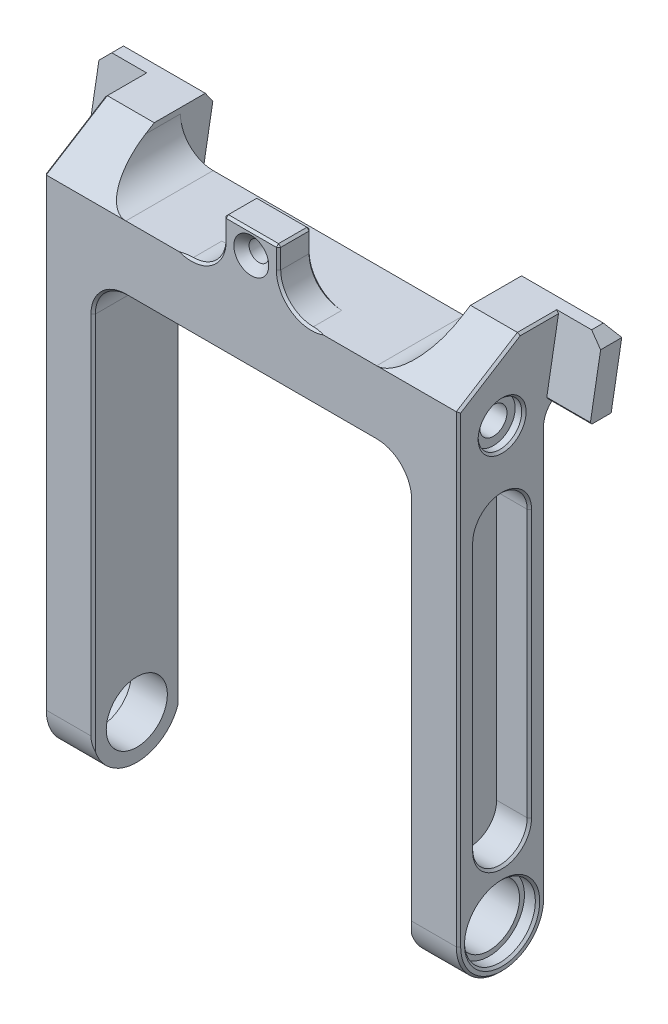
ISO-10303-21;
HEADER;
FILE_DESCRIPTION(('STEP AP214'),'2;1');
FILE_NAME('part.step','',(''),(''),'','','');
FILE_SCHEMA(('AUTOMOTIVE_DESIGN { 1 0 10303 214 1 1 1 1 }'));
ENDSEC;
DATA;
#1=APPLICATION_CONTEXT('core data for automotive mechanical design processes');
#2=APPLICATION_PROTOCOL_DEFINITION('international standard','automotive_design',2000,#1);
#3=PRODUCT_CONTEXT('',#1,'mechanical');
#4=PRODUCT('Part','Part','',(#3));
#5=PRODUCT_RELATED_PRODUCT_CATEGORY('part','',(#4));
#6=PRODUCT_DEFINITION_FORMATION('','',#4);
#7=PRODUCT_DEFINITION_CONTEXT('part definition',#1,'design');
#8=PRODUCT_DEFINITION('design','',#6,#7);
#9=PRODUCT_DEFINITION_SHAPE('','',#8);
#10=(LENGTH_UNIT() NAMED_UNIT(*) SI_UNIT(.MILLI.,.METRE.));
#11=(NAMED_UNIT(*) PLANE_ANGLE_UNIT() SI_UNIT($,.RADIAN.));
#12=(NAMED_UNIT(*) SI_UNIT($,.STERADIAN.) SOLID_ANGLE_UNIT());
#13=UNCERTAINTY_MEASURE_WITH_UNIT(LENGTH_MEASURE(1.E-05),#10,'distance_accuracy_value','');
#14=(GEOMETRIC_REPRESENTATION_CONTEXT(3) GLOBAL_UNCERTAINTY_ASSIGNED_CONTEXT((#13)) GLOBAL_UNIT_ASSIGNED_CONTEXT((#10,
#11,#12)) REPRESENTATION_CONTEXT('',''));
#15=CARTESIAN_POINT('',(0.,0.,0.));
#16=DIRECTION('',(0.,0.,1.));
#17=DIRECTION('',(1.,0.,0.));
#18=AXIS2_PLACEMENT_3D('',#15,#16,#17);
#19=CARTESIAN_POINT('',(-16.,35.5,4.));
#20=DIRECTION('',(-1.,0.,0.));
#21=DIRECTION('',(0.,0.,1.));
#22=AXIS2_PLACEMENT_3D('',#19,#20,#21);
#23=PLANE('',#22);
#24=CARTESIAN_POINT('',(-16.,11.,4.));
#25=DIRECTION('',(-1.,0.,0.));
#26=DIRECTION('',(0.,0.,1.));
#27=AXIS2_PLACEMENT_3D('',#24,#25,#26);
#28=CIRCLE('',#27,2.5);
#29=CARTESIAN_POINT('',(-16.,11.,1.5));
#30=VERTEX_POINT('',#29);
#31=CARTESIAN_POINT('',(-16.,11.,6.50000000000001));
#32=VERTEX_POINT('',#31);
#33=EDGE_CURVE('E594',#30,#32,#28,.T.);
#34=ORIENTED_EDGE('',*,*,#33,.T.);
#35=DIRECTION('',(0.,-1.,0.));
#36=VECTOR('',#35,1.);
#37=CARTESIAN_POINT('',(-16.,35.5,6.5));
#38=LINE('',#37,#36);
#39=CARTESIAN_POINT('',(-16.,35.5,6.5));
#40=VERTEX_POINT('',#39);
#41=EDGE_CURVE('E573',#32,#40,#38,.F.);
#42=ORIENTED_EDGE('',*,*,#41,.T.);
#43=CARTESIAN_POINT('',(-16.,35.5,4.));
#44=DIRECTION('',(-1.,0.,0.));
#45=DIRECTION('',(0.,0.,1.));
#46=AXIS2_PLACEMENT_3D('',#43,#44,#45);
#47=CIRCLE('',#46,2.5);
#48=CARTESIAN_POINT('',(-16.,35.5,1.5));
#49=VERTEX_POINT('',#48);
#50=EDGE_CURVE('E685',#40,#49,#47,.T.);
#51=ORIENTED_EDGE('',*,*,#50,.T.);
#52=DIRECTION('',(0.,1.,0.));
#53=VECTOR('',#52,1.);
#54=CARTESIAN_POINT('',(-16.,35.5,1.5));
#55=LINE('',#54,#53);
#56=EDGE_CURVE('E600',#49,#30,#55,.F.);
#57=ORIENTED_EDGE('',*,*,#56,.T.);
#58=EDGE_LOOP('',(#34,#42,#51,#57));
#59=FACE_BOUND('',#58,.T.);
#60=ADVANCED_FACE('F17',(#59),#23,.T.);
#61=CARTESIAN_POINT('',(-23.,49.,-2.));
#62=DIRECTION('',(0.707106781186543,-0.707106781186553,0.));
#63=DIRECTION('',(0.707106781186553,0.707106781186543,0.));
#64=AXIS2_PLACEMENT_3D('',#61,#62,#63);
#65=PLANE('',#64);
#66=DIRECTION('',(0.,0.,1.));
#67=VECTOR('',#66,1.);
#68=CARTESIAN_POINT('',(-22.,50.,-2.));
#69=LINE('',#68,#67);
#70=CARTESIAN_POINT('',(-22.,50.,-2.28290738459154));
#71=VERTEX_POINT('',#70);
#72=CARTESIAN_POINT('',(-22.,50.,-1.20783182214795));
#73=VERTEX_POINT('',#72);
#74=EDGE_CURVE('E676',#71,#73,#69,.T.);
#75=ORIENTED_EDGE('',*,*,#74,.F.);
#76=DIRECTION('',(0.633687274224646,0.633687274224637,0.443712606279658));
#77=VECTOR('',#76,1.);
#78=CARTESIAN_POINT('',(-22.9848077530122,49.0151922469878,-2.97247719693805));
#79=LINE('',#78,#77);
#80=CARTESIAN_POINT('',(-22.9848077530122,49.0151922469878,-2.97247719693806));
#81=VERTEX_POINT('',#80);
#82=EDGE_CURVE('E672',#81,#71,#79,.T.);
#83=ORIENTED_EDGE('',*,*,#82,.F.);
#84=DIRECTION('',(0.701673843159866,0.701673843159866,-0.123724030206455));
#85=VECTOR('',#84,1.);
#86=CARTESIAN_POINT('',(-23.,49.,-2.96979839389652));
#87=LINE('',#86,#85);
#88=CARTESIAN_POINT('',(-23.,49.,-2.96979839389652));
#89=VERTEX_POINT('',#88);
#90=EDGE_CURVE('E669',#89,#81,#87,.T.);
#91=ORIENTED_EDGE('',*,*,#90,.F.);
#92=DIRECTION('',(0.,0.,-1.));
#93=VECTOR('',#92,1.);
#94=CARTESIAN_POINT('',(-23.,49.,-2.));
#95=LINE('',#94,#93);
#96=CARTESIAN_POINT('',(-23.,49.,-1.03150484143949));
#97=VERTEX_POINT('',#96);
#98=EDGE_CURVE('E660',#89,#97,#95,.F.);
#99=ORIENTED_EDGE('',*,*,#98,.T.);
#100=DIRECTION('',(-0.701673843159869,-0.701673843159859,0.123724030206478));
#101=VECTOR('',#100,1.);
#102=CARTESIAN_POINT('',(-22.,50.,-1.20783182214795));
#103=LINE('',#102,#101);
#104=EDGE_CURVE('E293',#73,#97,#103,.T.);
#105=ORIENTED_EDGE('',*,*,#104,.F.);
#106=EDGE_LOOP('',(#75,#83,#91,#99,#105));
#107=FACE_BOUND('',#106,.T.);
#108=ADVANCED_FACE('F1835',(#107),#65,.F.);
#109=CARTESIAN_POINT('',(-14.5,43.5,-2.));
#110=DIRECTION('',(0.,1.,0.));
#111=DIRECTION('',(0.,0.,1.));
#112=AXIS2_PLACEMENT_3D('',#109,#110,#111);
#113=PLANE('',#112);
#114=CARTESIAN_POINT('',(-18.9999999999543,43.4999999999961,-1.08348486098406));
#115=CARTESIAN_POINT('',(-18.9696328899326,43.4999999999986,-1.15636486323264));
#116=CARTESIAN_POINT('',(-18.9417828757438,43.4999999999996,-1.23040832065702));
#117=CARTESIAN_POINT('',(-18.8927651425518,43.5000000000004,-1.37984439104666));
#118=CARTESIAN_POINT('',(-18.8715340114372,43.5000000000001,-1.45521639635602));
#119=CARTESIAN_POINT('',(-18.8367176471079,43.4999999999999,-1.60791027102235));
#120=CARTESIAN_POINT('',(-18.823145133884,43.5,-1.68523516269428));
#121=CARTESIAN_POINT('',(-18.8093608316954,43.5,-1.80236292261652));
#122=CARTESIAN_POINT('',(-18.8058610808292,43.5,-1.84179708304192));
#123=CARTESIAN_POINT('',(-18.801176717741,43.5,-1.92081731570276));
#124=CARTESIAN_POINT('',(-18.7999929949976,43.5,-1.96040344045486));
#125=CARTESIAN_POINT('',(-18.7999999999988,43.5,-2.));
#126=B_SPLINE_CURVE_WITH_KNOTS('',3,(#114,#115,#116,#117,#118,#119,#120,#121,#122,#123,#124,
#125),.UNSPECIFIED.,.F.,.F.,(4,2,2,2,2,4),(0.,0.236967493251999,0.471589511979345,
0.706600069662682,0.825307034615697,0.944059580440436),.UNSPECIFIED.);
#127=CARTESIAN_POINT('',(-18.999999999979,43.5,-1.08348486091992));
#128=VERTEX_POINT('',#127);
#129=CARTESIAN_POINT('',(-18.7999999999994,43.5,-2.));
#130=VERTEX_POINT('',#129);
#131=EDGE_CURVE('E20',#128,#130,#126,.T.);
#132=ORIENTED_EDGE('',*,*,#131,.F.);
#133=DIRECTION('',(0.,0.,1.));
#134=VECTOR('',#133,1.);
#135=CARTESIAN_POINT('',(-19.,43.5,-2.));
#136=LINE('',#135,#134);
#137=CARTESIAN_POINT('',(-19.,43.5,-0.23435004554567));
#138=VERTEX_POINT('',#137);
#139=EDGE_CURVE('E500',#138,#128,#136,.F.);
#140=ORIENTED_EDGE('',*,*,#139,.F.);
#141=DIRECTION('',(1.,0.,0.));
#142=VECTOR('',#141,1.);
#143=CARTESIAN_POINT('',(-14.5,43.5,-0.23435004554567));
#144=LINE('',#143,#142);
#145=CARTESIAN_POINT('',(-23.,43.5,-0.23435004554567));
#146=VERTEX_POINT('',#145);
#147=EDGE_CURVE('E503',#138,#146,#144,.F.);
#148=ORIENTED_EDGE('',*,*,#147,.T.);
#149=DIRECTION('',(0.,0.,-1.));
#150=VECTOR('',#149,1.);
#151=CARTESIAN_POINT('',(-23.,43.5,-2.));
#152=LINE('',#151,#150);
#153=CARTESIAN_POINT('',(-23.,43.5,-2.));
#154=VERTEX_POINT('',#153);
#155=EDGE_CURVE('E525',#146,#154,#152,.T.);
#156=ORIENTED_EDGE('',*,*,#155,.T.);
#157=DIRECTION('',(1.,0.,0.));
#158=VECTOR('',#157,1.);
#159=CARTESIAN_POINT('',(-6.26853707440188,43.5,-2.));
#160=LINE('',#159,#158);
#161=EDGE_CURVE('E610',#130,#154,#160,.F.);
#162=ORIENTED_EDGE('',*,*,#161,.F.);
#163=EDGE_LOOP('',(#132,#140,#148,#156,#162));
#164=FACE_BOUND('',#163,.T.);
#165=ADVANCED_FACE('F502',(#164),#113,.F.);
#166=CARTESIAN_POINT('',(-18.2,43.5,4.));
#167=DIRECTION('',(-1.,0.,0.));
#168=DIRECTION('',(0.,0.,1.));
#169=AXIS2_PLACEMENT_3D('',#166,#167,#168);
#170=PLANE('',#169);
#171=CARTESIAN_POINT('',(-18.2,43.5,4.));
#172=DIRECTION('',(-1.,0.,0.));
#173=DIRECTION('',(0.,0.,1.));
#174=AXIS2_PLACEMENT_3D('',#171,#172,#173);
#175=CIRCLE('',#174,1.24999999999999);
#176=CARTESIAN_POINT('',(-18.2,43.5,5.24999999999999));
#177=VERTEX_POINT('',#176);
#178=EDGE_CURVE('E1596',#177,#177,#175,.F.);
#179=ORIENTED_EDGE('',*,*,#178,.T.);
#180=EDGE_LOOP('',(#179));
#181=FACE_BOUND('',#180,.T.);
#182=CARTESIAN_POINT('',(-18.2,43.5,4.));
#183=DIRECTION('',(-1.,0.,0.));
#184=DIRECTION('',(0.,0.,1.));
#185=AXIS2_PLACEMENT_3D('',#182,#183,#184);
#186=CIRCLE('',#185,2.);
#187=CARTESIAN_POINT('',(-18.2,43.5,6.));
#188=VERTEX_POINT('',#187);
#189=EDGE_CURVE('E516',#188,#188,#186,.T.);
#190=ORIENTED_EDGE('',*,*,#189,.T.);
#191=EDGE_LOOP('',(#190));
#192=FACE_BOUND('',#191,.T.);
#193=ADVANCED_FACE('F1828',(#181,#192),#170,.T.);
#194=CARTESIAN_POINT('',(14.5,43.5,-2.));
#195=DIRECTION('',(0.,1.,0.));
#196=DIRECTION('',(-1.,0.,0.));
#197=AXIS2_PLACEMENT_3D('',#194,#195,#196);
#198=PLANE('',#197);
#199=DIRECTION('',(1.,0.,0.));
#200=VECTOR('',#199,1.);
#201=CARTESIAN_POINT('',(14.5,43.5,-0.234350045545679));
#202=LINE('',#201,#200);
#203=CARTESIAN_POINT('',(23.,43.5,-0.234350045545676));
#204=VERTEX_POINT('',#203);
#205=CARTESIAN_POINT('',(19.,43.5,-0.234350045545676));
#206=VERTEX_POINT('',#205);
#207=EDGE_CURVE('E606',#204,#206,#202,.F.);
#208=ORIENTED_EDGE('',*,*,#207,.T.);
#209=DIRECTION('',(0.,0.,1.));
#210=VECTOR('',#209,1.);
#211=CARTESIAN_POINT('',(19.,43.5,-2.));
#212=LINE('',#211,#210);
#213=CARTESIAN_POINT('',(18.999999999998,43.5,-1.08348486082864));
#214=VERTEX_POINT('',#213);
#215=EDGE_CURVE('E627',#214,#206,#212,.T.);
#216=ORIENTED_EDGE('',*,*,#215,.F.);
#217=CARTESIAN_POINT('',(18.7999999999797,43.5,-2.));
#218=CARTESIAN_POINT('',(18.7999487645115,43.5,-1.93862101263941));
#219=CARTESIAN_POINT('',(18.8028243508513,43.5,-1.87727276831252));
#220=CARTESIAN_POINT('',(18.8140277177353,43.5,-1.75516673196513));
#221=CARTESIAN_POINT('',(18.822347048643,43.5,-1.69440817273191));
#222=CARTESIAN_POINT('',(18.8438945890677,43.5,-1.57461907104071));
#223=CARTESIAN_POINT('',(18.8570560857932,43.5,-1.51557629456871));
#224=CARTESIAN_POINT('',(18.8876944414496,43.5,-1.3986258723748));
#225=CARTESIAN_POINT('',(18.9051716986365,43.5,-1.34071833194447));
#226=CARTESIAN_POINT('',(18.935853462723,43.5,-1.24974811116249));
#227=CARTESIAN_POINT('',(18.947855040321,43.5,-1.21627122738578));
#228=CARTESIAN_POINT('',(18.9730614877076,43.5,-1.14961750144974));
#229=CARTESIAN_POINT('',(18.9862710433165,43.5,-1.11644242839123));
#230=CARTESIAN_POINT('',(18.9999999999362,43.5,-1.08348486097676));
#231=B_SPLINE_CURVE_WITH_KNOTS('',3,(#217,#218,#219,#220,#221,#222,#223,#224,#225,#226,#227,
#228,#229,#230),.UNSPECIFIED.,.F.,.F.,(4,2,2,2,2,2,4),(0.,0.184020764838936,0.3677565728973,
0.549050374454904,0.730360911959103,0.8370316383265,0.944135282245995),.UNSPECIFIED.);
#232=CARTESIAN_POINT('',(18.7999999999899,43.5,-2.));
#233=VERTEX_POINT('',#232);
#234=EDGE_CURVE('E630',#233,#214,#231,.T.);
#235=ORIENTED_EDGE('',*,*,#234,.F.);
#236=DIRECTION('',(1.,0.,0.));
#237=VECTOR('',#236,1.);
#238=CARTESIAN_POINT('',(6.37658710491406,43.5,-2.));
#239=LINE('',#238,#237);
#240=CARTESIAN_POINT('',(23.,43.5,-2.));
#241=VERTEX_POINT('',#240);
#242=EDGE_CURVE('E603',#241,#233,#239,.F.);
#243=ORIENTED_EDGE('',*,*,#242,.F.);
#244=DIRECTION('',(0.,0.,1.));
#245=VECTOR('',#244,1.);
#246=CARTESIAN_POINT('',(23.,43.5,-2.));
#247=LINE('',#246,#245);
#248=EDGE_CURVE('E633',#241,#204,#247,.T.);
#249=ORIENTED_EDGE('',*,*,#248,.T.);
#250=EDGE_LOOP('',(#208,#216,#235,#243,#249));
#251=FACE_BOUND('',#250,.T.);
#252=ADVANCED_FACE('F1822',(#251),#198,.F.);
#253=CARTESIAN_POINT('',(22.,50.,-3.41061584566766));
#254=DIRECTION('',(-0.707106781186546,-0.707106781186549,0.));
#255=DIRECTION('',(0.707106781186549,-0.707106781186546,0.));
#256=AXIS2_PLACEMENT_3D('',#253,#254,#255);
#257=PLANE('',#256);
#258=DIRECTION('',(0.,0.,1.));
#259=VECTOR('',#258,1.);
#260=CARTESIAN_POINT('',(23.,49.,-2.));
#261=LINE('',#260,#259);
#262=CARTESIAN_POINT('',(23.,49.,-1.03150484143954));
#263=VERTEX_POINT('',#262);
#264=CARTESIAN_POINT('',(23.,49.,-2.96979839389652));
#265=VERTEX_POINT('',#264);
#266=EDGE_CURVE('E644',#263,#265,#261,.F.);
#267=ORIENTED_EDGE('',*,*,#266,.T.);
#268=DIRECTION('',(0.701673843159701,-0.701673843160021,0.123724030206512));
#269=VECTOR('',#268,1.);
#270=CARTESIAN_POINT('',(22.9848077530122,49.0151922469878,-2.97247719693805));
#271=LINE('',#270,#269);
#272=CARTESIAN_POINT('',(22.9848077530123,49.0151922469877,-2.97247719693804));
#273=VERTEX_POINT('',#272);
#274=EDGE_CURVE('E607',#273,#265,#271,.T.);
#275=ORIENTED_EDGE('',*,*,#274,.F.);
#276=DIRECTION('',(0.633687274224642,-0.63368727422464,-0.443712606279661));
#277=VECTOR('',#276,1.);
#278=CARTESIAN_POINT('',(22.,50.,-2.28290738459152));
#279=LINE('',#278,#277);
#280=CARTESIAN_POINT('',(22.,50.,-2.28290738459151));
#281=VERTEX_POINT('',#280);
#282=EDGE_CURVE('E647',#281,#273,#279,.T.);
#283=ORIENTED_EDGE('',*,*,#282,.F.);
#284=DIRECTION('',(0.,0.,1.));
#285=VECTOR('',#284,1.);
#286=CARTESIAN_POINT('',(22.,50.,-3.41061584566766));
#287=LINE('',#286,#285);
#288=CARTESIAN_POINT('',(22.,50.,-1.207831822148));
#289=VERTEX_POINT('',#288);
#290=EDGE_CURVE('E629',#289,#281,#287,.F.);
#291=ORIENTED_EDGE('',*,*,#290,.F.);
#292=DIRECTION('',(-0.701673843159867,0.70167384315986,-0.123724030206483));
#293=VECTOR('',#292,1.);
#294=CARTESIAN_POINT('',(23.,49.,-1.03150484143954));
#295=LINE('',#294,#293);
#296=EDGE_CURVE('E649',#263,#289,#295,.T.);
#297=ORIENTED_EDGE('',*,*,#296,.F.);
#298=EDGE_LOOP('',(#267,#275,#283,#291,#297));
#299=FACE_BOUND('',#298,.T.);
#300=ADVANCED_FACE('F1827',(#299),#257,.F.);
#301=CARTESIAN_POINT('',(18.2,43.5,4.));
#302=DIRECTION('',(1.,0.,0.));
#303=DIRECTION('',(0.,0.,-1.));
#304=AXIS2_PLACEMENT_3D('',#301,#302,#303);
#305=PLANE('',#304);
#306=CARTESIAN_POINT('',(18.2,43.5,4.));
#307=DIRECTION('',(1.,0.,0.));
#308=DIRECTION('',(0.,0.,-1.));
#309=AXIS2_PLACEMENT_3D('',#306,#307,#308);
#310=CIRCLE('',#309,1.24999999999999);
#311=CARTESIAN_POINT('',(18.2,43.5,2.75000000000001));
#312=VERTEX_POINT('',#311);
#313=EDGE_CURVE('E613',#312,#312,#310,.F.);
#314=ORIENTED_EDGE('',*,*,#313,.T.);
#315=EDGE_LOOP('',(#314));
#316=FACE_BOUND('',#315,.T.);
#317=CARTESIAN_POINT('',(18.2,43.5,4.));
#318=DIRECTION('',(1.,0.,0.));
#319=DIRECTION('',(0.,0.,-1.));
#320=AXIS2_PLACEMENT_3D('',#317,#318,#319);
#321=CIRCLE('',#320,2.);
#322=CARTESIAN_POINT('',(18.2,43.5,2.));
#323=VERTEX_POINT('',#322);
#324=EDGE_CURVE('E643',#323,#323,#321,.T.);
#325=ORIENTED_EDGE('',*,*,#324,.T.);
#326=EDGE_LOOP('',(#325));
#327=FACE_BOUND('',#326,.T.);
#328=ADVANCED_FACE('F2442',(#316,#327),#305,.T.);
#329=CARTESIAN_POINT('',(16.,35.5,4.));
#330=DIRECTION('',(1.,0.,0.));
#331=DIRECTION('',(0.,0.,-1.));
#332=AXIS2_PLACEMENT_3D('',#329,#330,#331);
#333=PLANE('',#332);
#334=CARTESIAN_POINT('',(16.,11.,4.));
#335=DIRECTION('',(1.,0.,0.));
#336=DIRECTION('',(0.,0.,-1.));
#337=AXIS2_PLACEMENT_3D('',#334,#335,#336);
#338=CIRCLE('',#337,2.5);
#339=CARTESIAN_POINT('',(16.,11.,6.50000000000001));
#340=VERTEX_POINT('',#339);
#341=CARTESIAN_POINT('',(16.,11.,1.5));
#342=VERTEX_POINT('',#341);
#343=EDGE_CURVE('E625',#340,#342,#338,.T.);
#344=ORIENTED_EDGE('',*,*,#343,.T.);
#345=DIRECTION('',(0.,-1.,0.));
#346=VECTOR('',#345,1.);
#347=CARTESIAN_POINT('',(16.,35.5,1.5));
#348=LINE('',#347,#346);
#349=CARTESIAN_POINT('',(16.,35.5,1.5));
#350=VERTEX_POINT('',#349);
#351=EDGE_CURVE('E617',#350,#342,#348,.T.);
#352=ORIENTED_EDGE('',*,*,#351,.F.);
#353=CARTESIAN_POINT('',(16.,35.5,4.));
#354=DIRECTION('',(1.,0.,0.));
#355=DIRECTION('',(0.,0.,-1.));
#356=AXIS2_PLACEMENT_3D('',#353,#354,#355);
#357=CIRCLE('',#356,2.5);
#358=CARTESIAN_POINT('',(16.,35.5,6.5));
#359=VERTEX_POINT('',#358);
#360=EDGE_CURVE('E1571',#350,#359,#357,.T.);
#361=ORIENTED_EDGE('',*,*,#360,.T.);
#362=DIRECTION('',(0.,1.,0.));
#363=VECTOR('',#362,1.);
#364=CARTESIAN_POINT('',(16.,35.5,6.5));
#365=LINE('',#364,#363);
#366=EDGE_CURVE('E622',#340,#359,#365,.T.);
#367=ORIENTED_EDGE('',*,*,#366,.F.);
#368=EDGE_LOOP('',(#344,#352,#361,#367));
#369=FACE_BOUND('',#368,.T.);
#370=ADVANCED_FACE('F2446',(#369),#333,.T.);
#371=CARTESIAN_POINT('',(-16.,35.5,4.));
#372=DIRECTION('',(-1.,0.,0.));
#373=DIRECTION('',(0.,0.,1.));
#374=AXIS2_PLACEMENT_3D('',#371,#372,#373);
#375=CYLINDRICAL_SURFACE('',#374,2.5);
#376=CARTESIAN_POINT('',(-18.7999999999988,35.5,4.));
#377=DIRECTION('',(-1.,0.,0.));
#378=DIRECTION('',(0.,0.,1.));
#379=AXIS2_PLACEMENT_3D('',#376,#377,#378);
#380=CIRCLE('',#379,2.50000000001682);
#381=CARTESIAN_POINT('',(-18.7999999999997,35.5,6.50000000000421));
#382=VERTEX_POINT('',#381);
#383=CARTESIAN_POINT('',(-18.7999999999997,35.5,1.4999999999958));
#384=VERTEX_POINT('',#383);
#385=EDGE_CURVE('E556',#382,#384,#380,.T.);
#386=ORIENTED_EDGE('',*,*,#385,.T.);
#387=DIRECTION('',(1.,0.,0.));
#388=VECTOR('',#387,1.);
#389=CARTESIAN_POINT('',(-16.,35.5,1.5));
#390=LINE('',#389,#388);
#391=EDGE_CURVE('E597',#384,#49,#390,.T.);
#392=ORIENTED_EDGE('',*,*,#391,.T.);
#393=ORIENTED_EDGE('',*,*,#50,.F.);
#394=DIRECTION('',(1.,0.,0.));
#395=VECTOR('',#394,1.);
#396=CARTESIAN_POINT('',(-16.,35.5,6.5));
#397=LINE('',#396,#395);
#398=EDGE_CURVE('E569',#40,#382,#397,.F.);
#399=ORIENTED_EDGE('',*,*,#398,.T.);
#400=EDGE_LOOP('',(#386,#392,#393,#399));
#401=FACE_BOUND('',#400,.T.);
#402=ADVANCED_FACE('F2451',(#401),#375,.F.);
#403=CARTESIAN_POINT('',(-16.,35.5,1.5));
#404=DIRECTION('',(0.,0.,-1.));
#405=DIRECTION('',(0.,1.,0.));
#406=AXIS2_PLACEMENT_3D('',#403,#404,#405);
#407=PLANE('',#406);
#408=DIRECTION('',(0.,1.,0.));
#409=VECTOR('',#408,1.);
#410=CARTESIAN_POINT('',(-18.8,35.5,1.5));
#411=LINE('',#410,#409);
#412=CARTESIAN_POINT('',(-18.7999999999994,11.,1.49999999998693));
#413=VERTEX_POINT('',#412);
#414=EDGE_CURVE('E559',#384,#413,#411,.F.);
#415=ORIENTED_EDGE('',*,*,#414,.T.);
#416=DIRECTION('',(-1.,0.,0.));
#417=VECTOR('',#416,1.);
#418=CARTESIAN_POINT('',(-16.,11.,1.5));
#419=LINE('',#418,#417);
#420=EDGE_CURVE('E591',#413,#30,#419,.F.);
#421=ORIENTED_EDGE('',*,*,#420,.T.);
#422=ORIENTED_EDGE('',*,*,#56,.F.);
#423=ORIENTED_EDGE('',*,*,#391,.F.);
#424=EDGE_LOOP('',(#415,#421,#422,#423));
#425=FACE_BOUND('',#424,.T.);
#426=ADVANCED_FACE('F2459',(#425),#407,.F.);
#427=CARTESIAN_POINT('',(-16.,11.,4.));
#428=DIRECTION('',(-1.,0.,0.));
#429=DIRECTION('',(0.,0.,1.));
#430=AXIS2_PLACEMENT_3D('',#427,#428,#429);
#431=CYLINDRICAL_SURFACE('',#430,2.5);
#432=CARTESIAN_POINT('',(-18.7999999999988,11.,4.));
#433=DIRECTION('',(-1.,0.,0.));
#434=DIRECTION('',(0.,0.,1.));
#435=AXIS2_PLACEMENT_3D('',#432,#433,#434);
#436=CIRCLE('',#435,2.50000000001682);
#437=CARTESIAN_POINT('',(-18.7999999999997,11.,6.50000000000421));
#438=VERTEX_POINT('',#437);
#439=EDGE_CURVE('E580',#413,#438,#436,.T.);
#440=ORIENTED_EDGE('',*,*,#439,.T.);
#441=DIRECTION('',(1.,0.,0.));
#442=VECTOR('',#441,1.);
#443=CARTESIAN_POINT('',(-16.,11.,6.50000000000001));
#444=LINE('',#443,#442);
#445=EDGE_CURVE('E572',#438,#32,#444,.T.);
#446=ORIENTED_EDGE('',*,*,#445,.T.);
#447=ORIENTED_EDGE('',*,*,#33,.F.);
#448=ORIENTED_EDGE('',*,*,#420,.F.);
#449=EDGE_LOOP('',(#440,#446,#447,#448));
#450=FACE_BOUND('',#449,.T.);
#451=ADVANCED_FACE('F2463',(#450),#431,.F.);
#452=CARTESIAN_POINT('',(-16.,35.5,6.5));
#453=DIRECTION('',(0.,0.,1.));
#454=DIRECTION('',(0.,-1.,0.));
#455=AXIS2_PLACEMENT_3D('',#452,#453,#454);
#456=PLANE('',#455);
#457=DIRECTION('',(0.,1.,0.));
#458=VECTOR('',#457,1.);
#459=CARTESIAN_POINT('',(-18.8,35.5,6.50000000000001));
#460=LINE('',#459,#458);
#461=EDGE_CURVE('E563',#438,#382,#460,.T.);
#462=ORIENTED_EDGE('',*,*,#461,.T.);
#463=ORIENTED_EDGE('',*,*,#398,.F.);
#464=ORIENTED_EDGE('',*,*,#41,.F.);
#465=ORIENTED_EDGE('',*,*,#445,.F.);
#466=EDGE_LOOP('',(#462,#463,#464,#465));
#467=FACE_BOUND('',#466,.T.);
#468=ADVANCED_FACE('F2467',(#467),#456,.F.);
#469=CARTESIAN_POINT('',(-18.2,43.5,4.));
#470=DIRECTION('',(-1.,0.,0.));
#471=DIRECTION('',(0.,0.,1.));
#472=AXIS2_PLACEMENT_3D('',#469,#470,#471);
#473=CYLINDRICAL_SURFACE('',#472,2.);
#474=CARTESIAN_POINT('',(-18.7999999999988,43.5,4.));
#475=DIRECTION('',(-1.,0.,0.));
#476=DIRECTION('',(0.,0.,1.));
#477=AXIS2_PLACEMENT_3D('',#474,#475,#476);
#478=CIRCLE('',#477,1.99999999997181);
#479=CARTESIAN_POINT('',(-18.7999999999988,43.5,5.99999999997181));
#480=VERTEX_POINT('',#479);
#481=EDGE_CURVE('E552',#480,#480,#478,.T.);
#482=ORIENTED_EDGE('',*,*,#481,.T.);
#483=EDGE_LOOP('',(#482));
#484=FACE_BOUND('',#483,.T.);
#485=ORIENTED_EDGE('',*,*,#189,.F.);
#486=EDGE_LOOP('',(#485));
#487=FACE_BOUND('',#486,.T.);
#488=ADVANCED_FACE('F2471',(#484,#487),#473,.F.);
#489=CARTESIAN_POINT('',(-18.,4.,4.));
#490=DIRECTION('',(-1.,0.,0.));
#491=DIRECTION('',(0.,0.,1.));
#492=AXIS2_PLACEMENT_3D('',#489,#490,#491);
#493=CYLINDRICAL_SURFACE('',#492,3.25);
#494=CARTESIAN_POINT('',(-18.8000000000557,4.,4.));
#495=DIRECTION('',(-1.,0.,0.));
#496=DIRECTION('',(0.,0.,1.));
#497=AXIS2_PLACEMENT_3D('',#494,#495,#496);
#498=CIRCLE('',#497,3.25000000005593);
#499=CARTESIAN_POINT('',(-18.8000000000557,4.,7.25000000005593));
#500=VERTEX_POINT('',#499);
#501=EDGE_CURVE('E549',#500,#500,#498,.T.);
#502=ORIENTED_EDGE('',*,*,#501,.T.);
#503=EDGE_LOOP('',(#502));
#504=FACE_BOUND('',#503,.T.);
#505=CARTESIAN_POINT('',(-17.8,4.,4.));
#506=DIRECTION('',(-1.,0.,0.));
#507=DIRECTION('',(0.,0.,1.));
#508=AXIS2_PLACEMENT_3D('',#505,#506,#507);
#509=CIRCLE('',#508,3.25);
#510=CARTESIAN_POINT('',(-17.8,4.,7.25));
#511=VERTEX_POINT('',#510);
#512=EDGE_CURVE('E865',#511,#511,#509,.T.);
#513=ORIENTED_EDGE('',*,*,#512,.F.);
#514=EDGE_LOOP('',(#513));
#515=FACE_BOUND('',#514,.T.);
#516=ADVANCED_FACE('F2475',(#504,#515),#493,.F.);
#517=CARTESIAN_POINT('',(-14.5,43.5,-0.23435004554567));
#518=DIRECTION('',(0.,0.573576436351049,-0.819152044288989));
#519=DIRECTION('',(0.,0.819152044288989,0.573576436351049));
#520=AXIS2_PLACEMENT_3D('',#517,#518,#519);
#521=PLANE('',#520);
#522=DIRECTION('',(1.,0.,0.));
#523=VECTOR('',#522,1.);
#524=CARTESIAN_POINT('',(-10.5212338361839,43.6969615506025,-0.0964360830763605));
#525=LINE('',#524,#523);
#526=CARTESIAN_POINT('',(-19.,43.6969615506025,-0.0964360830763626));
#527=VERTEX_POINT('',#526);
#528=CARTESIAN_POINT('',(-23.,43.6969615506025,-0.0964360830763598));
#529=VERTEX_POINT('',#528);
#530=EDGE_CURVE('E537',#527,#529,#525,.F.);
#531=ORIENTED_EDGE('',*,*,#530,.T.);
#532=DIRECTION('',(0.,-0.819152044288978,-0.573576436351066));
#533=VECTOR('',#532,1.);
#534=CARTESIAN_POINT('',(-23.,43.6969615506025,-0.0964360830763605));
#535=LINE('',#534,#533);
#536=EDGE_CURVE('E515',#529,#146,#535,.T.);
#537=ORIENTED_EDGE('',*,*,#536,.T.);
#538=ORIENTED_EDGE('',*,*,#147,.F.);
#539=DIRECTION('',(0.,0.819152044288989,0.573576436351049));
#540=VECTOR('',#539,1.);
#541=CARTESIAN_POINT('',(-19.,43.5,-0.23435004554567));
#542=LINE('',#541,#540);
#543=EDGE_CURVE('E513',#527,#138,#542,.F.);
#544=ORIENTED_EDGE('',*,*,#543,.F.);
#545=EDGE_LOOP('',(#531,#537,#538,#544));
#546=FACE_BOUND('',#545,.T.);
#547=ADVANCED_FACE('F512',(#546),#521,.F.);
#548=CARTESIAN_POINT('',(-23.,51.5,-2.));
#549=DIRECTION('',(1.,0.,0.));
#550=DIRECTION('',(0.,0.,-1.));
#551=AXIS2_PLACEMENT_3D('',#548,#549,#550);
#552=PLANE('',#551);
#553=ORIENTED_EDGE('',*,*,#98,.F.);
#554=DIRECTION('',(0.,0.984807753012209,-0.173648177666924));
#555=VECTOR('',#554,1.);
#556=CARTESIAN_POINT('',(-23.,43.5,-2.));
#557=LINE('',#556,#555);
#558=EDGE_CURVE('E614',#154,#89,#557,.T.);
#559=ORIENTED_EDGE('',*,*,#558,.F.);
#560=ORIENTED_EDGE('',*,*,#155,.F.);
#561=ORIENTED_EDGE('',*,*,#536,.F.);
#562=DIRECTION('',(0.,0.984807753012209,-0.173648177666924));
#563=VECTOR('',#562,1.);
#564=CARTESIAN_POINT('',(-23.,51.5,-1.47232229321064));
#565=LINE('',#564,#563);
#566=EDGE_CURVE('E533',#529,#97,#565,.T.);
#567=ORIENTED_EDGE('',*,*,#566,.T.);
#568=EDGE_LOOP('',(#553,#559,#560,#561,#567));
#569=FACE_BOUND('',#568,.T.);
#570=ADVANCED_FACE('F1846',(#569),#552,.F.);
#571=CARTESIAN_POINT('',(-6.26853707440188,43.5,-2.));
#572=DIRECTION('',(0.,-0.173648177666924,-0.984807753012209));
#573=DIRECTION('',(0.,0.984807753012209,-0.173648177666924));
#574=AXIS2_PLACEMENT_3D('',#571,#572,#573);
#575=PLANE('',#574);
#576=DIRECTION('',(-1.,0.,0.));
#577=VECTOR('',#576,1.);
#578=CARTESIAN_POINT('',(-14.5,43.5,-2.));
#579=LINE('',#578,#577);
#580=CARTESIAN_POINT('',(-14.5,43.5,-2.));
#581=VERTEX_POINT('',#580);
#582=EDGE_CURVE('E864',#581,#130,#579,.T.);
#583=ORIENTED_EDGE('',*,*,#582,.T.);
#584=ORIENTED_EDGE('',*,*,#161,.T.);
#585=ORIENTED_EDGE('',*,*,#558,.T.);
#586=ORIENTED_EDGE('',*,*,#90,.T.);
#587=DIRECTION('',(1.,0.,0.));
#588=VECTOR('',#587,1.);
#589=CARTESIAN_POINT('',(-23.,49.0151922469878,-2.97247719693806));
#590=LINE('',#589,#588);
#591=CARTESIAN_POINT('',(-14.5,49.0151922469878,-2.97247719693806));
#592=VERTEX_POINT('',#591);
#593=EDGE_CURVE('E545',#592,#81,#590,.F.);
#594=ORIENTED_EDGE('',*,*,#593,.F.);
#595=DIRECTION('',(0.,-0.984807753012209,0.173648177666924));
#596=VECTOR('',#595,1.);
#597=CARTESIAN_POINT('',(-14.5,49.0151922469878,-2.97247719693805));
#598=LINE('',#597,#596);
#599=EDGE_CURVE('E529',#592,#581,#598,.T.);
#600=ORIENTED_EDGE('',*,*,#599,.T.);
#601=EDGE_LOOP('',(#583,#584,#585,#586,#594,#600));
#602=FACE_BOUND('',#601,.T.);
#603=ADVANCED_FACE('F941',(#602),#575,.T.);
#604=CARTESIAN_POINT('',(19.,43.5,4.));
#605=DIRECTION('',(1.,0.,0.));
#606=DIRECTION('',(0.,0.,-1.));
#607=AXIS2_PLACEMENT_3D('',#604,#605,#606);
#608=CYLINDRICAL_SURFACE('',#607,1.24999999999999);
#609=ORIENTED_EDGE('',*,*,#313,.F.);
#610=EDGE_LOOP('',(#609));
#611=FACE_BOUND('',#610,.T.);
#612=CARTESIAN_POINT('',(14.5,43.5,2.75000000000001));
#613=CARTESIAN_POINT('',(14.4999923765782,43.4365344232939,2.7500085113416));
#614=CARTESIAN_POINT('',(14.4969449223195,43.3729626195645,2.75486992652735));
#615=CARTESIAN_POINT('',(14.4850301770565,43.2477295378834,2.774072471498));
#616=CARTESIAN_POINT('',(14.4761468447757,43.1860740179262,2.78843973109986));
#617=CARTESIAN_POINT('',(14.4534569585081,43.0667887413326,2.82581383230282));
#618=CARTESIAN_POINT('',(14.439676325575,43.0091396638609,2.84877521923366));
#619=CARTESIAN_POINT('',(14.4083419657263,42.8987269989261,2.90239291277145));
#620=CARTESIAN_POINT('',(14.3907895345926,42.845961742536,2.93304657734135));
#621=CARTESIAN_POINT('',(14.3517021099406,42.7420275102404,3.00388550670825));
#622=CARTESIAN_POINT('',(14.3299609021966,42.691323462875,3.04463689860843));
#623=CARTESIAN_POINT('',(14.2853148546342,42.5970161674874,3.13321634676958));
#624=CARTESIAN_POINT('',(14.2624084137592,42.5534230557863,3.18105432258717));
#625=CARTESIAN_POINT('',(14.2143040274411,42.4685709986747,3.29003425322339));
#626=CARTESIAN_POINT('',(14.1892158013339,42.4284274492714,3.35210054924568));
#627=CARTESIAN_POINT('',(14.1433017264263,42.359259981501,3.48356566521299));
#628=CARTESIAN_POINT('',(14.1224686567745,42.330217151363,3.5529517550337));
#629=CARTESIAN_POINT('',(14.0930957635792,42.2906660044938,3.67881049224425));
#630=CARTESIAN_POINT('',(14.0827690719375,42.2773044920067,3.73396675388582));
#631=CARTESIAN_POINT('',(14.0678135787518,42.258181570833,3.84630585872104));
#632=CARTESIAN_POINT('',(14.0631767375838,42.252409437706,3.90348572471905));
#633=CARTESIAN_POINT('',(14.0602988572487,42.24881081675,4.01841303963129));
#634=CARTESIAN_POINT('',(14.0620745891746,42.2510051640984,4.07616158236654));
#635=CARTESIAN_POINT('',(14.0717740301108,42.2632368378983,4.19031014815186));
#636=CARTESIAN_POINT('',(14.0797026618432,42.2732804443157,4.24670905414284));
#637=CARTESIAN_POINT('',(14.1003256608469,42.3003188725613,4.35543808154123));
#638=CARTESIAN_POINT('',(14.1129069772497,42.3171495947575,4.40783173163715));
#639=CARTESIAN_POINT('',(14.1414554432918,42.3570977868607,4.50916050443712));
#640=CARTESIAN_POINT('',(14.1574238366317,42.3802175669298,4.55809434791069));
#641=CARTESIAN_POINT('',(14.1945491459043,42.437052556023,4.66083600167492));
#642=CARTESIAN_POINT('',(14.2161180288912,42.4719403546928,4.71384600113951));
#643=CARTESIAN_POINT('',(14.2600593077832,42.5491227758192,4.81383488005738));
#644=CARTESIAN_POINT('',(14.2824324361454,42.5914242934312,4.86080807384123));
#645=CARTESIAN_POINT('',(14.3297916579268,42.6904645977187,4.95528717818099));
#646=CARTESIAN_POINT('',(14.3546011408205,42.7484337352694,5.0016064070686));
#647=CARTESIAN_POINT('',(14.4002684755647,42.8728153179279,5.08383019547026));
#648=CARTESIAN_POINT('',(14.4211256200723,42.9392292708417,5.11973289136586));
#649=CARTESIAN_POINT('',(14.4555564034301,43.0751994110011,5.17780171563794));
#650=CARTESIAN_POINT('',(14.4694579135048,43.1444016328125,5.20059587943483));
#651=CARTESIAN_POINT('',(14.4898662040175,43.2866054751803,5.23379262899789));
#652=CARTESIAN_POINT('',(14.4964030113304,43.3595903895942,5.24424554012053));
#653=CARTESIAN_POINT('',(14.4996272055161,43.4552430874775,5.24940227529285));
#654=CARTESIAN_POINT('',(14.5000026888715,43.4776149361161,5.25000300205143));
#655=CARTESIAN_POINT('',(14.4999923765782,43.5634655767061,5.2499914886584));
#656=CARTESIAN_POINT('',(14.4969449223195,43.6270373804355,5.24513007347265));
#657=CARTESIAN_POINT('',(14.4850301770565,43.7522704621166,5.22592752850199));
#658=CARTESIAN_POINT('',(14.4761468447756,43.8139259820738,5.21156026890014));
#659=CARTESIAN_POINT('',(14.4534569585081,43.9332112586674,5.17418616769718));
#660=CARTESIAN_POINT('',(14.439676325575,43.9908603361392,5.15122478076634));
#661=CARTESIAN_POINT('',(14.4083419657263,44.1012730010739,5.09760708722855));
#662=CARTESIAN_POINT('',(14.3907895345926,44.154038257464,5.06695342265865));
#663=CARTESIAN_POINT('',(14.3517021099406,44.2579724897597,4.99611449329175));
#664=CARTESIAN_POINT('',(14.3299609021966,44.308676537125,4.95536310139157));
#665=CARTESIAN_POINT('',(14.2853148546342,44.4029838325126,4.86678365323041));
#666=CARTESIAN_POINT('',(14.2624084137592,44.4465769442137,4.81894567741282));
#667=CARTESIAN_POINT('',(14.2143040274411,44.5314290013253,4.7099657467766));
#668=CARTESIAN_POINT('',(14.1892158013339,44.5715725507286,4.64789945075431));
#669=CARTESIAN_POINT('',(14.1433017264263,44.640740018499,4.516434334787));
#670=CARTESIAN_POINT('',(14.1224686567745,44.669782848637,4.44704824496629));
#671=CARTESIAN_POINT('',(14.0930957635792,44.7093339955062,4.32118950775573));
#672=CARTESIAN_POINT('',(14.0827690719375,44.7226955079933,4.26603324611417));
#673=CARTESIAN_POINT('',(14.0678135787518,44.741818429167,4.15369414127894));
#674=CARTESIAN_POINT('',(14.0631767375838,44.7475905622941,4.09651427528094));
#675=CARTESIAN_POINT('',(14.0602988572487,44.75118918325,3.9815869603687));
#676=CARTESIAN_POINT('',(14.0620745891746,44.7489948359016,3.92383841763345));
#677=CARTESIAN_POINT('',(14.0717740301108,44.7367631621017,3.80968985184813));
#678=CARTESIAN_POINT('',(14.0797026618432,44.7267195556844,3.75329094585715));
#679=CARTESIAN_POINT('',(14.1003256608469,44.6996811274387,3.64456191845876));
#680=CARTESIAN_POINT('',(14.1129069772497,44.6828504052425,3.59216826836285));
#681=CARTESIAN_POINT('',(14.1414554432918,44.6429022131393,3.49083949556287));
#682=CARTESIAN_POINT('',(14.1574238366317,44.6197824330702,3.4419056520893));
#683=CARTESIAN_POINT('',(14.1945491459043,44.562947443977,3.33916399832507));
#684=CARTESIAN_POINT('',(14.2161180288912,44.5280596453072,3.28615399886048));
#685=CARTESIAN_POINT('',(14.2600593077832,44.4508772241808,3.18616511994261));
#686=CARTESIAN_POINT('',(14.2824324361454,44.4085757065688,3.13919192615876));
#687=CARTESIAN_POINT('',(14.3297916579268,44.3095354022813,3.044712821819));
#688=CARTESIAN_POINT('',(14.3546011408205,44.2515662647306,2.99839359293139));
#689=CARTESIAN_POINT('',(14.4002684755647,44.127184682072,2.91616980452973));
#690=CARTESIAN_POINT('',(14.4211256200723,44.0607707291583,2.88026710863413));
#691=CARTESIAN_POINT('',(14.4555564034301,43.9248005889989,2.82219828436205));
#692=CARTESIAN_POINT('',(14.4694579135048,43.8555983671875,2.79940412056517));
#693=CARTESIAN_POINT('',(14.4898662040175,43.7133945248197,2.76620737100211));
#694=CARTESIAN_POINT('',(14.4964030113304,43.6404096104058,2.75575445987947));
#695=CARTESIAN_POINT('',(14.4996272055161,43.5447569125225,2.75059772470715));
#696=CARTESIAN_POINT('',(14.5000026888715,43.5223850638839,2.74999699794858));
#697=CARTESIAN_POINT('',(14.5,43.5,2.75000000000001));
#698=B_SPLINE_CURVE_WITH_KNOTS('',3,(#612,#613,#614,#615,#616,#617,#618,#619,#620,#621,#622,
#623,#624,#625,#626,#627,#628,#629,#630,#631,#632,#633,#634,#635,#636,#637,#638,#639,#640,#641,
#642,#643,#644,#645,#646,#647,#648,#649,#650,#651,#652,#653,#654,#655,#656,#657,#658,#659,#660,
#661,#662,#663,#664,#665,#666,#667,#668,#669,#670,#671,#672,#673,#674,#675,#676,#677,#678,#679,
#680,#681,#682,#683,#684,#685,#686,#687,#688,#689,#690,#691,#692,#693,#694,#695,#696,#697),
.UNSPECIFIED.,.T.,.F.,(4,2,2,2,2,2,2,2,2,2,2,2,2,2,2,2,2,2,2,2,2,2,2,2,2,2,2,2,2,2,2,2,2,2,2,2,
2,2,2,2,2,2,4),(0.,0.190331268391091,0.381187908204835,0.571049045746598,0.760845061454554,
0.965815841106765,1.17107629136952,1.4041311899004,1.6367872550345,1.80911999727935,
1.98120895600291,2.15374831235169,2.32642585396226,2.49515723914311,2.66395068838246,
2.86428430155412,3.06480523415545,3.29835493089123,3.53194638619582,3.75313754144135,
3.9734235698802,4.04055567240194,4.23088694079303,4.42174358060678,4.61160471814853,
4.8014007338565,5.00637151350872,5.21163196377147,5.44468686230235,5.67734292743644,
5.8496756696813,6.02176462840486,6.19430398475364,6.3669815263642,6.53571291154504,
6.7045063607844,6.90483997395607,7.1053609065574,7.33891060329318,7.57250205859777,
7.7936932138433,8.01397924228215,8.08111134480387),.UNSPECIFIED.);
#699=CARTESIAN_POINT('',(14.5,43.5,2.75000000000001));
#700=VERTEX_POINT('',#699);
#701=EDGE_CURVE('E944',#700,#700,#698,.T.);
#702=ORIENTED_EDGE('',*,*,#701,.T.);
#703=EDGE_LOOP('',(#702));
#704=FACE_BOUND('',#703,.T.);
#705=ADVANCED_FACE('F936',(#611,#704),#608,.F.);
#706=CARTESIAN_POINT('',(-19.,43.5,4.));
#707=DIRECTION('',(-1.,0.,0.));
#708=DIRECTION('',(0.,0.,1.));
#709=AXIS2_PLACEMENT_3D('',#706,#707,#708);
#710=CYLINDRICAL_SURFACE('',#709,1.24999999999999);
#711=CARTESIAN_POINT('',(-14.5,43.5,2.75000000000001));
#712=CARTESIAN_POINT('',(-14.4999923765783,43.5634655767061,2.7500085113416));
#713=CARTESIAN_POINT('',(-14.4969449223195,43.6270373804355,2.75486992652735));
#714=CARTESIAN_POINT('',(-14.4850301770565,43.7522704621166,2.77407247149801));
#715=CARTESIAN_POINT('',(-14.4761468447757,43.8139259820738,2.78843973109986));
#716=CARTESIAN_POINT('',(-14.4534569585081,43.9332112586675,2.82581383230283));
#717=CARTESIAN_POINT('',(-14.439676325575,43.9908603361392,2.84877521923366));
#718=CARTESIAN_POINT('',(-14.4083419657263,44.1012730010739,2.90239291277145));
#719=CARTESIAN_POINT('',(-14.3907895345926,44.154038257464,2.93304657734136));
#720=CARTESIAN_POINT('',(-14.3517021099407,44.2579724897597,3.00388550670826));
#721=CARTESIAN_POINT('',(-14.3299609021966,44.308676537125,3.04463689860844));
#722=CARTESIAN_POINT('',(-14.2853148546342,44.4029838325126,3.13321634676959));
#723=CARTESIAN_POINT('',(-14.2624084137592,44.4465769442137,3.18105432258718));
#724=CARTESIAN_POINT('',(-14.2143040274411,44.5314290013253,3.29003425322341));
#725=CARTESIAN_POINT('',(-14.1892158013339,44.5715725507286,3.35210054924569));
#726=CARTESIAN_POINT('',(-14.1433017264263,44.640740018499,3.48356566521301));
#727=CARTESIAN_POINT('',(-14.1224686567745,44.669782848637,3.55295175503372));
#728=CARTESIAN_POINT('',(-14.0930957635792,44.7093339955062,3.67881049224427));
#729=CARTESIAN_POINT('',(-14.0827690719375,44.7226955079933,3.73396675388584));
#730=CARTESIAN_POINT('',(-14.0678135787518,44.741818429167,3.84630585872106));
#731=CARTESIAN_POINT('',(-14.0631767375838,44.7475905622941,3.90348572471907));
#732=CARTESIAN_POINT('',(-14.0602988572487,44.75118918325,4.01841303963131));
#733=CARTESIAN_POINT('',(-14.0620745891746,44.7489948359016,4.07616158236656));
#734=CARTESIAN_POINT('',(-14.0717740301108,44.7367631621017,4.19031014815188));
#735=CARTESIAN_POINT('',(-14.0797026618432,44.7267195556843,4.24670905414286));
#736=CARTESIAN_POINT('',(-14.1003256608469,44.6996811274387,4.35543808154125));
#737=CARTESIAN_POINT('',(-14.1129069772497,44.6828504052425,4.40783173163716));
#738=CARTESIAN_POINT('',(-14.1414554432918,44.6429022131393,4.50916050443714));
#739=CARTESIAN_POINT('',(-14.1574238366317,44.6197824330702,4.55809434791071));
#740=CARTESIAN_POINT('',(-14.1945491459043,44.562947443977,4.66083600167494));
#741=CARTESIAN_POINT('',(-14.2161180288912,44.5280596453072,4.71384600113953));
#742=CARTESIAN_POINT('',(-14.2600593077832,44.4508772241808,4.81383488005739));
#743=CARTESIAN_POINT('',(-14.2824324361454,44.4085757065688,4.86080807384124));
#744=CARTESIAN_POINT('',(-14.3297916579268,44.3095354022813,4.95528717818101));
#745=CARTESIAN_POINT('',(-14.3546011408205,44.2515662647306,5.00160640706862));
#746=CARTESIAN_POINT('',(-14.4002684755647,44.127184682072,5.08383019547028));
#747=CARTESIAN_POINT('',(-14.4211256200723,44.0607707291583,5.11973289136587));
#748=CARTESIAN_POINT('',(-14.4555564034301,43.9248005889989,5.17780171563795));
#749=CARTESIAN_POINT('',(-14.4694579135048,43.8555983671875,5.20059587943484));
#750=CARTESIAN_POINT('',(-14.4898662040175,43.7133945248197,5.23379262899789));
#751=CARTESIAN_POINT('',(-14.4964030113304,43.6404096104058,5.24424554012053));
#752=CARTESIAN_POINT('',(-14.4996272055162,43.5447569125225,5.24940227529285));
#753=CARTESIAN_POINT('',(-14.5000026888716,43.5223850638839,5.25000300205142));
#754=CARTESIAN_POINT('',(-14.4999923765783,43.4365344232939,5.2499914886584));
#755=CARTESIAN_POINT('',(-14.4969449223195,43.3729626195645,5.24513007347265));
#756=CARTESIAN_POINT('',(-14.4850301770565,43.2477295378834,5.22592752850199));
#757=CARTESIAN_POINT('',(-14.4761468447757,43.1860740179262,5.21156026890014));
#758=CARTESIAN_POINT('',(-14.4534569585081,43.0667887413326,5.17418616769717));
#759=CARTESIAN_POINT('',(-14.439676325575,43.0091396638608,5.15122478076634));
#760=CARTESIAN_POINT('',(-14.4083419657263,42.8987269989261,5.09760708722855));
#761=CARTESIAN_POINT('',(-14.3907895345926,42.845961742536,5.06695342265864));
#762=CARTESIAN_POINT('',(-14.3517021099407,42.7420275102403,4.99611449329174));
#763=CARTESIAN_POINT('',(-14.3299609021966,42.691323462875,4.95536310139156));
#764=CARTESIAN_POINT('',(-14.2853148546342,42.5970161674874,4.86678365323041));
#765=CARTESIAN_POINT('',(-14.2624084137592,42.5534230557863,4.81894567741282));
#766=CARTESIAN_POINT('',(-14.2143040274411,42.4685709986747,4.70996574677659));
#767=CARTESIAN_POINT('',(-14.1892158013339,42.4284274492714,4.64789945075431));
#768=CARTESIAN_POINT('',(-14.1433017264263,42.359259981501,4.516434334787));
#769=CARTESIAN_POINT('',(-14.1224686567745,42.330217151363,4.44704824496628));
#770=CARTESIAN_POINT('',(-14.0930957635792,42.2906660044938,4.32118950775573));
#771=CARTESIAN_POINT('',(-14.0827690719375,42.2773044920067,4.26603324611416));
#772=CARTESIAN_POINT('',(-14.0678135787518,42.258181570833,4.15369414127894));
#773=CARTESIAN_POINT('',(-14.0631767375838,42.252409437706,4.09651427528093));
#774=CARTESIAN_POINT('',(-14.0602988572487,42.24881081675,3.98158696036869));
#775=CARTESIAN_POINT('',(-14.0620745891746,42.2510051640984,3.92383841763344));
#776=CARTESIAN_POINT('',(-14.0717740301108,42.2632368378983,3.80968985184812));
#777=CARTESIAN_POINT('',(-14.0797026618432,42.2732804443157,3.75329094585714));
#778=CARTESIAN_POINT('',(-14.1003256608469,42.3003188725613,3.64456191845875));
#779=CARTESIAN_POINT('',(-14.1129069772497,42.3171495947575,3.59216826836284));
#780=CARTESIAN_POINT('',(-14.1414554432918,42.3570977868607,3.49083949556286));
#781=CARTESIAN_POINT('',(-14.1574238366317,42.3802175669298,3.4419056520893));
#782=CARTESIAN_POINT('',(-14.1945491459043,42.437052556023,3.33916399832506));
#783=CARTESIAN_POINT('',(-14.2161180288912,42.4719403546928,3.28615399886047));
#784=CARTESIAN_POINT('',(-14.2600593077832,42.5491227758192,3.1861651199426));
#785=CARTESIAN_POINT('',(-14.2824324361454,42.5914242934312,3.13919192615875));
#786=CARTESIAN_POINT('',(-14.3297916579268,42.6904645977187,3.04471282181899));
#787=CARTESIAN_POINT('',(-14.3546011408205,42.7484337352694,2.99839359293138));
#788=CARTESIAN_POINT('',(-14.4002684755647,42.872815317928,2.91616980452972));
#789=CARTESIAN_POINT('',(-14.4211256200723,42.9392292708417,2.88026710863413));
#790=CARTESIAN_POINT('',(-14.4555564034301,43.0751994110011,2.82219828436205));
#791=CARTESIAN_POINT('',(-14.4694579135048,43.1444016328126,2.79940412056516));
#792=CARTESIAN_POINT('',(-14.4898662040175,43.2866054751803,2.76620737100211));
#793=CARTESIAN_POINT('',(-14.4964030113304,43.3595903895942,2.75575445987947));
#794=CARTESIAN_POINT('',(-14.4996272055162,43.4552430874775,2.75059772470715));
#795=CARTESIAN_POINT('',(-14.5000026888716,43.4776149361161,2.74999699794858));
#796=CARTESIAN_POINT('',(-14.5,43.5,2.75000000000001));
#797=B_SPLINE_CURVE_WITH_KNOTS('',3,(#711,#712,#713,#714,#715,#716,#717,#718,#719,#720,#721,
#722,#723,#724,#725,#726,#727,#728,#729,#730,#731,#732,#733,#734,#735,#736,#737,#738,#739,#740,
#741,#742,#743,#744,#745,#746,#747,#748,#749,#750,#751,#752,#753,#754,#755,#756,#757,#758,#759,
#760,#761,#762,#763,#764,#765,#766,#767,#768,#769,#770,#771,#772,#773,#774,#775,#776,#777,#778,
#779,#780,#781,#782,#783,#784,#785,#786,#787,#788,#789,#790,#791,#792,#793,#794,#795,#796),
.UNSPECIFIED.,.T.,.F.,(4,2,2,2,2,2,2,2,2,2,2,2,2,2,2,2,2,2,2,2,2,2,2,2,2,2,2,2,2,2,2,2,2,2,2,2,
2,2,2,2,2,2,4),(0.,0.190331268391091,0.381187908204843,0.571049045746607,0.760845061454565,
0.965815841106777,1.17107629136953,1.40413118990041,1.63678725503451,1.80911999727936,
1.98120895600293,2.1537483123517,2.32642585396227,2.49515723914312,2.66395068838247,
2.86428430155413,3.06480523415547,3.29835493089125,3.53194638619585,3.75313754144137,
3.97342356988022,4.04055567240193,4.23088694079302,4.42174358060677,4.61160471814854,
4.8014007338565,5.00637151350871,5.21163196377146,5.44468686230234,5.67734292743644,
5.84967566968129,6.02176462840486,6.19430398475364,6.3669815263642,6.53571291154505,
6.7045063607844,6.90483997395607,7.1053609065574,7.33891060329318,7.57250205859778,
7.7936932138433,8.01397924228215,8.08111134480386),.UNSPECIFIED.);
#798=CARTESIAN_POINT('',(-14.5,43.5,2.75000000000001));
#799=VERTEX_POINT('',#798);
#800=EDGE_CURVE('E850',#799,#799,#797,.T.);
#801=ORIENTED_EDGE('',*,*,#800,.T.);
#802=EDGE_LOOP('',(#801));
#803=FACE_BOUND('',#802,.T.);
#804=ORIENTED_EDGE('',*,*,#178,.F.);
#805=EDGE_LOOP('',(#804));
#806=FACE_BOUND('',#805,.T.);
#807=ADVANCED_FACE('F931',(#803,#806),#710,.F.);
#808=CARTESIAN_POINT('',(12.5,43.5,6.5));
#809=DIRECTION('',(0.,0.,-1.));
#810=DIRECTION('',(-1.,0.,0.));
#811=AXIS2_PLACEMENT_3D('',#808,#809,#810);
#812=PLANE('',#811);
#813=CARTESIAN_POINT('',(-12.5,43.5,6.5));
#814=DIRECTION('',(0.,0.,-1.));
#815=DIRECTION('',(-1.,0.,0.));
#816=AXIS2_PLACEMENT_3D('',#813,#814,#815);
#817=CIRCLE('',#816,2.00000000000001);
#818=CARTESIAN_POINT('',(-12.5,41.5,6.5));
#819=VERTEX_POINT('',#818);
#820=CARTESIAN_POINT('',(-12.5,45.5,6.5));
#821=VERTEX_POINT('',#820);
#822=EDGE_CURVE('E1438',#819,#821,#817,.T.);
#823=ORIENTED_EDGE('',*,*,#822,.T.);
#824=DIRECTION('',(-1.,0.,0.));
#825=VECTOR('',#824,1.);
#826=CARTESIAN_POINT('',(12.5,45.5,6.5));
#827=LINE('',#826,#825);
#828=CARTESIAN_POINT('',(12.5,45.5,6.5));
#829=VERTEX_POINT('',#828);
#830=EDGE_CURVE('E948',#821,#829,#827,.F.);
#831=ORIENTED_EDGE('',*,*,#830,.T.);
#832=CARTESIAN_POINT('',(12.5,43.5,6.5));
#833=DIRECTION('',(0.,0.,-1.));
#834=DIRECTION('',(-1.,0.,0.));
#835=AXIS2_PLACEMENT_3D('',#832,#833,#834);
#836=CIRCLE('',#835,2.);
#837=CARTESIAN_POINT('',(12.5,41.5,6.5));
#838=VERTEX_POINT('',#837);
#839=EDGE_CURVE('E866',#829,#838,#836,.T.);
#840=ORIENTED_EDGE('',*,*,#839,.T.);
#841=DIRECTION('',(1.,0.,0.));
#842=VECTOR('',#841,1.);
#843=CARTESIAN_POINT('',(12.5,41.5,6.5));
#844=LINE('',#843,#842);
#845=EDGE_CURVE('E1533',#838,#819,#844,.F.);
#846=ORIENTED_EDGE('',*,*,#845,.T.);
#847=EDGE_LOOP('',(#823,#831,#840,#846));
#848=FACE_BOUND('',#847,.T.);
#849=ADVANCED_FACE('F928',(#848),#812,.T.);
#850=CARTESIAN_POINT('',(-2.29999999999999,51.3,5.));
#851=DIRECTION('',(-0.577350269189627,0.577350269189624,-0.577350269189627));
#852=DIRECTION('',(-0.707106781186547,0.,0.707106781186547));
#853=AXIS2_PLACEMENT_3D('',#850,#851,#852);
#854=PLANE('',#853);
#855=DIRECTION('',(0.707106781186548,0.707106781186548,0.));
#856=VECTOR('',#855,1.);
#857=CARTESIAN_POINT('',(-2.29999999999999,51.5,5.20000000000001));
#858=LINE('',#857,#856);
#859=CARTESIAN_POINT('',(-2.5,51.3,5.20000000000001));
#860=VERTEX_POINT('',#859);
#861=CARTESIAN_POINT('',(-2.29999999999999,51.5,5.2));
#862=VERTEX_POINT('',#861);
#863=EDGE_CURVE('E536',#860,#862,#858,.T.);
#864=ORIENTED_EDGE('',*,*,#863,.T.);
#865=DIRECTION('',(0.,-0.707106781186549,-0.707106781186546));
#866=VECTOR('',#865,1.);
#867=CARTESIAN_POINT('',(-2.29999999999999,51.5,5.2));
#868=LINE('',#867,#866);
#869=CARTESIAN_POINT('',(-2.29999999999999,51.3,5.));
#870=VERTEX_POINT('',#869);
#871=EDGE_CURVE('E1432',#862,#870,#868,.T.);
#872=ORIENTED_EDGE('',*,*,#871,.T.);
#873=DIRECTION('',(0.707106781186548,0.,-0.707106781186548));
#874=VECTOR('',#873,1.);
#875=CARTESIAN_POINT('',(-2.5,51.3,5.20000000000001));
#876=LINE('',#875,#874);
#877=EDGE_CURVE('E1429',#870,#860,#876,.F.);
#878=ORIENTED_EDGE('',*,*,#877,.T.);
#879=EDGE_LOOP('',(#864,#872,#878));
#880=FACE_BOUND('',#879,.T.);
#881=ADVANCED_FACE('F924',(#880),#854,.T.);
#882=CARTESIAN_POINT('',(2.5,51.3,5.2));
#883=DIRECTION('',(0.577350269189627,0.577350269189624,-0.577350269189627));
#884=DIRECTION('',(-0.707106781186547,0.,-0.707106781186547));
#885=AXIS2_PLACEMENT_3D('',#882,#883,#884);
#886=PLANE('',#885);
#887=DIRECTION('',(0.707106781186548,-0.707106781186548,0.));
#888=VECTOR('',#887,1.);
#889=CARTESIAN_POINT('',(2.3,51.5,5.2));
#890=LINE('',#889,#888);
#891=CARTESIAN_POINT('',(2.3,51.5,5.2));
#892=VERTEX_POINT('',#891);
#893=CARTESIAN_POINT('',(2.5,51.3,5.2));
#894=VERTEX_POINT('',#893);
#895=EDGE_CURVE('E1467',#892,#894,#890,.T.);
#896=ORIENTED_EDGE('',*,*,#895,.T.);
#897=DIRECTION('',(0.707106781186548,0.,0.707106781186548));
#898=VECTOR('',#897,1.);
#899=CARTESIAN_POINT('',(2.3,51.3,5.));
#900=LINE('',#899,#898);
#901=CARTESIAN_POINT('',(2.3,51.3,5.));
#902=VERTEX_POINT('',#901);
#903=EDGE_CURVE('E1414',#894,#902,#900,.F.);
#904=ORIENTED_EDGE('',*,*,#903,.T.);
#905=DIRECTION('',(0.,-0.707106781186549,-0.707106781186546));
#906=VECTOR('',#905,1.);
#907=CARTESIAN_POINT('',(2.3,51.5,5.2));
#908=LINE('',#907,#906);
#909=EDGE_CURVE('E1435',#902,#892,#908,.F.);
#910=ORIENTED_EDGE('',*,*,#909,.T.);
#911=EDGE_LOOP('',(#896,#904,#910));
#912=FACE_BOUND('',#911,.T.);
#913=ADVANCED_FACE('F920',(#912),#886,.T.);
#914=CARTESIAN_POINT('',(6.37658710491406,51.5,-3.41061584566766));
#915=DIRECTION('',(0.,-0.173648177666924,-0.984807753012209));
#916=DIRECTION('',(0.,0.984807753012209,-0.173648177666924));
#917=AXIS2_PLACEMENT_3D('',#914,#915,#916);
#918=PLANE('',#917);
#919=DIRECTION('',(-1.,0.,0.));
#920=VECTOR('',#919,1.);
#921=CARTESIAN_POINT('',(14.5,43.5,-2.));
#922=LINE('',#921,#920);
#923=CARTESIAN_POINT('',(14.5,43.5,-2.));
#924=VERTEX_POINT('',#923);
#925=EDGE_CURVE('E560',#233,#924,#922,.T.);
#926=ORIENTED_EDGE('',*,*,#925,.T.);
#927=DIRECTION('',(0.,0.984807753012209,-0.173648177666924));
#928=VECTOR('',#927,1.);
#929=CARTESIAN_POINT('',(14.5,43.5,-2.));
#930=LINE('',#929,#928);
#931=CARTESIAN_POINT('',(14.5,49.0151922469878,-2.97247719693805));
#932=VERTEX_POINT('',#931);
#933=EDGE_CURVE('E1460',#924,#932,#930,.T.);
#934=ORIENTED_EDGE('',*,*,#933,.T.);
#935=DIRECTION('',(1.,0.,0.));
#936=VECTOR('',#935,1.);
#937=CARTESIAN_POINT('',(-23.,49.0151922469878,-2.97247719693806));
#938=LINE('',#937,#936);
#939=EDGE_CURVE('E1405',#273,#932,#938,.F.);
#940=ORIENTED_EDGE('',*,*,#939,.F.);
#941=ORIENTED_EDGE('',*,*,#274,.T.);
#942=DIRECTION('',(0.,-0.984807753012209,0.173648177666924));
#943=VECTOR('',#942,1.);
#944=CARTESIAN_POINT('',(23.,49.,-2.96979839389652));
#945=LINE('',#944,#943);
#946=EDGE_CURVE('E640',#265,#241,#945,.T.);
#947=ORIENTED_EDGE('',*,*,#946,.T.);
#948=ORIENTED_EDGE('',*,*,#242,.T.);
#949=EDGE_LOOP('',(#926,#934,#940,#941,#947,#948));
#950=FACE_BOUND('',#949,.T.);
#951=ADVANCED_FACE('F916',(#950),#918,.T.);
#952=CARTESIAN_POINT('',(14.5,43.5,-0.234350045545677));
#953=DIRECTION('',(0.,0.573576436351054,-0.819152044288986));
#954=DIRECTION('',(0.,0.819152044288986,0.573576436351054));
#955=AXIS2_PLACEMENT_3D('',#952,#953,#954);
#956=PLANE('',#955);
#957=DIRECTION('',(1.,0.,0.));
#958=VECTOR('',#957,1.);
#959=CARTESIAN_POINT('',(5.0034138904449,43.6969615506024,-0.0964360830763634));
#960=LINE('',#959,#958);
#961=CARTESIAN_POINT('',(23.,43.6969615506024,-0.096436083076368));
#962=VERTEX_POINT('',#961);
#963=CARTESIAN_POINT('',(19.,43.6969615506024,-0.0964360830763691));
#964=VERTEX_POINT('',#963);
#965=EDGE_CURVE('E1375',#962,#964,#960,.F.);
#966=ORIENTED_EDGE('',*,*,#965,.T.);
#967=DIRECTION('',(0.,0.819152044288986,0.573576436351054));
#968=VECTOR('',#967,1.);
#969=CARTESIAN_POINT('',(19.,43.5,-0.234350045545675));
#970=LINE('',#969,#968);
#971=EDGE_CURVE('E637',#206,#964,#970,.T.);
#972=ORIENTED_EDGE('',*,*,#971,.F.);
#973=ORIENTED_EDGE('',*,*,#207,.F.);
#974=DIRECTION('',(0.,0.819152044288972,0.573576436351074));
#975=VECTOR('',#974,1.);
#976=CARTESIAN_POINT('',(23.,43.5,-0.234350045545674));
#977=LINE('',#976,#975);
#978=EDGE_CURVE('E636',#204,#962,#977,.T.);
#979=ORIENTED_EDGE('',*,*,#978,.T.);
#980=EDGE_LOOP('',(#966,#972,#973,#979));
#981=FACE_BOUND('',#980,.T.);
#982=ADVANCED_FACE('F912',(#981),#956,.F.);
#983=CARTESIAN_POINT('',(23.,51.5,-2.));
#984=DIRECTION('',(-1.,0.,0.));
#985=DIRECTION('',(0.,-1.,0.));
#986=AXIS2_PLACEMENT_3D('',#983,#984,#985);
#987=PLANE('',#986);
#988=ORIENTED_EDGE('',*,*,#266,.F.);
#989=DIRECTION('',(0.,0.984807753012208,-0.17364817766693));
#990=VECTOR('',#989,1.);
#991=CARTESIAN_POINT('',(23.,51.5,-1.4723222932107));
#992=LINE('',#991,#990);
#993=EDGE_CURVE('E694',#263,#962,#992,.F.);
#994=ORIENTED_EDGE('',*,*,#993,.T.);
#995=ORIENTED_EDGE('',*,*,#978,.F.);
#996=ORIENTED_EDGE('',*,*,#248,.F.);
#997=ORIENTED_EDGE('',*,*,#946,.F.);
#998=EDGE_LOOP('',(#988,#994,#995,#996,#997));
#999=FACE_BOUND('',#998,.T.);
#1000=ADVANCED_FACE('F908',(#999),#987,.F.);
#1001=CARTESIAN_POINT('',(18.2,43.5,4.));
#1002=DIRECTION('',(1.,0.,0.));
#1003=DIRECTION('',(0.,0.,-1.));
#1004=AXIS2_PLACEMENT_3D('',#1001,#1002,#1003);
#1005=CYLINDRICAL_SURFACE('',#1004,2.);
#1006=CARTESIAN_POINT('',(18.8000000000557,43.5,4.));
#1007=DIRECTION('',(1.,0.,0.));
#1008=DIRECTION('',(0.,0.,-1.));
#1009=AXIS2_PLACEMENT_3D('',#1006,#1007,#1008);
#1010=CIRCLE('',#1009,2.00000000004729);
#1011=CARTESIAN_POINT('',(18.8000000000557,43.5,1.99999999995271));
#1012=VERTEX_POINT('',#1011);
#1013=EDGE_CURVE('E697',#1012,#1012,#1010,.T.);
#1014=ORIENTED_EDGE('',*,*,#1013,.T.);
#1015=EDGE_LOOP('',(#1014));
#1016=FACE_BOUND('',#1015,.T.);
#1017=ORIENTED_EDGE('',*,*,#324,.F.);
#1018=EDGE_LOOP('',(#1017));
#1019=FACE_BOUND('',#1018,.T.);
#1020=ADVANCED_FACE('F904',(#1016,#1019),#1005,.F.);
#1021=CARTESIAN_POINT('',(18.,4.,4.));
#1022=DIRECTION('',(1.,0.,0.));
#1023=DIRECTION('',(0.,0.,-1.));
#1024=AXIS2_PLACEMENT_3D('',#1021,#1022,#1023);
#1025=CYLINDRICAL_SURFACE('',#1024,3.25);
#1026=CARTESIAN_POINT('',(18.799999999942,4.,4.));
#1027=DIRECTION('',(1.,0.,0.));
#1028=DIRECTION('',(0.,0.,-1.));
#1029=AXIS2_PLACEMENT_3D('',#1026,#1027,#1028);
#1030=CIRCLE('',#1029,3.25000000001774);
#1031=CARTESIAN_POINT('',(18.799999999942,4.,0.749999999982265));
#1032=VERTEX_POINT('',#1031);
#1033=EDGE_CURVE('E1559',#1032,#1032,#1030,.T.);
#1034=ORIENTED_EDGE('',*,*,#1033,.T.);
#1035=EDGE_LOOP('',(#1034));
#1036=FACE_BOUND('',#1035,.T.);
#1037=CARTESIAN_POINT('',(17.8,4.,4.));
#1038=DIRECTION('',(1.,0.,0.));
#1039=DIRECTION('',(0.,0.,-1.));
#1040=AXIS2_PLACEMENT_3D('',#1037,#1038,#1039);
#1041=CIRCLE('',#1040,3.25);
#1042=CARTESIAN_POINT('',(17.8,4.,0.749999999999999));
#1043=VERTEX_POINT('',#1042);
#1044=EDGE_CURVE('E620',#1043,#1043,#1041,.T.);
#1045=ORIENTED_EDGE('',*,*,#1044,.F.);
#1046=EDGE_LOOP('',(#1045));
#1047=FACE_BOUND('',#1046,.T.);
#1048=ADVANCED_FACE('F900',(#1036,#1047),#1025,.F.);
#1049=CARTESIAN_POINT('',(16.,35.5,4.));
#1050=DIRECTION('',(1.,0.,0.));
#1051=DIRECTION('',(0.,0.,-1.));
#1052=AXIS2_PLACEMENT_3D('',#1049,#1050,#1051);
#1053=CYLINDRICAL_SURFACE('',#1052,2.5);
#1054=CARTESIAN_POINT('',(18.799999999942,35.5,4.));
#1055=DIRECTION('',(1.,0.,0.));
#1056=DIRECTION('',(0.,0.,-1.));
#1057=AXIS2_PLACEMENT_3D('',#1054,#1055,#1056);
#1058=CIRCLE('',#1057,2.49999999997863);
#1059=CARTESIAN_POINT('',(18.7999999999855,35.5,1.50000000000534));
#1060=VERTEX_POINT('',#1059);
#1061=CARTESIAN_POINT('',(18.7999999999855,35.5,6.49999999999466));
#1062=VERTEX_POINT('',#1061);
#1063=EDGE_CURVE('E1372',#1060,#1062,#1058,.T.);
#1064=ORIENTED_EDGE('',*,*,#1063,.T.);
#1065=DIRECTION('',(1.,0.,0.));
#1066=VECTOR('',#1065,1.);
#1067=CARTESIAN_POINT('',(16.,35.5,6.5));
#1068=LINE('',#1067,#1066);
#1069=EDGE_CURVE('E626',#359,#1062,#1068,.T.);
#1070=ORIENTED_EDGE('',*,*,#1069,.F.);
#1071=ORIENTED_EDGE('',*,*,#360,.F.);
#1072=DIRECTION('',(1.,0.,0.));
#1073=VECTOR('',#1072,1.);
#1074=CARTESIAN_POINT('',(16.,35.5,1.5));
#1075=LINE('',#1074,#1073);
#1076=EDGE_CURVE('E621',#1060,#350,#1075,.F.);
#1077=ORIENTED_EDGE('',*,*,#1076,.F.);
#1078=EDGE_LOOP('',(#1064,#1070,#1071,#1077));
#1079=FACE_BOUND('',#1078,.T.);
#1080=ADVANCED_FACE('F896',(#1079),#1053,.F.);
#1081=CARTESIAN_POINT('',(16.,35.5,6.5));
#1082=DIRECTION('',(0.,0.,-1.));
#1083=DIRECTION('',(0.,1.,0.));
#1084=AXIS2_PLACEMENT_3D('',#1081,#1082,#1083);
#1085=PLANE('',#1084);
#1086=DIRECTION('',(1.,0.,0.));
#1087=VECTOR('',#1086,1.);
#1088=CARTESIAN_POINT('',(16.,11.,6.50000000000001));
#1089=LINE('',#1088,#1087);
#1090=CARTESIAN_POINT('',(18.7999999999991,11.,6.49999999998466));
#1091=VERTEX_POINT('',#1090);
#1092=EDGE_CURVE('E1550',#1091,#340,#1089,.F.);
#1093=ORIENTED_EDGE('',*,*,#1092,.T.);
#1094=ORIENTED_EDGE('',*,*,#366,.T.);
#1095=ORIENTED_EDGE('',*,*,#1069,.T.);
#1096=DIRECTION('',(0.,1.,0.));
#1097=VECTOR('',#1096,1.);
#1098=CARTESIAN_POINT('',(18.8,0.,6.50000000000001));
#1099=LINE('',#1098,#1097);
#1100=EDGE_CURVE('E1367',#1091,#1062,#1099,.T.);
#1101=ORIENTED_EDGE('',*,*,#1100,.F.);
#1102=EDGE_LOOP('',(#1093,#1094,#1095,#1101));
#1103=FACE_BOUND('',#1102,.T.);
#1104=ADVANCED_FACE('F892',(#1103),#1085,.T.);
#1105=CARTESIAN_POINT('',(16.,11.,4.));
#1106=DIRECTION('',(1.,0.,0.));
#1107=DIRECTION('',(0.,0.,-1.));
#1108=AXIS2_PLACEMENT_3D('',#1105,#1106,#1107);
#1109=CYLINDRICAL_SURFACE('',#1108,2.5);
#1110=CARTESIAN_POINT('',(18.7999999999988,11.,4.));
#1111=DIRECTION('',(1.,0.,0.));
#1112=DIRECTION('',(0.,0.,-1.));
#1113=AXIS2_PLACEMENT_3D('',#1110,#1111,#1112);
#1114=CIRCLE('',#1113,2.49999999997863);
#1115=CARTESIAN_POINT('',(18.7999999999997,11.,1.50000000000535));
#1116=VERTEX_POINT('',#1115);
#1117=EDGE_CURVE('E1361',#1091,#1116,#1114,.T.);
#1118=ORIENTED_EDGE('',*,*,#1117,.T.);
#1119=DIRECTION('',(1.,0.,0.));
#1120=VECTOR('',#1119,1.);
#1121=CARTESIAN_POINT('',(16.,11.,1.5));
#1122=LINE('',#1121,#1120);
#1123=EDGE_CURVE('E1548',#342,#1116,#1122,.T.);
#1124=ORIENTED_EDGE('',*,*,#1123,.F.);
#1125=ORIENTED_EDGE('',*,*,#343,.F.);
#1126=ORIENTED_EDGE('',*,*,#1092,.F.);
#1127=EDGE_LOOP('',(#1118,#1124,#1125,#1126));
#1128=FACE_BOUND('',#1127,.T.);
#1129=ADVANCED_FACE('F888',(#1128),#1109,.F.);
#1130=CARTESIAN_POINT('',(16.,35.5,1.5));
#1131=DIRECTION('',(0.,0.,1.));
#1132=DIRECTION('',(0.,-1.,0.));
#1133=AXIS2_PLACEMENT_3D('',#1130,#1131,#1132);
#1134=PLANE('',#1133);
#1135=ORIENTED_EDGE('',*,*,#1076,.T.);
#1136=ORIENTED_EDGE('',*,*,#351,.T.);
#1137=ORIENTED_EDGE('',*,*,#1123,.T.);
#1138=DIRECTION('',(0.,1.,0.));
#1139=VECTOR('',#1138,1.);
#1140=CARTESIAN_POINT('',(18.8,0.,1.5));
#1141=LINE('',#1140,#1139);
#1142=EDGE_CURVE('E1355',#1060,#1116,#1141,.F.);
#1143=ORIENTED_EDGE('',*,*,#1142,.F.);
#1144=EDGE_LOOP('',(#1135,#1136,#1137,#1143));
#1145=FACE_BOUND('',#1144,.T.);
#1146=ADVANCED_FACE('F884',(#1145),#1134,.T.);
#1147=CARTESIAN_POINT('',(17.8,4.,4.));
#1148=DIRECTION('',(1.,0.,0.));
#1149=DIRECTION('',(0.,0.,-1.));
#1150=AXIS2_PLACEMENT_3D('',#1147,#1148,#1149);
#1151=PLANE('',#1150);
#1152=CARTESIAN_POINT('',(17.8,4.,4.));
#1153=DIRECTION('',(-1.,0.,0.));
#1154=DIRECTION('',(0.,0.,1.));
#1155=AXIS2_PLACEMENT_3D('',#1152,#1153,#1154);
#1156=CIRCLE('',#1155,2.8);
#1157=CARTESIAN_POINT('',(17.8,4.,6.8));
#1158=VERTEX_POINT('',#1157);
#1159=EDGE_CURVE('E809',#1158,#1158,#1156,.T.);
#1160=ORIENTED_EDGE('',*,*,#1159,.T.);
#1161=EDGE_LOOP('',(#1160));
#1162=FACE_BOUND('',#1161,.T.);
#1163=ORIENTED_EDGE('',*,*,#1044,.T.);
#1164=EDGE_LOOP('',(#1163));
#1165=FACE_BOUND('',#1164,.T.);
#1166=ADVANCED_FACE('F880',(#1162,#1165),#1151,.T.);
#1167=CARTESIAN_POINT('',(-17.8,4.,4.));
#1168=DIRECTION('',(-1.,0.,0.));
#1169=DIRECTION('',(0.,0.,1.));
#1170=AXIS2_PLACEMENT_3D('',#1167,#1168,#1169);
#1171=PLANE('',#1170);
#1172=CARTESIAN_POINT('',(-17.8,4.,4.));
#1173=DIRECTION('',(-1.,0.,0.));
#1174=DIRECTION('',(0.,0.,1.));
#1175=AXIS2_PLACEMENT_3D('',#1172,#1173,#1174);
#1176=CIRCLE('',#1175,2.8);
#1177=CARTESIAN_POINT('',(-17.8,4.,6.8));
#1178=VERTEX_POINT('',#1177);
#1179=EDGE_CURVE('E1319',#1178,#1178,#1176,.F.);
#1180=ORIENTED_EDGE('',*,*,#1179,.T.);
#1181=EDGE_LOOP('',(#1180));
#1182=FACE_BOUND('',#1181,.T.);
#1183=ORIENTED_EDGE('',*,*,#512,.T.);
#1184=EDGE_LOOP('',(#1183));
#1185=FACE_BOUND('',#1184,.T.);
#1186=ADVANCED_FACE('F875',(#1182,#1185),#1171,.T.);
#1187=CARTESIAN_POINT('',(-14.5,41.5,-2.));
#1188=DIRECTION('',(-1.,0.,0.));
#1189=DIRECTION('',(0.,0.,1.));
#1190=AXIS2_PLACEMENT_3D('',#1187,#1188,#1189);
#1191=CYLINDRICAL_SURFACE('',#1190,2.);
#1192=CARTESIAN_POINT('',(-18.7999999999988,41.5,-2.));
#1193=DIRECTION('',(-1.,0.,0.));
#1194=DIRECTION('',(0.,0.,1.));
#1195=AXIS2_PLACEMENT_3D('',#1192,#1193,#1194);
#1196=CIRCLE('',#1195,2.);
#1197=CARTESIAN_POINT('',(-18.7999999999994,41.5,0.));
#1198=VERTEX_POINT('',#1197);
#1199=EDGE_CURVE('E542',#1198,#130,#1196,.T.);
#1200=ORIENTED_EDGE('',*,*,#1199,.T.);
#1201=ORIENTED_EDGE('',*,*,#582,.F.);
#1202=CARTESIAN_POINT('',(-12.5,41.5,0.));
#1203=CARTESIAN_POINT('',(-12.5556762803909,41.4999947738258,-1.69172975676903E-05));
#1204=CARTESIAN_POINT('',(-12.6113501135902,41.5023248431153,-4.16702748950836E-07));
#1205=CARTESIAN_POINT('',(-12.7223097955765,41.5116155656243,-2.38744526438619E-05));
#1206=CARTESIAN_POINT('',(-12.7775956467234,41.5185761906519,-6.383245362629E-05));
#1207=CARTESIAN_POINT('',(-12.8874935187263,41.5371042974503,-0.000323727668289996));
#1208=CARTESIAN_POINT('',(-12.942104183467,41.5486798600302,-0.000543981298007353));
#1209=CARTESIAN_POINT('',(-13.0501511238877,41.5763453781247,-0.00141040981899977));
#1210=CARTESIAN_POINT('',(-13.1035874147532,41.5924352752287,-0.00205657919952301));
#1211=CARTESIAN_POINT('',(-13.2616744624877,41.6473580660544,-0.00509188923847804));
#1212=CARTESIAN_POINT('',(-13.3640836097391,41.6928407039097,-0.00857799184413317));
#1213=CARTESIAN_POINT('',(-13.5595379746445,41.800069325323,-0.0219082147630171));
#1214=CARTESIAN_POINT('',(-13.6525916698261,41.8618003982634,-0.0317465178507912));
#1215=CARTESIAN_POINT('',(-13.7810292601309,41.9631824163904,-0.0540824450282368));
#1216=CARTESIAN_POINT('',(-13.8212849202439,41.997671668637,-0.0625518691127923));
#1217=CARTESIAN_POINT('',(-13.8985535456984,42.0693300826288,-0.0823855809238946));
#1218=CARTESIAN_POINT('',(-13.9355682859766,42.1064977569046,-0.093748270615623));
#1219=CARTESIAN_POINT('',(-14.0060100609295,42.1829456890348,-0.119784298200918));
#1220=CARTESIAN_POINT('',(-14.0394406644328,42.2222237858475,-0.134454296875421));
#1221=CARTESIAN_POINT('',(-14.1024964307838,42.3022497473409,-0.167440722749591));
#1222=CARTESIAN_POINT('',(-14.1321222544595,42.3429973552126,-0.185756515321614));
#1223=CARTESIAN_POINT('',(-14.2074999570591,42.4551425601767,-0.241041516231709));
#1224=CARTESIAN_POINT('',(-14.2493540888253,42.5273253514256,-0.28190218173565));
#1225=CARTESIAN_POINT('',(-14.3212847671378,42.6697497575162,-0.37551484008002));
#1226=CARTESIAN_POINT('',(-14.3513608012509,42.7399912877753,-0.428267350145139));
#1227=CARTESIAN_POINT('',(-14.3996854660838,42.8708838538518,-0.541327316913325));
#1228=CARTESIAN_POINT('',(-14.4185179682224,42.9318546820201,-0.601020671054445));
#1229=CARTESIAN_POINT('',(-14.4487831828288,43.0463910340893,-0.728763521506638));
#1230=CARTESIAN_POINT('',(-14.460214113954,43.0999547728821,-0.796815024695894));
#1231=CARTESIAN_POINT('',(-14.4785692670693,43.2029002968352,-0.946811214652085));
#1232=CARTESIAN_POINT('',(-14.4849361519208,43.2513449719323,-1.02946429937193));
#1233=CARTESIAN_POINT('',(-14.4937216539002,43.3360025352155,-1.20109006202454));
#1234=CARTESIAN_POINT('',(-14.4961369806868,43.3722052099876,-1.29006794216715));
#1235=CARTESIAN_POINT('',(-14.4983853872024,43.4180716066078,-1.4310009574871));
#1236=CARTESIAN_POINT('',(-14.4988922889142,43.4323329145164,-1.4815001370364));
#1237=CARTESIAN_POINT('',(-14.4995723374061,43.4568490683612,-1.58347927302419));
#1238=CARTESIAN_POINT('',(-14.4997454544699,43.4671035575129,-1.6349593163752));
#1239=CARTESIAN_POINT('',(-14.4999498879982,43.4835287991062,-1.73853930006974));
#1240=CARTESIAN_POINT('',(-14.4999812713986,43.4897014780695,-1.79063893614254));
#1241=CARTESIAN_POINT('',(-14.4999996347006,43.4979390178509,-1.89515846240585));
#1242=CARTESIAN_POINT('',(-14.4999866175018,43.5000041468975,-1.9475783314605));
#1243=CARTESIAN_POINT('',(-14.5,43.5,-2.));
#1244=B_SPLINE_CURVE_WITH_KNOTS('',3,(#1202,#1203,#1204,#1205,#1206,#1207,#1208,#1209,#1210,
#1211,#1212,#1213,#1214,#1215,#1216,#1217,#1218,#1219,#1220,#1221,#1222,#1223,#1224,#1225,#1226,
#1227,#1228,#1229,#1230,#1231,#1232,#1233,#1234,#1235,#1236,#1237,#1238,#1239,#1240,#1241,#1242,
#1243),.UNSPECIFIED.,.F.,.F.,(4,2,2,2,2,2,2,2,2,2,2,2,2,2,2,2,2,2,2,2,4),(0.,0.166975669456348,
0.333950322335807,0.501218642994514,0.668484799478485,1.00307655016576,1.33736232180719,
1.49820683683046,1.65896270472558,1.81955698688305,1.98012333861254,2.25720233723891,
2.53429338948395,2.79534445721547,3.05645832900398,3.34338923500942,3.63055893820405,
3.78785058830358,3.94515624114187,4.10238759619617,4.25960868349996),.UNSPECIFIED.);
#1245=CARTESIAN_POINT('',(-12.5,41.5,0.));
#1246=VERTEX_POINT('',#1245);
#1247=EDGE_CURVE('E856',#1246,#581,#1244,.T.);
#1248=ORIENTED_EDGE('',*,*,#1247,.F.);
#1249=DIRECTION('',(-1.,0.,0.));
#1250=VECTOR('',#1249,1.);
#1251=CARTESIAN_POINT('',(-19.,41.5,0.));
#1252=LINE('',#1251,#1250);
#1253=EDGE_CURVE('E1302',#1198,#1246,#1252,.F.);
#1254=ORIENTED_EDGE('',*,*,#1253,.F.);
#1255=EDGE_LOOP('',(#1200,#1201,#1248,#1254));
#1256=FACE_BOUND('',#1255,.T.);
#1257=ADVANCED_FACE('F869',(#1256),#1191,.F.);
#1258=CARTESIAN_POINT('',(12.5,41.5,6.5));
#1259=DIRECTION('',(0.,-1.,0.));
#1260=DIRECTION('',(1.,0.,0.));
#1261=AXIS2_PLACEMENT_3D('',#1258,#1259,#1260);
#1262=PLANE('',#1261);
#1263=DIRECTION('',(0.,0.,1.));
#1264=VECTOR('',#1263,1.);
#1265=CARTESIAN_POINT('',(-12.5,41.5,6.5));
#1266=LINE('',#1265,#1264);
#1267=EDGE_CURVE('E1528',#819,#1246,#1266,.F.);
#1268=ORIENTED_EDGE('',*,*,#1267,.F.);
#1269=ORIENTED_EDGE('',*,*,#845,.F.);
#1270=DIRECTION('',(0.,0.,-1.));
#1271=VECTOR('',#1270,1.);
#1272=CARTESIAN_POINT('',(12.5,41.5,6.5));
#1273=LINE('',#1272,#1271);
#1274=CARTESIAN_POINT('',(12.5,41.5,0.));
#1275=VERTEX_POINT('',#1274);
#1276=EDGE_CURVE('E1455',#838,#1275,#1273,.T.);
#1277=ORIENTED_EDGE('',*,*,#1276,.T.);
#1278=DIRECTION('',(-1.,0.,0.));
#1279=VECTOR('',#1278,1.);
#1280=CARTESIAN_POINT('',(-19.,41.5,0.));
#1281=LINE('',#1280,#1279);
#1282=EDGE_CURVE('E1524',#1246,#1275,#1281,.F.);
#1283=ORIENTED_EDGE('',*,*,#1282,.F.);
#1284=EDGE_LOOP('',(#1268,#1269,#1277,#1283));
#1285=FACE_BOUND('',#1284,.T.);
#1286=ADVANCED_FACE('F874',(#1285),#1262,.F.);
#1287=CARTESIAN_POINT('',(14.5,41.5,-2.));
#1288=DIRECTION('',(-1.,0.,0.));
#1289=DIRECTION('',(0.,-1.,0.));
#1290=AXIS2_PLACEMENT_3D('',#1287,#1288,#1289);
#1291=CYLINDRICAL_SURFACE('',#1290,2.);
#1292=CARTESIAN_POINT('',(18.7999999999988,41.5,-2.));
#1293=DIRECTION('',(1.,0.,0.));
#1294=DIRECTION('',(0.,0.,-1.));
#1295=AXIS2_PLACEMENT_3D('',#1292,#1293,#1294);
#1296=CIRCLE('',#1295,2.0000000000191);
#1297=CARTESIAN_POINT('',(18.7999999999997,41.5,4.77482636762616E-12));
#1298=VERTEX_POINT('',#1297);
#1299=EDGE_CURVE('E1385',#233,#1298,#1296,.T.);
#1300=ORIENTED_EDGE('',*,*,#1299,.T.);
#1301=DIRECTION('',(-1.,0.,0.));
#1302=VECTOR('',#1301,1.);
#1303=CARTESIAN_POINT('',(-19.,41.5,0.));
#1304=LINE('',#1303,#1302);
#1305=EDGE_CURVE('E1351',#1275,#1298,#1304,.F.);
#1306=ORIENTED_EDGE('',*,*,#1305,.F.);
#1307=CARTESIAN_POINT('',(12.5,41.5,0.));
#1308=CARTESIAN_POINT('',(12.5556762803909,41.4999947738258,-1.69172975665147E-05));
#1309=CARTESIAN_POINT('',(12.6113501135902,41.5023248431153,-4.16702747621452E-07));
#1310=CARTESIAN_POINT('',(12.7223097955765,41.5116155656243,-2.38744526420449E-05));
#1311=CARTESIAN_POINT('',(12.7775956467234,41.5185761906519,-6.38324536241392E-05));
#1312=CARTESIAN_POINT('',(12.8874935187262,41.5371042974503,-0.000323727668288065));
#1313=CARTESIAN_POINT('',(12.942104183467,41.5486798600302,-0.00054398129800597));
#1314=CARTESIAN_POINT('',(13.0501511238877,41.5763453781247,-0.00141040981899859));
#1315=CARTESIAN_POINT('',(13.1035874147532,41.5924352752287,-0.00205657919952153));
#1316=CARTESIAN_POINT('',(13.2616744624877,41.6473580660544,-0.00509188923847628));
#1317=CARTESIAN_POINT('',(13.3640836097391,41.6928407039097,-0.00857799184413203));
#1318=CARTESIAN_POINT('',(13.5595379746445,41.800069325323,-0.0219082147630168));
#1319=CARTESIAN_POINT('',(13.6525916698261,41.8618003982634,-0.031746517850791));
#1320=CARTESIAN_POINT('',(13.7810292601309,41.9631824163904,-0.0540824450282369));
#1321=CARTESIAN_POINT('',(13.8212849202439,41.997671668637,-0.0625518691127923));
#1322=CARTESIAN_POINT('',(13.8985535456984,42.0693300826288,-0.0823855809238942));
#1323=CARTESIAN_POINT('',(13.9355682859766,42.1064977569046,-0.0937482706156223));
#1324=CARTESIAN_POINT('',(14.0060100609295,42.1829456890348,-0.119784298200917));
#1325=CARTESIAN_POINT('',(14.0394406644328,42.2222237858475,-0.13445429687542));
#1326=CARTESIAN_POINT('',(14.1024964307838,42.3022497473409,-0.16744072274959));
#1327=CARTESIAN_POINT('',(14.1321222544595,42.3429973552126,-0.185756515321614));
#1328=CARTESIAN_POINT('',(14.2074999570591,42.4551425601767,-0.241041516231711));
#1329=CARTESIAN_POINT('',(14.2493540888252,42.5273253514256,-0.281902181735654));
#1330=CARTESIAN_POINT('',(14.3212847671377,42.6697497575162,-0.375514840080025));
#1331=CARTESIAN_POINT('',(14.3513608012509,42.7399912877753,-0.428267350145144));
#1332=CARTESIAN_POINT('',(14.3996854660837,42.8708838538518,-0.541327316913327));
#1333=CARTESIAN_POINT('',(14.4185179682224,42.9318546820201,-0.601020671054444));
#1334=CARTESIAN_POINT('',(14.4487831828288,43.0463910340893,-0.728763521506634));
#1335=CARTESIAN_POINT('',(14.460214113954,43.0999547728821,-0.796815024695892));
#1336=CARTESIAN_POINT('',(14.4785692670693,43.2029002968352,-0.946811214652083));
#1337=CARTESIAN_POINT('',(14.4849361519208,43.2513449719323,-1.02946429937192));
#1338=CARTESIAN_POINT('',(14.4937216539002,43.3360025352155,-1.20109006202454));
#1339=CARTESIAN_POINT('',(14.4961369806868,43.3722052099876,-1.29006794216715));
#1340=CARTESIAN_POINT('',(14.4983853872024,43.4180716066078,-1.4310009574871));
#1341=CARTESIAN_POINT('',(14.4988922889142,43.4323329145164,-1.4815001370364));
#1342=CARTESIAN_POINT('',(14.499572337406,43.4568490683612,-1.5834792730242));
#1343=CARTESIAN_POINT('',(14.4997454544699,43.4671035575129,-1.6349593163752));
#1344=CARTESIAN_POINT('',(14.4999498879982,43.4835287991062,-1.73853930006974));
#1345=CARTESIAN_POINT('',(14.4999812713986,43.4897014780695,-1.79063893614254));
#1346=CARTESIAN_POINT('',(14.4999996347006,43.4979390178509,-1.89515846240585));
#1347=CARTESIAN_POINT('',(14.4999866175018,43.5000041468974,-1.9475783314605));
#1348=CARTESIAN_POINT('',(14.5,43.5,-2.));
#1349=B_SPLINE_CURVE_WITH_KNOTS('',3,(#1307,#1308,#1309,#1310,#1311,#1312,#1313,#1314,#1315,
#1316,#1317,#1318,#1319,#1320,#1321,#1322,#1323,#1324,#1325,#1326,#1327,#1328,#1329,#1330,#1331,
#1332,#1333,#1334,#1335,#1336,#1337,#1338,#1339,#1340,#1341,#1342,#1343,#1344,#1345,#1346,#1347,
#1348),.UNSPECIFIED.,.F.,.F.,(4,2,2,2,2,2,2,2,2,2,2,2,2,2,2,2,2,2,2,2,4),(0.,0.166975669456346,
0.333950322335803,0.501218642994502,0.668484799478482,1.00307655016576,1.33736232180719,
1.49820683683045,1.65896270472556,1.81955698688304,1.98012333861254,2.25720233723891,
2.53429338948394,2.79534445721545,3.05645832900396,3.3433892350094,3.63055893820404,
3.78785058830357,3.94515624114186,4.10238759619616,4.25960868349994),.UNSPECIFIED.);
#1350=EDGE_CURVE('E949',#1275,#924,#1349,.T.);
#1351=ORIENTED_EDGE('',*,*,#1350,.T.);
#1352=ORIENTED_EDGE('',*,*,#925,.F.);
#1353=EDGE_LOOP('',(#1300,#1306,#1351,#1352));
#1354=FACE_BOUND('',#1353,.T.);
#1355=ADVANCED_FACE('F1013',(#1354),#1291,.F.);
#1356=CARTESIAN_POINT('',(-19.0000000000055,35.5,4.));
#1357=DIRECTION('',(-1.,0.,0.));
#1358=DIRECTION('',(0.,0.,1.));
#1359=AXIS2_PLACEMENT_3D('',#1356,#1357,#1358);
#1360=CONICAL_SURFACE('',#1359,2.70000000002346,0.785398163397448);
#1361=CARTESIAN_POINT('',(-19.0000000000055,35.5,4.));
#1362=DIRECTION('',(-1.,0.,0.));
#1363=DIRECTION('',(0.,0.,1.));
#1364=AXIS2_PLACEMENT_3D('',#1361,#1362,#1363);
#1365=CIRCLE('',#1364,2.70000000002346);
#1366=CARTESIAN_POINT('',(-19.0000000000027,35.5,6.70000000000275));
#1367=VERTEX_POINT('',#1366);
#1368=CARTESIAN_POINT('',(-19.0000000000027,35.5,1.29999999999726));
#1369=VERTEX_POINT('',#1368);
#1370=EDGE_CURVE('E1278',#1367,#1369,#1365,.T.);
#1371=ORIENTED_EDGE('',*,*,#1370,.T.);
#1372=DIRECTION('',(-0.707106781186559,0.,-0.707106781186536));
#1373=VECTOR('',#1372,1.);
#1374=CARTESIAN_POINT('',(-18.8,35.5,1.5));
#1375=LINE('',#1374,#1373);
#1376=EDGE_CURVE('E584',#1369,#384,#1375,.F.);
#1377=ORIENTED_EDGE('',*,*,#1376,.T.);
#1378=ORIENTED_EDGE('',*,*,#385,.F.);
#1379=DIRECTION('',(0.707106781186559,0.,-0.707106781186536));
#1380=VECTOR('',#1379,1.);
#1381=CARTESIAN_POINT('',(-18.8,35.5,6.5));
#1382=LINE('',#1381,#1380);
#1383=EDGE_CURVE('E555',#382,#1367,#1382,.F.);
#1384=ORIENTED_EDGE('',*,*,#1383,.T.);
#1385=EDGE_LOOP('',(#1371,#1377,#1378,#1384));
#1386=FACE_BOUND('',#1385,.T.);
#1387=ADVANCED_FACE('F1010',(#1386),#1360,.F.);
#1388=CARTESIAN_POINT('',(-18.8,35.5,1.5));
#1389=DIRECTION('',(0.707106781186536,0.,-0.707106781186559));
#1390=DIRECTION('',(-0.707106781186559,0.,-0.707106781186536));
#1391=AXIS2_PLACEMENT_3D('',#1388,#1389,#1390);
#1392=PLANE('',#1391);
#1393=DIRECTION('',(0.,1.,0.));
#1394=VECTOR('',#1393,1.);
#1395=CARTESIAN_POINT('',(-19.,0.,1.29999999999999));
#1396=LINE('',#1395,#1394);
#1397=CARTESIAN_POINT('',(-18.9999999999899,11.,1.29999999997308));
#1398=VERTEX_POINT('',#1397);
#1399=EDGE_CURVE('E1275',#1369,#1398,#1396,.F.);
#1400=ORIENTED_EDGE('',*,*,#1399,.T.);
#1401=DIRECTION('',(0.70710678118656,0.,0.707106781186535));
#1402=VECTOR('',#1401,1.);
#1403=CARTESIAN_POINT('',(-499000.,11.0000000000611,-498979.699999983));
#1404=LINE('',#1403,#1402);
#1405=EDGE_CURVE('E583',#1398,#413,#1404,.T.);
#1406=ORIENTED_EDGE('',*,*,#1405,.T.);
#1407=ORIENTED_EDGE('',*,*,#414,.F.);
#1408=ORIENTED_EDGE('',*,*,#1376,.F.);
#1409=EDGE_LOOP('',(#1400,#1406,#1407,#1408));
#1410=FACE_BOUND('',#1409,.T.);
#1411=ADVANCED_FACE('F1006',(#1410),#1392,.F.);
#1412=CARTESIAN_POINT('',(-19.0000000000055,11.,4.));
#1413=DIRECTION('',(-1.,0.,0.));
#1414=DIRECTION('',(0.,0.,1.));
#1415=AXIS2_PLACEMENT_3D('',#1412,#1413,#1414);
#1416=CONICAL_SURFACE('',#1415,2.70000000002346,0.785398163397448);
#1417=CARTESIAN_POINT('',(-19.0000000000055,11.,4.));
#1418=DIRECTION('',(-1.,0.,0.));
#1419=DIRECTION('',(0.,0.,1.));
#1420=AXIS2_PLACEMENT_3D('',#1417,#1418,#1419);
#1421=CIRCLE('',#1420,2.70000000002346);
#1422=CARTESIAN_POINT('',(-19.0000000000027,11.,6.70000000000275));
#1423=VERTEX_POINT('',#1422);
#1424=EDGE_CURVE('E1274',#1398,#1423,#1421,.T.);
#1425=ORIENTED_EDGE('',*,*,#1424,.T.);
#1426=DIRECTION('',(0.707106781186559,0.,-0.707106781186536));
#1427=VECTOR('',#1426,1.);
#1428=CARTESIAN_POINT('',(-18.8,11.,6.50000000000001));
#1429=LINE('',#1428,#1427);
#1430=EDGE_CURVE('E566',#1423,#438,#1429,.T.);
#1431=ORIENTED_EDGE('',*,*,#1430,.T.);
#1432=ORIENTED_EDGE('',*,*,#439,.F.);
#1433=ORIENTED_EDGE('',*,*,#1405,.F.);
#1434=EDGE_LOOP('',(#1425,#1431,#1432,#1433));
#1435=FACE_BOUND('',#1434,.T.);
#1436=ADVANCED_FACE('F1002',(#1435),#1416,.F.);
#1437=CARTESIAN_POINT('',(-18.8,35.5,6.5));
#1438=DIRECTION('',(0.707106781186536,0.,0.707106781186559));
#1439=DIRECTION('',(0.707106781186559,0.,-0.707106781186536));
#1440=AXIS2_PLACEMENT_3D('',#1437,#1438,#1439);
#1441=PLANE('',#1440);
#1442=ORIENTED_EDGE('',*,*,#461,.F.);
#1443=ORIENTED_EDGE('',*,*,#1430,.F.);
#1444=DIRECTION('',(0.,1.,0.));
#1445=VECTOR('',#1444,1.);
#1446=CARTESIAN_POINT('',(-19.,0.,6.70000000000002));
#1447=LINE('',#1446,#1445);
#1448=EDGE_CURVE('E1270',#1423,#1367,#1447,.T.);
#1449=ORIENTED_EDGE('',*,*,#1448,.T.);
#1450=ORIENTED_EDGE('',*,*,#1383,.F.);
#1451=EDGE_LOOP('',(#1442,#1443,#1449,#1450));
#1452=FACE_BOUND('',#1451,.T.);
#1453=ADVANCED_FACE('F998',(#1452),#1441,.F.);
#1454=CARTESIAN_POINT('',(-19.0000000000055,43.5,4.));
#1455=DIRECTION('',(-1.,0.,0.));
#1456=DIRECTION('',(0.,0.,1.));
#1457=AXIS2_PLACEMENT_3D('',#1454,#1455,#1456);
#1458=CONICAL_SURFACE('',#1457,2.20000000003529,0.785398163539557);
#1459=CARTESIAN_POINT('',(-18.9999999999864,43.5,4.));
#1460=DIRECTION('',(-1.,0.,0.));
#1461=DIRECTION('',(0.,0.,1.));
#1462=AXIS2_PLACEMENT_3D('',#1459,#1460,#1461);
#1463=CIRCLE('',#1462,2.20000000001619);
#1464=CARTESIAN_POINT('',(-18.9999999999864,43.5,6.20000000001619));
#1465=VERTEX_POINT('',#1464);
#1466=EDGE_CURVE('E1273',#1465,#1465,#1463,.T.);
#1467=ORIENTED_EDGE('',*,*,#1466,.T.);
#1468=EDGE_LOOP('',(#1467));
#1469=FACE_BOUND('',#1468,.T.);
#1470=ORIENTED_EDGE('',*,*,#481,.F.);
#1471=EDGE_LOOP('',(#1470));
#1472=FACE_BOUND('',#1471,.T.);
#1473=ADVANCED_FACE('F994',(#1469,#1472),#1458,.F.);
#1474=CARTESIAN_POINT('',(-19.0000000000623,4.,4.));
#1475=DIRECTION('',(-1.,0.,0.));
#1476=DIRECTION('',(0.,0.,1.));
#1477=AXIS2_PLACEMENT_3D('',#1474,#1475,#1476);
#1478=CONICAL_SURFACE('',#1477,3.45000000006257,0.785398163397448);
#1479=CARTESIAN_POINT('',(-19.0000000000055,4.,4.));
#1480=DIRECTION('',(-1.,0.,0.));
#1481=DIRECTION('',(0.,0.,1.));
#1482=AXIS2_PLACEMENT_3D('',#1479,#1480,#1481);
#1483=CIRCLE('',#1482,3.45000000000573);
#1484=CARTESIAN_POINT('',(-19.0000000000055,4.,7.45000000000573));
#1485=VERTEX_POINT('',#1484);
#1486=EDGE_CURVE('E1269',#1485,#1485,#1483,.T.);
#1487=ORIENTED_EDGE('',*,*,#1486,.T.);
#1488=EDGE_LOOP('',(#1487));
#1489=FACE_BOUND('',#1488,.T.);
#1490=ORIENTED_EDGE('',*,*,#501,.F.);
#1491=EDGE_LOOP('',(#1490));
#1492=FACE_BOUND('',#1491,.T.);
#1493=ADVANCED_FACE('F990',(#1489,#1492),#1478,.F.);
#1494=CARTESIAN_POINT('',(-19.,0.,0.199999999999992));
#1495=DIRECTION('',(-0.707106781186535,0.,-0.70710678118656));
#1496=DIRECTION('',(-0.70710678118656,0.,0.707106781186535));
#1497=AXIS2_PLACEMENT_3D('',#1494,#1495,#1496);
#1498=PLANE('',#1497);
#1499=DIRECTION('',(-0.70710678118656,0.,0.707106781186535));
#1500=VECTOR('',#1499,1.);
#1501=CARTESIAN_POINT('',(498981.200000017,4.,-499000.));
#1502=LINE('',#1501,#1500);
#1503=CARTESIAN_POINT('',(-19.0000000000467,4.,0.199999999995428));
#1504=VERTEX_POINT('',#1503);
#1505=CARTESIAN_POINT('',(-18.7999999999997,4.,0.));
#1506=VERTEX_POINT('',#1505);
#1507=EDGE_CURVE('E1283',#1504,#1506,#1502,.F.);
#1508=ORIENTED_EDGE('',*,*,#1507,.F.);
#1509=DIRECTION('',(0.,1.,0.));
#1510=VECTOR('',#1509,1.);
#1511=CARTESIAN_POINT('',(-19.,0.,0.199999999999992));
#1512=LINE('',#1511,#1510);
#1513=CARTESIAN_POINT('',(-18.9999999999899,41.5,0.200000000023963));
#1514=VERTEX_POINT('',#1513);
#1515=EDGE_CURVE('E1265',#1504,#1514,#1512,.T.);
#1516=ORIENTED_EDGE('',*,*,#1515,.T.);
#1517=DIRECTION('',(0.70710678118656,0.,-0.707106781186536));
#1518=VECTOR('',#1517,1.);
#1519=CARTESIAN_POINT('',(-499000.,41.5,498981.199999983));
#1520=LINE('',#1519,#1518);
#1521=EDGE_CURVE('E546',#1514,#1198,#1520,.T.);
#1522=ORIENTED_EDGE('',*,*,#1521,.T.);
#1523=DIRECTION('',(0.,1.,0.));
#1524=VECTOR('',#1523,1.);
#1525=CARTESIAN_POINT('',(-18.8,51.5,0.));
#1526=LINE('',#1525,#1524);
#1527=EDGE_CURVE('E1292',#1506,#1198,#1526,.T.);
#1528=ORIENTED_EDGE('',*,*,#1527,.F.);
#1529=EDGE_LOOP('',(#1508,#1516,#1522,#1528));
#1530=FACE_BOUND('',#1529,.T.);
#1531=ADVANCED_FACE('F986',(#1530),#1498,.T.);
#1532=CARTESIAN_POINT('',(-19.0000000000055,41.5,-2.));
#1533=DIRECTION('',(-1.,0.,0.));
#1534=DIRECTION('',(0.,0.,1.));
#1535=AXIS2_PLACEMENT_3D('',#1532,#1533,#1534);
#1536=CONICAL_SURFACE('',#1535,2.20000000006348,0.785398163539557);
#1537=ORIENTED_EDGE('',*,*,#1199,.F.);
#1538=ORIENTED_EDGE('',*,*,#1521,.F.);
#1539=CARTESIAN_POINT('',(-19.0000000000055,41.5,-2.));
#1540=DIRECTION('',(-1.,0.,0.));
#1541=DIRECTION('',(0.,0.,1.));
#1542=AXIS2_PLACEMENT_3D('',#1539,#1540,#1541);
#1543=CIRCLE('',#1542,2.20000000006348);
#1544=EDGE_CURVE('E1268',#1514,#128,#1543,.T.);
#1545=ORIENTED_EDGE('',*,*,#1544,.T.);
#1546=ORIENTED_EDGE('',*,*,#131,.T.);
#1547=EDGE_LOOP('',(#1537,#1538,#1545,#1546));
#1548=FACE_BOUND('',#1547,.T.);
#1549=ADVANCED_FACE('F981',(#1548),#1536,.F.);
#1550=CARTESIAN_POINT('',(-23.,50.,-2.28290738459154));
#1551=DIRECTION('',(0.,0.573576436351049,-0.81915204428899));
#1552=DIRECTION('',(0.,0.81915204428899,0.573576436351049));
#1553=AXIS2_PLACEMENT_3D('',#1550,#1551,#1552);
#1554=PLANE('',#1553);
#1555=DIRECTION('',(1.,0.,0.));
#1556=VECTOR('',#1555,1.);
#1557=CARTESIAN_POINT('',(-23.,50.,-2.28290738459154));
#1558=LINE('',#1557,#1556);
#1559=CARTESIAN_POINT('',(-14.5,50.,-2.28290738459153));
#1560=VERTEX_POINT('',#1559);
#1561=EDGE_CURVE('E713',#71,#1560,#1558,.T.);
#1562=ORIENTED_EDGE('',*,*,#1561,.T.);
#1563=DIRECTION('',(0.,-0.819152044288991,-0.573576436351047));
#1564=VECTOR('',#1563,1.);
#1565=CARTESIAN_POINT('',(-14.5,50.,-2.28290738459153));
#1566=LINE('',#1565,#1564);
#1567=EDGE_CURVE('E1461',#1560,#592,#1566,.T.);
#1568=ORIENTED_EDGE('',*,*,#1567,.T.);
#1569=ORIENTED_EDGE('',*,*,#593,.T.);
#1570=ORIENTED_EDGE('',*,*,#82,.T.);
#1571=EDGE_LOOP('',(#1562,#1568,#1569,#1570));
#1572=FACE_BOUND('',#1571,.T.);
#1573=ADVANCED_FACE('F978',(#1572),#1554,.T.);
#1574=CARTESIAN_POINT('',(-19.,49.8,8.));
#1575=DIRECTION('',(0.70710678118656,-0.707106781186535,0.));
#1576=DIRECTION('',(0.707106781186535,0.70710678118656,0.));
#1577=AXIS2_PLACEMENT_3D('',#1574,#1575,#1576);
#1578=PLANE('',#1577);
#1579=DIRECTION('',(0.,0.,-1.));
#1580=VECTOR('',#1579,1.);
#1581=CARTESIAN_POINT('',(-19.,49.8,8.));
#1582=LINE('',#1581,#1580);
#1583=CARTESIAN_POINT('',(-19.,49.8,-1.17256642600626));
#1584=VERTEX_POINT('',#1583);
#1585=CARTESIAN_POINT('',(-19.,49.8,2.34264075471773));
#1586=VERTEX_POINT('',#1585);
#1587=EDGE_CURVE('E1255',#1584,#1586,#1582,.F.);
#1588=ORIENTED_EDGE('',*,*,#1587,.T.);
#1589=DIRECTION('',(0.6930001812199,0.693000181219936,0.198749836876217));
#1590=VECTOR('',#1589,1.);
#1591=CARTESIAN_POINT('',(-19.,49.8,2.34264075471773));
#1592=LINE('',#1591,#1590);
#1593=CARTESIAN_POINT('',(-18.8,50.,2.4));
#1594=VERTEX_POINT('',#1593);
#1595=EDGE_CURVE('E717',#1586,#1594,#1592,.T.);
#1596=ORIENTED_EDGE('',*,*,#1595,.T.);
#1597=DIRECTION('',(0.,0.,1.));
#1598=VECTOR('',#1597,1.);
#1599=CARTESIAN_POINT('',(-18.8,50.,-3.41061584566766));
#1600=LINE('',#1599,#1598);
#1601=CARTESIAN_POINT('',(-18.8,50.,-1.20783182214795));
#1602=VERTEX_POINT('',#1601);
#1603=EDGE_CURVE('E1247',#1594,#1602,#1600,.F.);
#1604=ORIENTED_EDGE('',*,*,#1603,.T.);
#1605=DIRECTION('',(-0.701673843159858,-0.70167384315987,0.12372403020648));
#1606=VECTOR('',#1605,1.);
#1607=CARTESIAN_POINT('',(-18.8,50.,-1.20783182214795));
#1608=LINE('',#1607,#1606);
#1609=EDGE_CURVE('E726',#1602,#1584,#1608,.T.);
#1610=ORIENTED_EDGE('',*,*,#1609,.T.);
#1611=EDGE_LOOP('',(#1588,#1596,#1604,#1610));
#1612=FACE_BOUND('',#1611,.T.);
#1613=ADVANCED_FACE('F974',(#1612),#1578,.F.);
#1614=CARTESIAN_POINT('',(-10.5212338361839,51.5,-1.47232229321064));
#1615=DIRECTION('',(0.,-0.173648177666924,-0.984807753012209));
#1616=DIRECTION('',(0.,0.984807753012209,-0.173648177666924));
#1617=AXIS2_PLACEMENT_3D('',#1614,#1615,#1616);
#1618=PLANE('',#1617);
#1619=ORIENTED_EDGE('',*,*,#104,.T.);
#1620=ORIENTED_EDGE('',*,*,#566,.F.);
#1621=ORIENTED_EDGE('',*,*,#530,.F.);
#1622=DIRECTION('',(0.,0.984807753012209,-0.173648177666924));
#1623=VECTOR('',#1622,1.);
#1624=CARTESIAN_POINT('',(-19.,43.6969615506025,-0.0964360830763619));
#1625=LINE('',#1624,#1623);
#1626=EDGE_CURVE('E523',#527,#1584,#1625,.T.);
#1627=ORIENTED_EDGE('',*,*,#1626,.T.);
#1628=ORIENTED_EDGE('',*,*,#1609,.F.);
#1629=DIRECTION('',(1.,0.,0.));
#1630=VECTOR('',#1629,1.);
#1631=CARTESIAN_POINT('',(-23.,50.,-1.20783182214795));
#1632=LINE('',#1631,#1630);
#1633=EDGE_CURVE('E1250',#1602,#73,#1632,.F.);
#1634=ORIENTED_EDGE('',*,*,#1633,.T.);
#1635=EDGE_LOOP('',(#1619,#1620,#1621,#1627,#1628,#1634));
#1636=FACE_BOUND('',#1635,.T.);
#1637=ADVANCED_FACE('F970',(#1636),#1618,.F.);
#1638=CARTESIAN_POINT('',(-2.29999999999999,51.5,5.));
#1639=DIRECTION('',(0.707106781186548,-0.707106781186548,0.));
#1640=DIRECTION('',(0.707106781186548,0.707106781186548,0.));
#1641=AXIS2_PLACEMENT_3D('',#1638,#1639,#1640);
#1642=PLANE('',#1641);
#1643=DIRECTION('',(0.,0.,-1.));
#1644=VECTOR('',#1643,1.);
#1645=CARTESIAN_POINT('',(-2.29999999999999,51.5,5.));
#1646=LINE('',#1645,#1644);
#1647=CARTESIAN_POINT('',(-2.29999999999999,51.5,7.79999999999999));
#1648=VERTEX_POINT('',#1647);
#1649=EDGE_CURVE('E1213',#1648,#862,#1646,.T.);
#1650=ORIENTED_EDGE('',*,*,#1649,.T.);
#1651=ORIENTED_EDGE('',*,*,#863,.F.);
#1652=DIRECTION('',(0.,0.,-1.));
#1653=VECTOR('',#1652,1.);
#1654=CARTESIAN_POINT('',(-2.5,51.3,8.));
#1655=LINE('',#1654,#1653);
#1656=CARTESIAN_POINT('',(-2.5,51.3,7.79999999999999));
#1657=VERTEX_POINT('',#1656);
#1658=EDGE_CURVE('E1217',#860,#1657,#1655,.F.);
#1659=ORIENTED_EDGE('',*,*,#1658,.T.);
#1660=DIRECTION('',(0.707106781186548,0.707106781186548,0.));
#1661=VECTOR('',#1660,1.);
#1662=CARTESIAN_POINT('',(-2.29999999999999,51.5,7.8));
#1663=LINE('',#1662,#1661);
#1664=EDGE_CURVE('E1473',#1648,#1657,#1663,.F.);
#1665=ORIENTED_EDGE('',*,*,#1664,.F.);
#1666=EDGE_LOOP('',(#1650,#1651,#1659,#1665));
#1667=FACE_BOUND('',#1666,.T.);
#1668=ADVANCED_FACE('F966',(#1667),#1642,.F.);
#1669=CARTESIAN_POINT('',(2.3,51.5,5.));
#1670=DIRECTION('',(-0.707106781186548,-0.707106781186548,0.));
#1671=DIRECTION('',(0.707106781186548,-0.707106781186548,0.));
#1672=AXIS2_PLACEMENT_3D('',#1669,#1670,#1671);
#1673=PLANE('',#1672);
#1674=DIRECTION('',(0.,0.,1.));
#1675=VECTOR('',#1674,1.);
#1676=CARTESIAN_POINT('',(2.5,51.3,8.));
#1677=LINE('',#1676,#1675);
#1678=CARTESIAN_POINT('',(2.5,51.3,7.79999999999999));
#1679=VERTEX_POINT('',#1678);
#1680=EDGE_CURVE('E1186',#1679,#894,#1677,.F.);
#1681=ORIENTED_EDGE('',*,*,#1680,.T.);
#1682=ORIENTED_EDGE('',*,*,#895,.F.);
#1683=DIRECTION('',(0.,0.,-1.));
#1684=VECTOR('',#1683,1.);
#1685=CARTESIAN_POINT('',(2.3,51.5,5.));
#1686=LINE('',#1685,#1684);
#1687=CARTESIAN_POINT('',(2.3,51.5,7.79999999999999));
#1688=VERTEX_POINT('',#1687);
#1689=EDGE_CURVE('E1203',#892,#1688,#1686,.F.);
#1690=ORIENTED_EDGE('',*,*,#1689,.T.);
#1691=DIRECTION('',(-0.707106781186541,0.707106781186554,0.));
#1692=VECTOR('',#1691,1.);
#1693=CARTESIAN_POINT('',(2.5,51.3,7.79999999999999));
#1694=LINE('',#1693,#1692);
#1695=EDGE_CURVE('E1201',#1679,#1688,#1694,.T.);
#1696=ORIENTED_EDGE('',*,*,#1695,.F.);
#1697=EDGE_LOOP('',(#1681,#1682,#1690,#1696));
#1698=FACE_BOUND('',#1697,.T.);
#1699=ADVANCED_FACE('F962',(#1698),#1673,.F.);
#1700=CARTESIAN_POINT('',(-14.5,51.5,0.));
#1701=DIRECTION('',(-1.,0.,0.));
#1702=DIRECTION('',(0.,-1.,0.));
#1703=AXIS2_PLACEMENT_3D('',#1700,#1701,#1702);
#1704=PLANE('',#1703);
#1705=ORIENTED_EDGE('',*,*,#1567,.F.);
#1706=DIRECTION('',(0.,0.,1.));
#1707=VECTOR('',#1706,1.);
#1708=CARTESIAN_POINT('',(-14.5,50.,-3.41061584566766));
#1709=LINE('',#1708,#1707);
#1710=CARTESIAN_POINT('',(-14.5,50.,2.4));
#1711=VERTEX_POINT('',#1710);
#1712=EDGE_CURVE('E716',#1560,#1711,#1709,.T.);
#1713=ORIENTED_EDGE('',*,*,#1712,.T.);
#1714=DIRECTION('',(0.,0.52999894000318,-0.847998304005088));
#1715=VECTOR('',#1714,1.);
#1716=CARTESIAN_POINT('',(-14.5,49.5,3.19999999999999));
#1717=LINE('',#1716,#1715);
#1718=CARTESIAN_POINT('',(-14.5,49.5,3.2));
#1719=VERTEX_POINT('',#1718);
#1720=EDGE_CURVE('E1464',#1719,#1711,#1717,.T.);
#1721=ORIENTED_EDGE('',*,*,#1720,.F.);
#1722=DIRECTION('',(0.,0.,-1.));
#1723=VECTOR('',#1722,1.);
#1724=CARTESIAN_POINT('',(-14.5,49.5,0.));
#1725=LINE('',#1724,#1723);
#1726=CARTESIAN_POINT('',(-14.5,49.5,0.));
#1727=VERTEX_POINT('',#1726);
#1728=EDGE_CURVE('E1183',#1719,#1727,#1725,.T.);
#1729=ORIENTED_EDGE('',*,*,#1728,.T.);
#1730=DIRECTION('',(0.,1.,0.));
#1731=VECTOR('',#1730,1.);
#1732=CARTESIAN_POINT('',(-14.5,51.5,0.));
#1733=LINE('',#1732,#1731);
#1734=CARTESIAN_POINT('',(-14.5,43.5,0.));
#1735=VERTEX_POINT('',#1734);
#1736=EDGE_CURVE('E1181',#1735,#1727,#1733,.T.);
#1737=ORIENTED_EDGE('',*,*,#1736,.F.);
#1738=DIRECTION('',(0.,0.,1.));
#1739=VECTOR('',#1738,1.);
#1740=CARTESIAN_POINT('',(-14.5,43.5,0.));
#1741=LINE('',#1740,#1739);
#1742=EDGE_CURVE('E1465',#581,#1735,#1741,.T.);
#1743=ORIENTED_EDGE('',*,*,#1742,.F.);
#1744=ORIENTED_EDGE('',*,*,#599,.F.);
#1745=EDGE_LOOP('',(#1705,#1713,#1721,#1729,#1737,#1743,#1744));
#1746=FACE_BOUND('',#1745,.T.);
#1747=ADVANCED_FACE('F957',(#1746),#1704,.F.);
#1748=CARTESIAN_POINT('',(12.5,43.5,6.5));
#1749=DIRECTION('',(0.,0.,-1.));
#1750=DIRECTION('',(-1.,0.,0.));
#1751=AXIS2_PLACEMENT_3D('',#1748,#1749,#1750);
#1752=CYLINDRICAL_SURFACE('',#1751,2.);
#1753=ORIENTED_EDGE('',*,*,#701,.F.);
#1754=EDGE_LOOP('',(#1753));
#1755=FACE_BOUND('',#1754,.T.);
#1756=DIRECTION('',(0.,0.,-1.));
#1757=VECTOR('',#1756,1.);
#1758=CARTESIAN_POINT('',(14.5,43.5,0.));
#1759=LINE('',#1758,#1757);
#1760=CARTESIAN_POINT('',(14.5,43.5,0.));
#1761=VERTEX_POINT('',#1760);
#1762=EDGE_CURVE('E1396',#1761,#924,#1759,.T.);
#1763=ORIENTED_EDGE('',*,*,#1762,.T.);
#1764=ORIENTED_EDGE('',*,*,#1350,.F.);
#1765=ORIENTED_EDGE('',*,*,#1276,.F.);
#1766=ORIENTED_EDGE('',*,*,#839,.F.);
#1767=DIRECTION('',(0.,0.,1.));
#1768=VECTOR('',#1767,1.);
#1769=CARTESIAN_POINT('',(12.5,45.5,6.5));
#1770=LINE('',#1769,#1768);
#1771=CARTESIAN_POINT('',(12.5,45.5,0.));
#1772=VERTEX_POINT('',#1771);
#1773=EDGE_CURVE('E1452',#829,#1772,#1770,.F.);
#1774=ORIENTED_EDGE('',*,*,#1773,.T.);
#1775=CARTESIAN_POINT('',(12.5,43.5,0.));
#1776=DIRECTION('',(0.,0.,-1.));
#1777=DIRECTION('',(-1.,0.,0.));
#1778=AXIS2_PLACEMENT_3D('',#1775,#1776,#1777);
#1779=CIRCLE('',#1778,2.);
#1780=EDGE_CURVE('E1176',#1761,#1772,#1779,.F.);
#1781=ORIENTED_EDGE('',*,*,#1780,.F.);
#1782=EDGE_LOOP('',(#1763,#1764,#1765,#1766,#1774,#1781));
#1783=FACE_BOUND('',#1782,.T.);
#1784=ADVANCED_FACE('F953',(#1755,#1783),#1752,.F.);
#1785=CARTESIAN_POINT('',(12.5,45.5,6.5));
#1786=DIRECTION('',(0.,1.,0.));
#1787=DIRECTION('',(-1.,0.,0.));
#1788=AXIS2_PLACEMENT_3D('',#1785,#1786,#1787);
#1789=PLANE('',#1788);
#1790=ORIENTED_EDGE('',*,*,#1773,.F.);
#1791=ORIENTED_EDGE('',*,*,#830,.F.);
#1792=DIRECTION('',(0.,0.,-1.));
#1793=VECTOR('',#1792,1.);
#1794=CARTESIAN_POINT('',(-12.5,45.5,6.5));
#1795=LINE('',#1794,#1793);
#1796=CARTESIAN_POINT('',(-12.5,45.5,0.));
#1797=VERTEX_POINT('',#1796);
#1798=EDGE_CURVE('E1449',#821,#1797,#1795,.T.);
#1799=ORIENTED_EDGE('',*,*,#1798,.T.);
#1800=DIRECTION('',(-1.,0.,0.));
#1801=VECTOR('',#1800,1.);
#1802=CARTESIAN_POINT('',(-19.,45.5,0.));
#1803=LINE('',#1802,#1801);
#1804=EDGE_CURVE('E1173',#1772,#1797,#1803,.T.);
#1805=ORIENTED_EDGE('',*,*,#1804,.F.);
#1806=EDGE_LOOP('',(#1790,#1791,#1799,#1805));
#1807=FACE_BOUND('',#1806,.T.);
#1808=ADVANCED_FACE('F845',(#1807),#1789,.F.);
#1809=CARTESIAN_POINT('',(-12.5,43.5,6.5));
#1810=DIRECTION('',(0.,0.,-1.));
#1811=DIRECTION('',(-1.,0.,0.));
#1812=AXIS2_PLACEMENT_3D('',#1809,#1810,#1811);
#1813=CYLINDRICAL_SURFACE('',#1812,2.00000000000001);
#1814=ORIENTED_EDGE('',*,*,#800,.F.);
#1815=EDGE_LOOP('',(#1814));
#1816=FACE_BOUND('',#1815,.T.);
#1817=ORIENTED_EDGE('',*,*,#822,.F.);
#1818=ORIENTED_EDGE('',*,*,#1267,.T.);
#1819=ORIENTED_EDGE('',*,*,#1247,.T.);
#1820=ORIENTED_EDGE('',*,*,#1742,.T.);
#1821=CARTESIAN_POINT('',(-12.5,43.5,0.));
#1822=DIRECTION('',(0.,0.,-1.));
#1823=DIRECTION('',(-1.,0.,0.));
#1824=AXIS2_PLACEMENT_3D('',#1821,#1822,#1823);
#1825=CIRCLE('',#1824,2.00000000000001);
#1826=EDGE_CURVE('E1175',#1797,#1735,#1825,.F.);
#1827=ORIENTED_EDGE('',*,*,#1826,.F.);
#1828=ORIENTED_EDGE('',*,*,#1798,.F.);
#1829=EDGE_LOOP('',(#1817,#1818,#1819,#1820,#1827,#1828));
#1830=FACE_BOUND('',#1829,.T.);
#1831=ADVANCED_FACE('F840',(#1816,#1830),#1813,.F.);
#1832=CARTESIAN_POINT('',(-2.5,51.5,5.2));
#1833=DIRECTION('',(0.,-0.707106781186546,0.707106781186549));
#1834=DIRECTION('',(0.,-0.707106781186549,-0.707106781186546));
#1835=AXIS2_PLACEMENT_3D('',#1832,#1833,#1834);
#1836=PLANE('',#1835);
#1837=DIRECTION('',(1.,0.,0.));
#1838=VECTOR('',#1837,1.);
#1839=CARTESIAN_POINT('',(-2.5,51.5,5.2));
#1840=LINE('',#1839,#1838);
#1841=EDGE_CURVE('E1216',#862,#892,#1840,.T.);
#1842=ORIENTED_EDGE('',*,*,#1841,.T.);
#1843=ORIENTED_EDGE('',*,*,#909,.F.);
#1844=DIRECTION('',(1.,0.,0.));
#1845=VECTOR('',#1844,1.);
#1846=CARTESIAN_POINT('',(-2.5,51.3,5.));
#1847=LINE('',#1846,#1845);
#1848=EDGE_CURVE('E1154',#902,#870,#1847,.F.);
#1849=ORIENTED_EDGE('',*,*,#1848,.T.);
#1850=ORIENTED_EDGE('',*,*,#871,.F.);
#1851=EDGE_LOOP('',(#1842,#1843,#1849,#1850));
#1852=FACE_BOUND('',#1851,.T.);
#1853=ADVANCED_FACE('F836',(#1852),#1836,.F.);
#1854=CARTESIAN_POINT('',(-2.5,51.5,5.20000000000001));
#1855=DIRECTION('',(0.707106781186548,0.,0.707106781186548));
#1856=DIRECTION('',(0.707106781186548,0.,-0.707106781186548));
#1857=AXIS2_PLACEMENT_3D('',#1854,#1855,#1856);
#1858=PLANE('',#1857);
#1859=DIRECTION('',(0.,1.,0.));
#1860=VECTOR('',#1859,1.);
#1861=CARTESIAN_POINT('',(-2.5,51.5,5.20000000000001));
#1862=LINE('',#1861,#1860);
#1863=CARTESIAN_POINT('',(-2.50000000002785,49.5,5.20000000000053));
#1864=VERTEX_POINT('',#1863);
#1865=EDGE_CURVE('E1231',#1864,#860,#1862,.T.);
#1866=ORIENTED_EDGE('',*,*,#1865,.T.);
#1867=ORIENTED_EDGE('',*,*,#877,.F.);
#1868=DIRECTION('',(0.,1.,0.));
#1869=VECTOR('',#1868,1.);
#1870=CARTESIAN_POINT('',(-2.29999999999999,51.5,5.));
#1871=LINE('',#1870,#1869);
#1872=CARTESIAN_POINT('',(-2.30000000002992,49.5,4.99999999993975));
#1873=VERTEX_POINT('',#1872);
#1874=EDGE_CURVE('E1150',#870,#1873,#1871,.F.);
#1875=ORIENTED_EDGE('',*,*,#1874,.T.);
#1876=DIRECTION('',(-0.707106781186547,0.,0.707106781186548));
#1877=VECTOR('',#1876,1.);
#1878=CARTESIAN_POINT('',(498989.,49.5000000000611,-498986.3));
#1879=LINE('',#1878,#1877);
#1880=EDGE_CURVE('E808',#1873,#1864,#1879,.T.);
#1881=ORIENTED_EDGE('',*,*,#1880,.T.);
#1882=EDGE_LOOP('',(#1866,#1867,#1875,#1881));
#1883=FACE_BOUND('',#1882,.T.);
#1884=ADVANCED_FACE('F832',(#1883),#1858,.F.);
#1885=CARTESIAN_POINT('',(5.5,49.5,5.0000000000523));
#1886=DIRECTION('',(0.,0.,-1.));
#1887=DIRECTION('',(-1.,0.,0.));
#1888=AXIS2_PLACEMENT_3D('',#1885,#1886,#1887);
#1889=CONICAL_SURFACE('',#1888,3.19999999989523,0.785398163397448);
#1890=CARTESIAN_POINT('',(5.5,49.5,5.2));
#1891=DIRECTION('',(0.,0.,1.));
#1892=DIRECTION('',(1.,0.,0.));
#1893=AXIS2_PLACEMENT_3D('',#1890,#1891,#1892);
#1894=CIRCLE('',#1893,3.);
#1895=CARTESIAN_POINT('',(2.5,49.5,5.2));
#1896=VERTEX_POINT('',#1895);
#1897=CARTESIAN_POINT('',(5.5,46.5,5.19999999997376));
#1898=VERTEX_POINT('',#1897);
#1899=EDGE_CURVE('E1157',#1896,#1898,#1894,.T.);
#1900=ORIENTED_EDGE('',*,*,#1899,.T.);
#1901=CARTESIAN_POINT('',(4.38644712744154,46.5,4.99999999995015));
#1902=CARTESIAN_POINT('',(4.47615075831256,46.5,5.03123883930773));
#1903=CARTESIAN_POINT('',(4.566963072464,46.5,5.05950413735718));
#1904=CARTESIAN_POINT('',(4.74981093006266,46.5,5.10886294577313));
#1905=CARTESIAN_POINT('',(4.8418331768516,46.5,5.13000604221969));
#1906=CARTESIAN_POINT('',(5.02746749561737,46.5,5.16438334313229));
#1907=CARTESIAN_POINT('',(5.12108078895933,46.5,5.17761116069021));
#1908=CARTESIAN_POINT('',(5.26242787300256,46.5,5.19097806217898));
#1909=CARTESIAN_POINT('',(5.3098724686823,46.5,5.19435489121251));
#1910=CARTESIAN_POINT('',(5.40487541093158,46.5,5.19886820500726));
#1911=CARTESIAN_POINT('',(5.45243377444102,46.5,5.20000433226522));
#1912=CARTESIAN_POINT('',(5.50000000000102,46.5,5.19999999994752));
#1913=B_SPLINE_CURVE_WITH_KNOTS('',3,(#1901,#1902,#1903,#1904,#1905,#1906,#1907,#1908,#1909,
#1910,#1911,#1912),.UNSPECIFIED.,.F.,.F.,(4,2,2,2,2,4),(0.,0.285009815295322,0.567992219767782,
0.851202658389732,0.993849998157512,1.13652009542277),.UNSPECIFIED.);
#1914=CARTESIAN_POINT('',(4.38644712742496,46.5,4.99999999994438));
#1915=VERTEX_POINT('',#1914);
#1916=EDGE_CURVE('E811',#1915,#1898,#1913,.T.);
#1917=ORIENTED_EDGE('',*,*,#1916,.F.);
#1918=CARTESIAN_POINT('',(5.5,49.5,4.99999999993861));
#1919=DIRECTION('',(0.,0.,-1.));
#1920=DIRECTION('',(-1.,0.,0.));
#1921=AXIS2_PLACEMENT_3D('',#1918,#1919,#1920);
#1922=CIRCLE('',#1921,3.20000000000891);
#1923=CARTESIAN_POINT('',(2.2999999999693,49.5,4.9999999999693));
#1924=VERTEX_POINT('',#1923);
#1925=EDGE_CURVE('E1147',#1915,#1924,#1922,.T.);
#1926=ORIENTED_EDGE('',*,*,#1925,.T.);
#1927=DIRECTION('',(0.707106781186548,0.,0.707106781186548));
#1928=VECTOR('',#1927,1.);
#1929=CARTESIAN_POINT('',(2.3,49.5,5.));
#1930=LINE('',#1929,#1928);
#1931=EDGE_CURVE('E1417',#1924,#1896,#1930,.T.);
#1932=ORIENTED_EDGE('',*,*,#1931,.T.);
#1933=EDGE_LOOP('',(#1900,#1917,#1926,#1932));
#1934=FACE_BOUND('',#1933,.T.);
#1935=ADVANCED_FACE('F827',(#1934),#1889,.F.);
#1936=CARTESIAN_POINT('',(2.3,51.5,5.));
#1937=DIRECTION('',(-0.707106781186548,0.,0.707106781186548));
#1938=DIRECTION('',(0.707106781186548,0.,0.707106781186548));
#1939=AXIS2_PLACEMENT_3D('',#1936,#1937,#1938);
#1940=PLANE('',#1939);
#1941=DIRECTION('',(0.,1.,0.));
#1942=VECTOR('',#1941,1.);
#1943=CARTESIAN_POINT('',(2.5,51.5,5.2));
#1944=LINE('',#1943,#1942);
#1945=EDGE_CURVE('E1198',#894,#1896,#1944,.F.);
#1946=ORIENTED_EDGE('',*,*,#1945,.T.);
#1947=ORIENTED_EDGE('',*,*,#1931,.F.);
#1948=DIRECTION('',(0.,1.,0.));
#1949=VECTOR('',#1948,1.);
#1950=CARTESIAN_POINT('',(2.3,51.5,5.));
#1951=LINE('',#1950,#1949);
#1952=EDGE_CURVE('E1142',#1924,#902,#1951,.T.);
#1953=ORIENTED_EDGE('',*,*,#1952,.T.);
#1954=ORIENTED_EDGE('',*,*,#903,.F.);
#1955=EDGE_LOOP('',(#1946,#1947,#1953,#1954));
#1956=FACE_BOUND('',#1955,.T.);
#1957=ADVANCED_FACE('F823',(#1956),#1940,.F.);
#1958=CARTESIAN_POINT('',(-5.5,49.5,4.99999999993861));
#1959=DIRECTION('',(0.,0.,-1.));
#1960=DIRECTION('',(-1.,0.,0.));
#1961=AXIS2_PLACEMENT_3D('',#1958,#1959,#1960);
#1962=CONICAL_SURFACE('',#1961,3.19999999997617,0.785398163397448);
#1963=CARTESIAN_POINT('',(-5.5,49.5,5.20000000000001));
#1964=DIRECTION('',(0.,0.,-1.));
#1965=DIRECTION('',(-1.,0.,0.));
#1966=AXIS2_PLACEMENT_3D('',#1963,#1964,#1965);
#1967=CIRCLE('',#1966,3.);
#1968=CARTESIAN_POINT('',(-5.5,46.5,5.19999999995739));
#1969=VERTEX_POINT('',#1968);
#1970=EDGE_CURVE('E1138',#1969,#1864,#1967,.F.);
#1971=ORIENTED_EDGE('',*,*,#1970,.T.);
#1972=ORIENTED_EDGE('',*,*,#1880,.F.);
#1973=CARTESIAN_POINT('',(-5.5,49.5,4.99999999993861));
#1974=DIRECTION('',(0.,0.,-1.));
#1975=DIRECTION('',(-1.,0.,0.));
#1976=AXIS2_PLACEMENT_3D('',#1973,#1974,#1975);
#1977=CIRCLE('',#1976,3.19999999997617);
#1978=CARTESIAN_POINT('',(-4.38644712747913,46.5,4.99999999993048));
#1979=VERTEX_POINT('',#1978);
#1980=EDGE_CURVE('E1153',#1873,#1979,#1977,.T.);
#1981=ORIENTED_EDGE('',*,*,#1980,.T.);
#1982=CARTESIAN_POINT('',(-5.5,46.4999999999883,5.19999999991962));
#1983=CARTESIAN_POINT('',(-5.45243377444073,46.4999999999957,5.20000433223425));
#1984=CARTESIAN_POINT('',(-5.40487541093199,46.4999999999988,5.19886820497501));
#1985=CARTESIAN_POINT('',(-5.30987246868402,46.5000000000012,5.19435489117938));
#1986=CARTESIAN_POINT('',(-5.26242787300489,46.5000000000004,5.19097806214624));
#1987=CARTESIAN_POINT('',(-5.12108078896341,46.4999999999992,5.17761116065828));
#1988=CARTESIAN_POINT('',(-5.02746749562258,46.4999999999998,5.16438334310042));
#1989=CARTESIAN_POINT('',(-4.84183317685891,46.5000000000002,5.13000604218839));
#1990=CARTESIAN_POINT('',(-4.74981093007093,46.5000000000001,5.10886294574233));
#1991=CARTESIAN_POINT('',(-4.56696307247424,46.4999999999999,5.0595041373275));
#1992=CARTESIAN_POINT('',(-4.47615075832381,46.4999999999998,5.0312388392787));
#1993=CARTESIAN_POINT('',(-4.38644712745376,46.5,4.99999999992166));
#1994=B_SPLINE_CURVE_WITH_KNOTS('',3,(#1982,#1983,#1984,#1985,#1986,#1987,#1988,#1989,#1990,
#1991,#1992,#1993),.UNSPECIFIED.,.F.,.F.,(4,2,2,2,2,4),(0.,0.142670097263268,0.285317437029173,
0.568527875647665,0.851510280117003,1.13652009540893),.UNSPECIFIED.);
#1995=EDGE_CURVE('E801',#1969,#1979,#1994,.T.);
#1996=ORIENTED_EDGE('',*,*,#1995,.F.);
#1997=EDGE_LOOP('',(#1971,#1972,#1981,#1996));
#1998=FACE_BOUND('',#1997,.T.);
#1999=ADVANCED_FACE('F817',(#1998),#1962,.F.);
#2000=CARTESIAN_POINT('',(14.5,51.5,0.));
#2001=DIRECTION('',(1.,0.,0.));
#2002=DIRECTION('',(0.,0.,-1.));
#2003=AXIS2_PLACEMENT_3D('',#2000,#2001,#2002);
#2004=PLANE('',#2003);
#2005=DIRECTION('',(0.,0.819152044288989,0.57357643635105));
#2006=VECTOR('',#2005,1.);
#2007=CARTESIAN_POINT('',(14.5,50.,-2.2829073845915));
#2008=LINE('',#2007,#2006);
#2009=CARTESIAN_POINT('',(14.5,50.,-2.28290738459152));
#2010=VERTEX_POINT('',#2009);
#2011=EDGE_CURVE('E1403',#932,#2010,#2008,.T.);
#2012=ORIENTED_EDGE('',*,*,#2011,.F.);
#2013=ORIENTED_EDGE('',*,*,#933,.F.);
#2014=ORIENTED_EDGE('',*,*,#1762,.F.);
#2015=DIRECTION('',(0.,1.,0.));
#2016=VECTOR('',#2015,1.);
#2017=CARTESIAN_POINT('',(14.5,51.5,0.));
#2018=LINE('',#2017,#2016);
#2019=CARTESIAN_POINT('',(14.5,49.5,0.));
#2020=VERTEX_POINT('',#2019);
#2021=EDGE_CURVE('E1177',#2020,#1761,#2018,.F.);
#2022=ORIENTED_EDGE('',*,*,#2021,.F.);
#2023=DIRECTION('',(0.,0.,-1.));
#2024=VECTOR('',#2023,1.);
#2025=CARTESIAN_POINT('',(14.5,49.5,0.));
#2026=LINE('',#2025,#2024);
#2027=CARTESIAN_POINT('',(14.5,49.5,3.2));
#2028=VERTEX_POINT('',#2027);
#2029=EDGE_CURVE('E1125',#2020,#2028,#2026,.F.);
#2030=ORIENTED_EDGE('',*,*,#2029,.T.);
#2031=DIRECTION('',(0.,-0.529998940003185,0.847998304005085));
#2032=VECTOR('',#2031,1.);
#2033=CARTESIAN_POINT('',(14.5,50.,2.40000000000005));
#2034=LINE('',#2033,#2032);
#2035=CARTESIAN_POINT('',(14.5,50.,2.40000000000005));
#2036=VERTEX_POINT('',#2035);
#2037=EDGE_CURVE('E807',#2036,#2028,#2034,.T.);
#2038=ORIENTED_EDGE('',*,*,#2037,.F.);
#2039=DIRECTION('',(0.,0.,1.));
#2040=VECTOR('',#2039,1.);
#2041=CARTESIAN_POINT('',(14.5,50.,-3.41061584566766));
#2042=LINE('',#2041,#2040);
#2043=EDGE_CURVE('E1121',#2036,#2010,#2042,.F.);
#2044=ORIENTED_EDGE('',*,*,#2043,.T.);
#2045=EDGE_LOOP('',(#2012,#2013,#2014,#2022,#2030,#2038,#2044));
#2046=FACE_BOUND('',#2045,.T.);
#2047=ADVANCED_FACE('F822',(#2046),#2004,.F.);
#2048=CARTESIAN_POINT('',(-23.,50.,-2.28290738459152));
#2049=DIRECTION('',(0.,0.57357643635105,-0.819152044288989));
#2050=DIRECTION('',(0.,0.819152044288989,0.57357643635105));
#2051=AXIS2_PLACEMENT_3D('',#2048,#2049,#2050);
#2052=PLANE('',#2051);
#2053=ORIENTED_EDGE('',*,*,#939,.T.);
#2054=ORIENTED_EDGE('',*,*,#2011,.T.);
#2055=DIRECTION('',(1.,0.,0.));
#2056=VECTOR('',#2055,1.);
#2057=CARTESIAN_POINT('',(-23.,50.,-2.28290738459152));
#2058=LINE('',#2057,#2056);
#2059=EDGE_CURVE('E1124',#2010,#281,#2058,.T.);
#2060=ORIENTED_EDGE('',*,*,#2059,.T.);
#2061=ORIENTED_EDGE('',*,*,#282,.T.);
#2062=EDGE_LOOP('',(#2053,#2054,#2060,#2061));
#2063=FACE_BOUND('',#2062,.T.);
#2064=ADVANCED_FACE('F1813',(#2063),#2052,.T.);
#2065=CARTESIAN_POINT('',(19.0000000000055,41.5,-2.));
#2066=DIRECTION('',(1.,0.,0.));
#2067=DIRECTION('',(0.,0.,-1.));
#2068=AXIS2_PLACEMENT_3D('',#2065,#2066,#2067);
#2069=CONICAL_SURFACE('',#2068,2.20000000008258,0.785398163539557);
#2070=CARTESIAN_POINT('',(18.9999999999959,41.5,-2.));
#2071=DIRECTION('',(1.,0.,0.));
#2072=DIRECTION('',(0.,0.,-1.));
#2073=AXIS2_PLACEMENT_3D('',#2070,#2071,#2072);
#2074=CIRCLE('',#2073,2.20000000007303);
#2075=CARTESIAN_POINT('',(18.999999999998,41.5,0.199999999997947));
#2076=VERTEX_POINT('',#2075);
#2077=EDGE_CURVE('E1098',#214,#2076,#2074,.T.);
#2078=ORIENTED_EDGE('',*,*,#2077,.T.);
#2079=DIRECTION('',(-0.70710678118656,0.,-0.707106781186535));
#2080=VECTOR('',#2079,1.);
#2081=CARTESIAN_POINT('',(19.,41.5,0.199999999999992));
#2082=LINE('',#2081,#2080);
#2083=EDGE_CURVE('E1378',#1298,#2076,#2082,.F.);
#2084=ORIENTED_EDGE('',*,*,#2083,.F.);
#2085=ORIENTED_EDGE('',*,*,#1299,.F.);
#2086=ORIENTED_EDGE('',*,*,#234,.T.);
#2087=EDGE_LOOP('',(#2078,#2084,#2085,#2086));
#2088=FACE_BOUND('',#2087,.T.);
#2089=ADVANCED_FACE('F1809',(#2088),#2069,.F.);
#2090=CARTESIAN_POINT('',(19.,0.,0.199999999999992));
#2091=DIRECTION('',(0.707106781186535,0.,-0.70710678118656));
#2092=DIRECTION('',(-0.70710678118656,0.,-0.707106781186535));
#2093=AXIS2_PLACEMENT_3D('',#2090,#2091,#2092);
#2094=PLANE('',#2093);
#2095=DIRECTION('',(0.70710678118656,0.,0.707106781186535));
#2096=VECTOR('',#2095,1.);
#2097=CARTESIAN_POINT('',(-498973.200000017,4.00000000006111,-498992.));
#2098=LINE('',#2097,#2096);
#2099=CARTESIAN_POINT('',(18.7999999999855,4.,-1.4210854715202E-11));
#2100=VERTEX_POINT('',#2099);
#2101=CARTESIAN_POINT('',(18.9999999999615,4.,0.199999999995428));
#2102=VERTEX_POINT('',#2101);
#2103=EDGE_CURVE('E1343',#2100,#2102,#2098,.T.);
#2104=ORIENTED_EDGE('',*,*,#2103,.F.);
#2105=DIRECTION('',(0.,1.,0.));
#2106=VECTOR('',#2105,1.);
#2107=CARTESIAN_POINT('',(18.8,51.5,0.));
#2108=LINE('',#2107,#2106);
#2109=EDGE_CURVE('E1286',#1298,#2100,#2108,.F.);
#2110=ORIENTED_EDGE('',*,*,#2109,.F.);
#2111=ORIENTED_EDGE('',*,*,#2083,.T.);
#2112=DIRECTION('',(0.,1.,0.));
#2113=VECTOR('',#2112,1.);
#2114=CARTESIAN_POINT('',(19.,0.,0.199999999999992));
#2115=LINE('',#2114,#2113);
#2116=EDGE_CURVE('E1094',#2076,#2102,#2115,.F.);
#2117=ORIENTED_EDGE('',*,*,#2116,.T.);
#2118=EDGE_LOOP('',(#2104,#2110,#2111,#2117));
#2119=FACE_BOUND('',#2118,.T.);
#2120=ADVANCED_FACE('F1805',(#2119),#2094,.T.);
#2121=CARTESIAN_POINT('',(19.,49.8,8.));
#2122=DIRECTION('',(-0.707106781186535,-0.70710678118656,0.));
#2123=DIRECTION('',(0.70710678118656,-0.707106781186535,0.));
#2124=AXIS2_PLACEMENT_3D('',#2121,#2122,#2123);
#2125=PLANE('',#2124);
#2126=DIRECTION('',(0.,0.,1.));
#2127=VECTOR('',#2126,1.);
#2128=CARTESIAN_POINT('',(18.8,50.,-3.41061584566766));
#2129=LINE('',#2128,#2127);
#2130=CARTESIAN_POINT('',(18.8,50.,-1.207831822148));
#2131=VERTEX_POINT('',#2130);
#2132=CARTESIAN_POINT('',(18.8,50.,2.40000000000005));
#2133=VERTEX_POINT('',#2132);
#2134=EDGE_CURVE('E1106',#2131,#2133,#2129,.T.);
#2135=ORIENTED_EDGE('',*,*,#2134,.T.);
#2136=DIRECTION('',(0.693000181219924,-0.693000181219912,-0.198749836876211));
#2137=VECTOR('',#2136,1.);
#2138=CARTESIAN_POINT('',(18.8,50.,2.40000000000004));
#2139=LINE('',#2138,#2137);
#2140=CARTESIAN_POINT('',(19.,49.8,2.34264075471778));
#2141=VERTEX_POINT('',#2140);
#2142=EDGE_CURVE('E1105',#2133,#2141,#2139,.T.);
#2143=ORIENTED_EDGE('',*,*,#2142,.T.);
#2144=DIRECTION('',(0.,0.,1.));
#2145=VECTOR('',#2144,1.);
#2146=CARTESIAN_POINT('',(19.,49.8,8.));
#2147=LINE('',#2146,#2145);
#2148=CARTESIAN_POINT('',(19.,49.8,-1.1725664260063));
#2149=VERTEX_POINT('',#2148);
#2150=EDGE_CURVE('E1101',#2141,#2149,#2147,.F.);
#2151=ORIENTED_EDGE('',*,*,#2150,.T.);
#2152=DIRECTION('',(-0.701673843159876,0.701673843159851,-0.123724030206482));
#2153=VECTOR('',#2152,1.);
#2154=CARTESIAN_POINT('',(19.,49.8,-1.1725664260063));
#2155=LINE('',#2154,#2153);
#2156=EDGE_CURVE('E698',#2149,#2131,#2155,.T.);
#2157=ORIENTED_EDGE('',*,*,#2156,.T.);
#2158=EDGE_LOOP('',(#2135,#2143,#2151,#2157));
#2159=FACE_BOUND('',#2158,.T.);
#2160=ADVANCED_FACE('F1801',(#2159),#2125,.F.);
#2161=CARTESIAN_POINT('',(5.0034138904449,51.5,-1.4723222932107));
#2162=DIRECTION('',(0.,-0.17364817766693,-0.984807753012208));
#2163=DIRECTION('',(0.,0.984807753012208,-0.17364817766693));
#2164=AXIS2_PLACEMENT_3D('',#2161,#2162,#2163);
#2165=PLANE('',#2164);
#2166=ORIENTED_EDGE('',*,*,#296,.T.);
#2167=DIRECTION('',(1.,0.,0.));
#2168=VECTOR('',#2167,1.);
#2169=CARTESIAN_POINT('',(-23.,50.,-1.207831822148));
#2170=LINE('',#2169,#2168);
#2171=EDGE_CURVE('E1118',#289,#2131,#2170,.F.);
#2172=ORIENTED_EDGE('',*,*,#2171,.T.);
#2173=ORIENTED_EDGE('',*,*,#2156,.F.);
#2174=DIRECTION('',(0.,-0.984807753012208,0.17364817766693));
#2175=VECTOR('',#2174,1.);
#2176=CARTESIAN_POINT('',(19.,49.8,-1.1725664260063));
#2177=LINE('',#2176,#2175);
#2178=EDGE_CURVE('E1381',#2149,#964,#2177,.T.);
#2179=ORIENTED_EDGE('',*,*,#2178,.T.);
#2180=ORIENTED_EDGE('',*,*,#965,.F.);
#2181=ORIENTED_EDGE('',*,*,#993,.F.);
#2182=EDGE_LOOP('',(#2166,#2172,#2173,#2179,#2180,#2181));
#2183=FACE_BOUND('',#2182,.T.);
#2184=ADVANCED_FACE('F1797',(#2183),#2165,.F.);
#2185=CARTESIAN_POINT('',(18.9999999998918,43.5,4.));
#2186=DIRECTION('',(1.,0.,0.));
#2187=DIRECTION('',(0.,0.,-1.));
#2188=AXIS2_PLACEMENT_3D('',#2185,#2186,#2187);
#2189=CONICAL_SURFACE('',#2188,2.19999999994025,0.785398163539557);
#2190=CARTESIAN_POINT('',(18.9999999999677,43.5,4.));
#2191=DIRECTION('',(1.,0.,0.));
#2192=DIRECTION('',(0.,0.,-1.));
#2193=AXIS2_PLACEMENT_3D('',#2190,#2191,#2192);
#2194=CIRCLE('',#2193,2.20000000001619);
#2195=CARTESIAN_POINT('',(18.9999999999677,43.5,1.79999999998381));
#2196=VERTEX_POINT('',#2195);
#2197=EDGE_CURVE('E1582',#2196,#2196,#2194,.T.);
#2198=ORIENTED_EDGE('',*,*,#2197,.T.);
#2199=EDGE_LOOP('',(#2198));
#2200=FACE_BOUND('',#2199,.T.);
#2201=ORIENTED_EDGE('',*,*,#1013,.F.);
#2202=EDGE_LOOP('',(#2201));
#2203=FACE_BOUND('',#2202,.T.);
#2204=ADVANCED_FACE('F1793',(#2200,#2203),#2189,.F.);
#2205=CARTESIAN_POINT('',(19.0000000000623,4.,4.));
#2206=DIRECTION('',(1.,0.,0.));
#2207=DIRECTION('',(0.,0.,-1.));
#2208=AXIS2_PLACEMENT_3D('',#2205,#2206,#2207);
#2209=CONICAL_SURFACE('',#2208,3.45000000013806,0.785398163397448);
#2210=CARTESIAN_POINT('',(19.0000000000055,4.,4.));
#2211=DIRECTION('',(1.,0.,0.));
#2212=DIRECTION('',(0.,0.,-1.));
#2213=AXIS2_PLACEMENT_3D('',#2210,#2211,#2212);
#2214=CIRCLE('',#2213,3.45000000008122);
#2215=CARTESIAN_POINT('',(19.0000000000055,4.,0.549999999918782));
#2216=VERTEX_POINT('',#2215);
#2217=EDGE_CURVE('E1706',#2216,#2216,#2214,.T.);
#2218=ORIENTED_EDGE('',*,*,#2217,.T.);
#2219=EDGE_LOOP('',(#2218));
#2220=FACE_BOUND('',#2219,.T.);
#2221=ORIENTED_EDGE('',*,*,#1033,.F.);
#2222=EDGE_LOOP('',(#2221));
#2223=FACE_BOUND('',#2222,.T.);
#2224=ADVANCED_FACE('F1789',(#2220,#2223),#2209,.F.);
#2225=CARTESIAN_POINT('',(18.9999999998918,35.5,4.));
#2226=DIRECTION('',(1.,0.,0.));
#2227=DIRECTION('',(0.,0.,-1.));
#2228=AXIS2_PLACEMENT_3D('',#2225,#2226,#2227);
#2229=CONICAL_SURFACE('',#2228,2.69999999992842,0.785398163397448);
#2230=ORIENTED_EDGE('',*,*,#1063,.F.);
#2231=DIRECTION('',(0.707106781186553,0.,-0.707106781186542));
#2232=VECTOR('',#2231,1.);
#2233=CARTESIAN_POINT('',(19.,35.5,1.3));
#2234=LINE('',#2233,#2232);
#2235=CARTESIAN_POINT('',(18.9999999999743,35.5,1.30000000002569));
#2236=VERTEX_POINT('',#2235);
#2237=EDGE_CURVE('E1358',#2236,#1060,#2234,.F.);
#2238=ORIENTED_EDGE('',*,*,#2237,.F.);
#2239=CARTESIAN_POINT('',(18.9999999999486,35.5,4.));
#2240=DIRECTION('',(1.,0.,0.));
#2241=DIRECTION('',(0.,0.,-1.));
#2242=AXIS2_PLACEMENT_3D('',#2239,#2240,#2241);
#2243=CIRCLE('',#2242,2.69999999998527);
#2244=CARTESIAN_POINT('',(18.9999999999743,35.5,6.69999999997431));
#2245=VERTEX_POINT('',#2244);
#2246=EDGE_CURVE('E1093',#2236,#2245,#2243,.T.);
#2247=ORIENTED_EDGE('',*,*,#2246,.T.);
#2248=DIRECTION('',(-0.707106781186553,0.,-0.707106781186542));
#2249=VECTOR('',#2248,1.);
#2250=CARTESIAN_POINT('',(19.,35.5,6.70000000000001));
#2251=LINE('',#2250,#2249);
#2252=EDGE_CURVE('E1370',#1062,#2245,#2251,.F.);
#2253=ORIENTED_EDGE('',*,*,#2252,.F.);
#2254=EDGE_LOOP('',(#2230,#2238,#2247,#2253));
#2255=FACE_BOUND('',#2254,.T.);
#2256=ADVANCED_FACE('F1785',(#2255),#2229,.F.);
#2257=CARTESIAN_POINT('',(19.,0.,6.70000000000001));
#2258=DIRECTION('',(0.707106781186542,0.,-0.707106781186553));
#2259=DIRECTION('',(-0.707106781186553,0.,-0.707106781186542));
#2260=AXIS2_PLACEMENT_3D('',#2257,#2258,#2259);
#2261=PLANE('',#2260);
#2262=DIRECTION('',(-0.707106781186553,0.,-0.707106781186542));
#2263=VECTOR('',#2262,1.);
#2264=CARTESIAN_POINT('',(499000.,11.0000000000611,498987.699999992));
#2265=LINE('',#2264,#2263);
#2266=CARTESIAN_POINT('',(19.0000000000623,11.,6.69999999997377));
#2267=VERTEX_POINT('',#2266);
#2268=EDGE_CURVE('E1364',#2267,#1091,#2265,.T.);
#2269=ORIENTED_EDGE('',*,*,#2268,.T.);
#2270=ORIENTED_EDGE('',*,*,#1100,.T.);
#2271=ORIENTED_EDGE('',*,*,#2252,.T.);
#2272=DIRECTION('',(0.,1.,0.));
#2273=VECTOR('',#2272,1.);
#2274=CARTESIAN_POINT('',(19.,0.,6.70000000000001));
#2275=LINE('',#2274,#2273);
#2276=EDGE_CURVE('E1090',#2245,#2267,#2275,.F.);
#2277=ORIENTED_EDGE('',*,*,#2276,.T.);
#2278=EDGE_LOOP('',(#2269,#2270,#2271,#2277));
#2279=FACE_BOUND('',#2278,.T.);
#2280=ADVANCED_FACE('F1781',(#2279),#2261,.T.);
#2281=CARTESIAN_POINT('',(19.0000000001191,11.,4.));
#2282=DIRECTION('',(1.,0.,0.));
#2283=DIRECTION('',(0.,0.,-1.));
#2284=AXIS2_PLACEMENT_3D('',#2281,#2282,#2283);
#2285=CONICAL_SURFACE('',#2284,2.70000000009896,0.785398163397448);
#2286=ORIENTED_EDGE('',*,*,#1117,.F.);
#2287=ORIENTED_EDGE('',*,*,#2268,.F.);
#2288=CARTESIAN_POINT('',(19.0000000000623,11.,4.));
#2289=DIRECTION('',(1.,0.,0.));
#2290=DIRECTION('',(0.,0.,-1.));
#2291=AXIS2_PLACEMENT_3D('',#2288,#2289,#2290);
#2292=CIRCLE('',#2291,2.70000000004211);
#2293=CARTESIAN_POINT('',(19.0000000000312,11.,1.29999999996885));
#2294=VERTEX_POINT('',#2293);
#2295=EDGE_CURVE('E1089',#2267,#2294,#2292,.T.);
#2296=ORIENTED_EDGE('',*,*,#2295,.T.);
#2297=DIRECTION('',(0.707106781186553,0.,-0.707106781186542));
#2298=VECTOR('',#2297,1.);
#2299=CARTESIAN_POINT('',(19.,11.,1.3));
#2300=LINE('',#2299,#2298);
#2301=EDGE_CURVE('E1346',#1116,#2294,#2300,.T.);
#2302=ORIENTED_EDGE('',*,*,#2301,.F.);
#2303=EDGE_LOOP('',(#2286,#2287,#2296,#2302));
#2304=FACE_BOUND('',#2303,.T.);
#2305=ADVANCED_FACE('F1777',(#2304),#2285,.F.);
#2306=CARTESIAN_POINT('',(19.,0.,1.3));
#2307=DIRECTION('',(0.707106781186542,0.,0.707106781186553));
#2308=DIRECTION('',(0.707106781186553,0.,-0.707106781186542));
#2309=AXIS2_PLACEMENT_3D('',#2306,#2307,#2308);
#2310=PLANE('',#2309);
#2311=ORIENTED_EDGE('',*,*,#2301,.T.);
#2312=DIRECTION('',(0.,1.,0.));
#2313=VECTOR('',#2312,1.);
#2314=CARTESIAN_POINT('',(19.,0.,1.3));
#2315=LINE('',#2314,#2313);
#2316=EDGE_CURVE('E1085',#2294,#2236,#2315,.T.);
#2317=ORIENTED_EDGE('',*,*,#2316,.T.);
#2318=ORIENTED_EDGE('',*,*,#2237,.T.);
#2319=ORIENTED_EDGE('',*,*,#1142,.T.);
#2320=EDGE_LOOP('',(#2311,#2317,#2318,#2319));
#2321=FACE_BOUND('',#2320,.T.);
#2322=ADVANCED_FACE('F1773',(#2321),#2310,.T.);
#2323=CARTESIAN_POINT('',(19.,4.,4.));
#2324=DIRECTION('',(-1.,0.,0.));
#2325=DIRECTION('',(0.,0.,1.));
#2326=AXIS2_PLACEMENT_3D('',#2323,#2324,#2325);
#2327=CYLINDRICAL_SURFACE('',#2326,2.8);
#2328=CARTESIAN_POINT('',(14.5,4.,4.));
#2329=DIRECTION('',(-1.,0.,0.));
#2330=DIRECTION('',(0.,0.,1.));
#2331=AXIS2_PLACEMENT_3D('',#2328,#2329,#2330);
#2332=CIRCLE('',#2331,2.8);
#2333=CARTESIAN_POINT('',(14.5,4.,6.8));
#2334=VERTEX_POINT('',#2333);
#2335=EDGE_CURVE('E1688',#2334,#2334,#2332,.T.);
#2336=ORIENTED_EDGE('',*,*,#2335,.T.);
#2337=EDGE_LOOP('',(#2336));
#2338=FACE_BOUND('',#2337,.T.);
#2339=ORIENTED_EDGE('',*,*,#1159,.F.);
#2340=EDGE_LOOP('',(#2339));
#2341=FACE_BOUND('',#2340,.T.);
#2342=ADVANCED_FACE('F1769',(#2338,#2341),#2327,.F.);
#2343=CARTESIAN_POINT('',(14.7,51.5,0.));
#2344=DIRECTION('',(-0.707106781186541,0.,-0.707106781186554));
#2345=DIRECTION('',(-0.707106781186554,0.,0.707106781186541));
#2346=AXIS2_PLACEMENT_3D('',#2343,#2344,#2345);
#2347=PLANE('',#2346);
#2348=DIRECTION('',(-0.707106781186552,0.,0.707106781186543));
#2349=VECTOR('',#2348,1.);
#2350=CARTESIAN_POINT('',(499014.700000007,37.5000000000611,-499000.));
#2351=LINE('',#2350,#2349);
#2352=CARTESIAN_POINT('',(14.4999999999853,37.5,0.200000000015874));
#2353=VERTEX_POINT('',#2352);
#2354=CARTESIAN_POINT('',(14.6999999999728,37.5,2.8421709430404E-11));
#2355=VERTEX_POINT('',#2354);
#2356=EDGE_CURVE('E1336',#2353,#2355,#2351,.F.);
#2357=ORIENTED_EDGE('',*,*,#2356,.T.);
#2358=DIRECTION('',(0.,1.,0.));
#2359=VECTOR('',#2358,1.);
#2360=CARTESIAN_POINT('',(14.7,51.5,0.));
#2361=LINE('',#2360,#2359);
#2362=CARTESIAN_POINT('',(14.7,4.,0.));
#2363=VERTEX_POINT('',#2362);
#2364=EDGE_CURVE('E1297',#2363,#2355,#2361,.T.);
#2365=ORIENTED_EDGE('',*,*,#2364,.F.);
#2366=CARTESIAN_POINT('',(10.6999999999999,4.,4.));
#2367=DIRECTION('',(-0.707106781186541,0.,-0.707106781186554));
#2368=DIRECTION('',(-0.707106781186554,0.,0.707106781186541));
#2369=AXIS2_PLACEMENT_3D('',#2366,#2367,#2368);
#2370=ELLIPSE('',#2369,5.65685424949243,4.);
#2371=CARTESIAN_POINT('',(14.5,2.75100040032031,0.200000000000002));
#2372=VERTEX_POINT('',#2371);
#2373=EDGE_CURVE('E1088',#2372,#2363,#2370,.F.);
#2374=ORIENTED_EDGE('',*,*,#2373,.F.);
#2375=DIRECTION('',(0.,1.,0.));
#2376=VECTOR('',#2375,1.);
#2377=CARTESIAN_POINT('',(14.5,0.,0.200000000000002));
#2378=LINE('',#2377,#2376);
#2379=EDGE_CURVE('E1683',#2372,#2353,#2378,.T.);
#2380=ORIENTED_EDGE('',*,*,#2379,.T.);
#2381=EDGE_LOOP('',(#2357,#2365,#2374,#2380));
#2382=FACE_BOUND('',#2381,.T.);
#2383=ADVANCED_FACE('F1765',(#2382),#2347,.T.);
#2384=CARTESIAN_POINT('',(11.5,37.5,1.13686837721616E-10));
#2385=DIRECTION('',(0.,0.,-1.));
#2386=DIRECTION('',(-1.,0.,0.));
#2387=AXIS2_PLACEMENT_3D('',#2384,#2385,#2386);
#2388=CONICAL_SURFACE('',#2387,3.19999999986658,0.785398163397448);
#2389=CARTESIAN_POINT('',(11.5,37.5,0.200000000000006));
#2390=DIRECTION('',(0.,0.,-1.));
#2391=DIRECTION('',(-1.,0.,0.));
#2392=AXIS2_PLACEMENT_3D('',#2389,#2390,#2391);
#2393=CIRCLE('',#2392,3.);
#2394=CARTESIAN_POINT('',(11.5,40.5,0.200000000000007));
#2395=VERTEX_POINT('',#2394);
#2396=EDGE_CURVE('E1327',#2353,#2395,#2393,.F.);
#2397=ORIENTED_EDGE('',*,*,#2396,.T.);
#2398=DIRECTION('',(0.,0.707106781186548,-0.707106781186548));
#2399=VECTOR('',#2398,1.);
#2400=CARTESIAN_POINT('',(11.5,40.7,0.));
#2401=LINE('',#2400,#2399);
#2402=CARTESIAN_POINT('',(11.5,40.7,0.));
#2403=VERTEX_POINT('',#2402);
#2404=EDGE_CURVE('E1320',#2403,#2395,#2401,.F.);
#2405=ORIENTED_EDGE('',*,*,#2404,.F.);
#2406=CARTESIAN_POINT('',(11.5,37.5,0.));
#2407=DIRECTION('',(0.,0.,-1.));
#2408=DIRECTION('',(-1.,0.,0.));
#2409=AXIS2_PLACEMENT_3D('',#2406,#2407,#2408);
#2410=CIRCLE('',#2409,3.19999999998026);
#2411=EDGE_CURVE('E1296',#2355,#2403,#2410,.F.);
#2412=ORIENTED_EDGE('',*,*,#2411,.F.);
#2413=ORIENTED_EDGE('',*,*,#2356,.F.);
#2414=EDGE_LOOP('',(#2397,#2405,#2412,#2413));
#2415=FACE_BOUND('',#2414,.T.);
#2416=ADVANCED_FACE('F1761',(#2415),#2388,.F.);
#2417=CARTESIAN_POINT('',(-19.,40.7,0.));
#2418=DIRECTION('',(0.,-0.707106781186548,-0.707106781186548));
#2419=DIRECTION('',(0.,0.707106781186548,-0.707106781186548));
#2420=AXIS2_PLACEMENT_3D('',#2417,#2418,#2419);
#2421=PLANE('',#2420);
#2422=DIRECTION('',(0.,-0.707106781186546,0.707106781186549));
#2423=VECTOR('',#2422,1.);
#2424=CARTESIAN_POINT('',(-11.5000000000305,499026.,-498985.300000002));
#2425=LINE('',#2424,#2423);
#2426=CARTESIAN_POINT('',(-11.5,40.5000000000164,0.199999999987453));
#2427=VERTEX_POINT('',#2426);
#2428=CARTESIAN_POINT('',(-11.5,40.7000000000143,-1.4210854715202E-11));
#2429=VERTEX_POINT('',#2428);
#2430=EDGE_CURVE('E1316',#2427,#2429,#2425,.F.);
#2431=ORIENTED_EDGE('',*,*,#2430,.T.);
#2432=DIRECTION('',(-1.,0.,0.));
#2433=VECTOR('',#2432,1.);
#2434=CARTESIAN_POINT('',(-19.,40.7,0.));
#2435=LINE('',#2434,#2433);
#2436=EDGE_CURVE('E1294',#2403,#2429,#2435,.T.);
#2437=ORIENTED_EDGE('',*,*,#2436,.F.);
#2438=ORIENTED_EDGE('',*,*,#2404,.T.);
#2439=DIRECTION('',(1.,0.,0.));
#2440=VECTOR('',#2439,1.);
#2441=CARTESIAN_POINT('',(-14.5,40.5,0.200000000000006));
#2442=LINE('',#2441,#2440);
#2443=EDGE_CURVE('E1323',#2395,#2427,#2442,.F.);
#2444=ORIENTED_EDGE('',*,*,#2443,.T.);
#2445=EDGE_LOOP('',(#2431,#2437,#2438,#2444));
#2446=FACE_BOUND('',#2445,.T.);
#2447=ADVANCED_FACE('F1753',(#2446),#2421,.T.);
#2448=CARTESIAN_POINT('',(-11.5,37.5,-5.6843418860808E-11));
#2449=DIRECTION('',(0.,0.,-1.));
#2450=DIRECTION('',(-1.,0.,0.));
#2451=AXIS2_PLACEMENT_3D('',#2448,#2449,#2450);
#2452=CONICAL_SURFACE('',#2451,3.20000000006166,0.785398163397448);
#2453=CARTESIAN_POINT('',(-11.5,37.5,0.200000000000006));
#2454=DIRECTION('',(0.,0.,-1.));
#2455=DIRECTION('',(-1.,0.,0.));
#2456=AXIS2_PLACEMENT_3D('',#2453,#2454,#2455);
#2457=CIRCLE('',#2456,3.);
#2458=CARTESIAN_POINT('',(-14.5,37.5,0.200000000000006));
#2459=VERTEX_POINT('',#2458);
#2460=EDGE_CURVE('E1305',#2427,#2459,#2457,.F.);
#2461=ORIENTED_EDGE('',*,*,#2460,.T.);
#2462=DIRECTION('',(-0.707106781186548,0.,-0.707106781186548));
#2463=VECTOR('',#2462,1.);
#2464=CARTESIAN_POINT('',(-14.7,37.5,0.));
#2465=LINE('',#2464,#2463);
#2466=CARTESIAN_POINT('',(-14.7,37.5,0.));
#2467=VERTEX_POINT('',#2466);
#2468=EDGE_CURVE('E1299',#2467,#2459,#2465,.F.);
#2469=ORIENTED_EDGE('',*,*,#2468,.F.);
#2470=CARTESIAN_POINT('',(-11.5,37.5,0.));
#2471=DIRECTION('',(0.,0.,-1.));
#2472=DIRECTION('',(-1.,0.,0.));
#2473=AXIS2_PLACEMENT_3D('',#2470,#2471,#2472);
#2474=CIRCLE('',#2473,3.20000000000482);
#2475=EDGE_CURVE('E1293',#2429,#2467,#2474,.F.);
#2476=ORIENTED_EDGE('',*,*,#2475,.F.);
#2477=ORIENTED_EDGE('',*,*,#2430,.F.);
#2478=EDGE_LOOP('',(#2461,#2469,#2476,#2477));
#2479=FACE_BOUND('',#2478,.T.);
#2480=ADVANCED_FACE('F1743',(#2479),#2452,.F.);
#2481=CARTESIAN_POINT('',(19.,4.,4.));
#2482=DIRECTION('',(-1.,0.,0.));
#2483=DIRECTION('',(0.,0.,1.));
#2484=AXIS2_PLACEMENT_3D('',#2481,#2482,#2483);
#2485=CYLINDRICAL_SURFACE('',#2484,2.8);
#2486=CARTESIAN_POINT('',(-14.5,4.,4.));
#2487=DIRECTION('',(-1.,0.,0.));
#2488=DIRECTION('',(0.,0.,1.));
#2489=AXIS2_PLACEMENT_3D('',#2486,#2487,#2488);
#2490=CIRCLE('',#2489,2.8);
#2491=CARTESIAN_POINT('',(-14.5,4.,6.8));
#2492=VERTEX_POINT('',#2491);
#2493=EDGE_CURVE('E1308',#2492,#2492,#2490,.F.);
#2494=ORIENTED_EDGE('',*,*,#2493,.T.);
#2495=EDGE_LOOP('',(#2494));
#2496=FACE_BOUND('',#2495,.T.);
#2497=ORIENTED_EDGE('',*,*,#1179,.F.);
#2498=EDGE_LOOP('',(#2497));
#2499=FACE_BOUND('',#2498,.T.);
#2500=ADVANCED_FACE('F1740',(#2496,#2499),#2485,.F.);
#2501=CARTESIAN_POINT('',(-14.7,51.5,0.));
#2502=DIRECTION('',(0.707106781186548,0.,-0.707106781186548));
#2503=DIRECTION('',(-0.707106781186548,0.,-0.707106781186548));
#2504=AXIS2_PLACEMENT_3D('',#2501,#2502,#2503);
#2505=PLANE('',#2504);
#2506=ORIENTED_EDGE('',*,*,#2468,.T.);
#2507=DIRECTION('',(0.,1.,0.));
#2508=VECTOR('',#2507,1.);
#2509=CARTESIAN_POINT('',(-14.5,0.,0.200000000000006));
#2510=LINE('',#2509,#2508);
#2511=CARTESIAN_POINT('',(-14.5,2.7510004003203,0.200000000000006));
#2512=VERTEX_POINT('',#2511);
#2513=EDGE_CURVE('E1645',#2459,#2512,#2510,.F.);
#2514=ORIENTED_EDGE('',*,*,#2513,.T.);
#2515=CARTESIAN_POINT('',(-10.7,4.,4.));
#2516=DIRECTION('',(0.707106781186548,0.,-0.707106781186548));
#2517=DIRECTION('',(-0.707106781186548,0.,-0.707106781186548));
#2518=AXIS2_PLACEMENT_3D('',#2515,#2516,#2517);
#2519=ELLIPSE('',#2518,5.65685424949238,4.);
#2520=CARTESIAN_POINT('',(-14.7,4.,0.));
#2521=VERTEX_POINT('',#2520);
#2522=EDGE_CURVE('E1313',#2512,#2521,#2519,.T.);
#2523=ORIENTED_EDGE('',*,*,#2522,.T.);
#2524=DIRECTION('',(0.,1.,0.));
#2525=VECTOR('',#2524,1.);
#2526=CARTESIAN_POINT('',(-14.7,51.5,0.));
#2527=LINE('',#2526,#2525);
#2528=EDGE_CURVE('E1289',#2467,#2521,#2527,.F.);
#2529=ORIENTED_EDGE('',*,*,#2528,.F.);
#2530=EDGE_LOOP('',(#2506,#2514,#2523,#2529));
#2531=FACE_BOUND('',#2530,.T.);
#2532=ADVANCED_FACE('F1742',(#2531),#2505,.T.);
#2533=CARTESIAN_POINT('',(-19.,51.5,0.));
#2534=DIRECTION('',(0.,0.,-1.));
#2535=DIRECTION('',(-1.,0.,0.));
#2536=AXIS2_PLACEMENT_3D('',#2533,#2534,#2535);
#2537=PLANE('',#2536);
#2538=ORIENTED_EDGE('',*,*,#1305,.T.);
#2539=ORIENTED_EDGE('',*,*,#2109,.T.);
#2540=DIRECTION('',(-1.,0.,0.));
#2541=VECTOR('',#2540,1.);
#2542=CARTESIAN_POINT('',(-19.,4.,0.));
#2543=LINE('',#2542,#2541);
#2544=EDGE_CURVE('E1690',#2363,#2100,#2543,.F.);
#2545=ORIENTED_EDGE('',*,*,#2544,.F.);
#2546=ORIENTED_EDGE('',*,*,#2364,.T.);
#2547=ORIENTED_EDGE('',*,*,#2411,.T.);
#2548=ORIENTED_EDGE('',*,*,#2436,.T.);
#2549=ORIENTED_EDGE('',*,*,#2475,.T.);
#2550=ORIENTED_EDGE('',*,*,#2528,.T.);
#2551=DIRECTION('',(-1.,0.,0.));
#2552=VECTOR('',#2551,1.);
#2553=CARTESIAN_POINT('',(-19.,4.,0.));
#2554=LINE('',#2553,#2552);
#2555=EDGE_CURVE('E1282',#1506,#2521,#2554,.F.);
#2556=ORIENTED_EDGE('',*,*,#2555,.F.);
#2557=ORIENTED_EDGE('',*,*,#1527,.T.);
#2558=ORIENTED_EDGE('',*,*,#1253,.T.);
#2559=ORIENTED_EDGE('',*,*,#1282,.T.);
#2560=EDGE_LOOP('',(#2538,#2539,#2545,#2546,#2547,#2548,#2549,#2550,#2556,#2557,#2558,#2559));
#2561=FACE_BOUND('',#2560,.T.);
#2562=ADVANCED_FACE('F1750',(#2561),#2537,.T.);
#2563=CARTESIAN_POINT('',(0.,49.5,8.));
#2564=DIRECTION('',(0.,0.,-1.));
#2565=DIRECTION('',(-1.,0.,0.));
#2566=AXIS2_PLACEMENT_3D('',#2563,#2564,#2565);
#2567=CYLINDRICAL_SURFACE('',#2566,0.899999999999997);
#2568=CARTESIAN_POINT('',(0.,49.5,5.));
#2569=DIRECTION('',(0.,0.,-1.));
#2570=DIRECTION('',(-1.,0.,0.));
#2571=AXIS2_PLACEMENT_3D('',#2568,#2569,#2570);
#2572=CIRCLE('',#2571,0.899999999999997);
#2573=CARTESIAN_POINT('',(-0.899999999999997,49.5,5.));
#2574=VERTEX_POINT('',#2573);
#2575=EDGE_CURVE('E1160',#2574,#2574,#2572,.T.);
#2576=ORIENTED_EDGE('',*,*,#2575,.T.);
#2577=EDGE_LOOP('',(#2576));
#2578=FACE_BOUND('',#2577,.T.);
#2579=CARTESIAN_POINT('',(0.,49.5,7.2999999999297));
#2580=DIRECTION('',(0.,0.,1.));
#2581=DIRECTION('',(1.,0.,0.));
#2582=AXIS2_PLACEMENT_3D('',#2579,#2580,#2581);
#2583=CIRCLE('',#2582,0.900000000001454);
#2584=CARTESIAN_POINT('',(0.900000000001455,49.5,7.2999999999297));
#2585=VERTEX_POINT('',#2584);
#2586=EDGE_CURVE('E1279',#2585,#2585,#2583,.T.);
#2587=ORIENTED_EDGE('',*,*,#2586,.T.);
#2588=EDGE_LOOP('',(#2587));
#2589=FACE_BOUND('',#2588,.T.);
#2590=ADVANCED_FACE('F2062',(#2578,#2589),#2567,.F.);
#2591=CARTESIAN_POINT('',(-19.,0.,8.));
#2592=DIRECTION('',(1.,0.,0.));
#2593=DIRECTION('',(0.,0.,-1.));
#2594=AXIS2_PLACEMENT_3D('',#2591,#2592,#2593);
#2595=PLANE('',#2594);
#2596=ORIENTED_EDGE('',*,*,#1587,.F.);
#2597=ORIENTED_EDGE('',*,*,#1626,.F.);
#2598=ORIENTED_EDGE('',*,*,#543,.T.);
#2599=ORIENTED_EDGE('',*,*,#139,.T.);
#2600=ORIENTED_EDGE('',*,*,#1544,.F.);
#2601=ORIENTED_EDGE('',*,*,#1515,.F.);
#2602=CARTESIAN_POINT('',(-19.0000000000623,4.,4.));
#2603=DIRECTION('',(1.,0.,0.));
#2604=DIRECTION('',(0.,0.,-1.));
#2605=AXIS2_PLACEMENT_3D('',#2602,#2603,#2604);
#2606=CIRCLE('',#2605,3.79999999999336);
#2607=CARTESIAN_POINT('',(-19.0000000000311,4.,7.79999999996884));
#2608=VERTEX_POINT('',#2607);
#2609=EDGE_CURVE('E1642',#2608,#1504,#2606,.T.);
#2610=ORIENTED_EDGE('',*,*,#2609,.F.);
#2611=DIRECTION('',(0.,1.,0.));
#2612=VECTOR('',#2611,1.);
#2613=CARTESIAN_POINT('',(-19.,51.5,7.8));
#2614=LINE('',#2613,#2612);
#2615=CARTESIAN_POINT('',(-19.,46.3891504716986,7.79999999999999));
#2616=VERTEX_POINT('',#2615);
#2617=EDGE_CURVE('E1258',#2608,#2616,#2614,.T.);
#2618=ORIENTED_EDGE('',*,*,#2617,.T.);
#2619=DIRECTION('',(0.,0.52999894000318,-0.847998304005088));
#2620=VECTOR('',#2619,1.);
#2621=CARTESIAN_POINT('',(-19.,46.3891504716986,7.79999999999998));
#2622=LINE('',#2621,#2620);
#2623=EDGE_CURVE('E1239',#2616,#1586,#2622,.T.);
#2624=ORIENTED_EDGE('',*,*,#2623,.T.);
#2625=EDGE_LOOP('',(#2596,#2597,#2598,#2599,#2600,#2601,#2610,#2618,#2624));
#2626=FACE_BOUND('',#2625,.T.);
#2627=ORIENTED_EDGE('',*,*,#1486,.F.);
#2628=EDGE_LOOP('',(#2627));
#2629=FACE_BOUND('',#2628,.T.);
#2630=ORIENTED_EDGE('',*,*,#1466,.F.);
#2631=EDGE_LOOP('',(#2630));
#2632=FACE_BOUND('',#2631,.T.);
#2633=ORIENTED_EDGE('',*,*,#1424,.F.);
#2634=ORIENTED_EDGE('',*,*,#1399,.F.);
#2635=ORIENTED_EDGE('',*,*,#1370,.F.);
#2636=ORIENTED_EDGE('',*,*,#1448,.F.);
#2637=EDGE_LOOP('',(#2633,#2634,#2635,#2636));
#2638=FACE_BOUND('',#2637,.T.);
#2639=ADVANCED_FACE('F520',(#2626,#2629,#2632,#2638),#2595,.F.);
#2640=CARTESIAN_POINT('',(-18.8,51.5,0.));
#2641=DIRECTION('',(0.707106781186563,-0.599625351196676,-0.374765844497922));
#2642=DIRECTION('',(0.646761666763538,0.762692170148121,0.));
#2643=AXIS2_PLACEMENT_3D('',#2640,#2641,#2642);
#2644=PLANE('',#2643);
#2645=ORIENTED_EDGE('',*,*,#2623,.F.);
#2646=DIRECTION('',(0.658352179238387,0.364890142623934,0.658352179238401));
#2647=VECTOR('',#2646,1.);
#2648=CARTESIAN_POINT('',(-19.,46.3891504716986,7.79999999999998));
#2649=LINE('',#2648,#2647);
#2650=CARTESIAN_POINT('',(-18.8,46.5,8.));
#2651=VERTEX_POINT('',#2650);
#2652=EDGE_CURVE('E1261',#2616,#2651,#2649,.T.);
#2653=ORIENTED_EDGE('',*,*,#2652,.T.);
#2654=DIRECTION('',(0.,0.52999894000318,-0.847998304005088));
#2655=VECTOR('',#2654,1.);
#2656=CARTESIAN_POINT('',(-18.8,51.5,0.));
#2657=LINE('',#2656,#2655);
#2658=EDGE_CURVE('E1244',#2651,#1594,#2657,.T.);
#2659=ORIENTED_EDGE('',*,*,#2658,.T.);
#2660=ORIENTED_EDGE('',*,*,#1595,.F.);
#2661=EDGE_LOOP('',(#2645,#2653,#2659,#2660));
#2662=FACE_BOUND('',#2661,.T.);
#2663=ADVANCED_FACE('F1621',(#2662),#2644,.F.);
#2664=CARTESIAN_POINT('',(-23.,50.,-3.41061584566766));
#2665=DIRECTION('',(0.,-1.,0.));
#2666=DIRECTION('',(1.,0.,0.));
#2667=AXIS2_PLACEMENT_3D('',#2664,#2665,#2666);
#2668=PLANE('',#2667);
#2669=ORIENTED_EDGE('',*,*,#1603,.F.);
#2670=DIRECTION('',(1.,0.,0.));
#2671=VECTOR('',#2670,1.);
#2672=CARTESIAN_POINT('',(23.,50.,2.4));
#2673=LINE('',#2672,#2671);
#2674=EDGE_CURVE('E1135',#1594,#1711,#2673,.T.);
#2675=ORIENTED_EDGE('',*,*,#2674,.T.);
#2676=ORIENTED_EDGE('',*,*,#1712,.F.);
#2677=ORIENTED_EDGE('',*,*,#1561,.F.);
#2678=ORIENTED_EDGE('',*,*,#74,.T.);
#2679=ORIENTED_EDGE('',*,*,#1633,.F.);
#2680=EDGE_LOOP('',(#2669,#2675,#2676,#2677,#2678,#2679));
#2681=FACE_BOUND('',#2680,.T.);
#2682=ADVANCED_FACE('F1611',(#2681),#2668,.F.);
#2683=CARTESIAN_POINT('',(-2.5,51.5,8.));
#2684=DIRECTION('',(1.,0.,0.));
#2685=DIRECTION('',(0.,0.,-1.));
#2686=AXIS2_PLACEMENT_3D('',#2683,#2684,#2685);
#2687=PLANE('',#2686);
#2688=DIRECTION('',(0.,1.,0.));
#2689=VECTOR('',#2688,1.);
#2690=CARTESIAN_POINT('',(-2.5,51.5,7.79999999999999));
#2691=LINE('',#2690,#2689);
#2692=CARTESIAN_POINT('',(-2.50000000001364,49.5,7.79999999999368));
#2693=VERTEX_POINT('',#2692);
#2694=EDGE_CURVE('E1134',#2693,#1657,#2691,.T.);
#2695=ORIENTED_EDGE('',*,*,#2694,.T.);
#2696=ORIENTED_EDGE('',*,*,#1658,.F.);
#2697=ORIENTED_EDGE('',*,*,#1865,.F.);
#2698=DIRECTION('',(0.,0.,-1.));
#2699=VECTOR('',#2698,1.);
#2700=CARTESIAN_POINT('',(-2.5,49.5,8.));
#2701=LINE('',#2700,#2699);
#2702=EDGE_CURVE('E1141',#1864,#2693,#2701,.F.);
#2703=ORIENTED_EDGE('',*,*,#2702,.T.);
#2704=EDGE_LOOP('',(#2695,#2696,#2697,#2703));
#2705=FACE_BOUND('',#2704,.T.);
#2706=ADVANCED_FACE('F2049',(#2705),#2687,.F.);
#2707=CARTESIAN_POINT('',(-2.5,51.5,5.));
#2708=DIRECTION('',(0.,-1.,0.));
#2709=DIRECTION('',(0.,0.,-1.));
#2710=AXIS2_PLACEMENT_3D('',#2707,#2708,#2709);
#2711=PLANE('',#2710);
#2712=ORIENTED_EDGE('',*,*,#1689,.F.);
#2713=ORIENTED_EDGE('',*,*,#1841,.F.);
#2714=ORIENTED_EDGE('',*,*,#1649,.F.);
#2715=DIRECTION('',(1.,0.,0.));
#2716=VECTOR('',#2715,1.);
#2717=CARTESIAN_POINT('',(-2.5,51.5,7.79999999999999));
#2718=LINE('',#2717,#2716);
#2719=EDGE_CURVE('E1206',#1648,#1688,#2718,.T.);
#2720=ORIENTED_EDGE('',*,*,#2719,.T.);
#2721=EDGE_LOOP('',(#2712,#2713,#2714,#2720));
#2722=FACE_BOUND('',#2721,.T.);
#2723=ADVANCED_FACE('F2036',(#2722),#2711,.F.);
#2724=CARTESIAN_POINT('',(-2.5,51.3,7.79999999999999));
#2725=DIRECTION('',(-0.577350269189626,0.577350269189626,0.577350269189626));
#2726=DIRECTION('',(0.707106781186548,0.,0.707106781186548));
#2727=AXIS2_PLACEMENT_3D('',#2724,#2725,#2726);
#2728=PLANE('',#2727);
#2729=DIRECTION('',(-0.707106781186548,0.,-0.707106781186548));
#2730=VECTOR('',#2729,1.);
#2731=CARTESIAN_POINT('',(-2.29999999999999,51.3,8.));
#2732=LINE('',#2731,#2730);
#2733=CARTESIAN_POINT('',(-2.29999999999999,51.3,8.));
#2734=VERTEX_POINT('',#2733);
#2735=EDGE_CURVE('E1226',#1657,#2734,#2732,.F.);
#2736=ORIENTED_EDGE('',*,*,#2735,.T.);
#2737=DIRECTION('',(0.,0.707106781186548,-0.707106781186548));
#2738=VECTOR('',#2737,1.);
#2739=CARTESIAN_POINT('',(-2.29999999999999,51.5,7.79999999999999));
#2740=LINE('',#2739,#2738);
#2741=EDGE_CURVE('E1921',#2734,#1648,#2740,.T.);
#2742=ORIENTED_EDGE('',*,*,#2741,.T.);
#2743=ORIENTED_EDGE('',*,*,#1664,.T.);
#2744=EDGE_LOOP('',(#2736,#2742,#2743));
#2745=FACE_BOUND('',#2744,.T.);
#2746=ADVANCED_FACE('F2040',(#2745),#2728,.T.);
#2747=CARTESIAN_POINT('',(2.29999999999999,51.3,8.));
#2748=DIRECTION('',(0.577350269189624,0.577350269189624,0.577350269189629));
#2749=DIRECTION('',(0.70710678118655,0.,-0.707106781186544));
#2750=AXIS2_PLACEMENT_3D('',#2747,#2748,#2749);
#2751=PLANE('',#2750);
#2752=DIRECTION('',(-0.707106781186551,0.,0.707106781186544));
#2753=VECTOR('',#2752,1.);
#2754=CARTESIAN_POINT('',(2.5,51.3,7.79999999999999));
#2755=LINE('',#2754,#2753);
#2756=CARTESIAN_POINT('',(2.29999999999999,51.3,8.));
#2757=VERTEX_POINT('',#2756);
#2758=EDGE_CURVE('E329',#2757,#1679,#2755,.F.);
#2759=ORIENTED_EDGE('',*,*,#2758,.T.);
#2760=ORIENTED_EDGE('',*,*,#1695,.T.);
#2761=DIRECTION('',(0.,0.707106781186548,-0.707106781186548));
#2762=VECTOR('',#2761,1.);
#2763=CARTESIAN_POINT('',(2.3,51.5,7.79999999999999));
#2764=LINE('',#2763,#2762);
#2765=EDGE_CURVE('E1209',#1688,#2757,#2764,.F.);
#2766=ORIENTED_EDGE('',*,*,#2765,.T.);
#2767=EDGE_LOOP('',(#2759,#2760,#2766));
#2768=FACE_BOUND('',#2767,.T.);
#2769=ADVANCED_FACE('F2027',(#2768),#2751,.T.);
#2770=CARTESIAN_POINT('',(2.5,51.5,8.));
#2771=DIRECTION('',(-1.,0.,0.));
#2772=DIRECTION('',(0.,0.,1.));
#2773=AXIS2_PLACEMENT_3D('',#2770,#2771,#2772);
#2774=PLANE('',#2773);
#2775=DIRECTION('',(0.,1.,0.));
#2776=VECTOR('',#2775,1.);
#2777=CARTESIAN_POINT('',(2.5,51.5,7.79999999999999));
#2778=LINE('',#2777,#2776);
#2779=CARTESIAN_POINT('',(2.50000000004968,49.5,7.7999999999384));
#2780=VERTEX_POINT('',#2779);
#2781=EDGE_CURVE('E1191',#1679,#2780,#2778,.F.);
#2782=ORIENTED_EDGE('',*,*,#2781,.T.);
#2783=DIRECTION('',(0.,0.,1.));
#2784=VECTOR('',#2783,1.);
#2785=CARTESIAN_POINT('',(2.5,49.5,8.));
#2786=LINE('',#2785,#2784);
#2787=EDGE_CURVE('E1161',#2780,#1896,#2786,.F.);
#2788=ORIENTED_EDGE('',*,*,#2787,.T.);
#2789=ORIENTED_EDGE('',*,*,#1945,.F.);
#2790=ORIENTED_EDGE('',*,*,#1680,.F.);
#2791=EDGE_LOOP('',(#2782,#2788,#2789,#2790));
#2792=FACE_BOUND('',#2791,.T.);
#2793=ADVANCED_FACE('F2047',(#2792),#2774,.F.);
#2794=CARTESIAN_POINT('',(-11.5,49.5,0.));
#2795=DIRECTION('',(0.,0.,-1.));
#2796=DIRECTION('',(-1.,0.,0.));
#2797=AXIS2_PLACEMENT_3D('',#2794,#2795,#2796);
#2798=CYLINDRICAL_SURFACE('',#2797,3.);
#2799=CARTESIAN_POINT('',(-11.5,49.5,3.20000000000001));
#2800=DIRECTION('',(0.,-0.847998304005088,-0.52999894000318));
#2801=DIRECTION('',(0.,0.52999894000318,-0.847998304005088));
#2802=AXIS2_PLACEMENT_3D('',#2799,#2800,#2801);
#2803=ELLIPSE('',#2802,5.66038867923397,3.);
#2804=CARTESIAN_POINT('',(-11.5,46.5,8.00000000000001));
#2805=VERTEX_POINT('',#2804);
#2806=EDGE_CURVE('E1624',#1719,#2805,#2803,.F.);
#2807=ORIENTED_EDGE('',*,*,#2806,.T.);
#2808=DIRECTION('',(0.,0.,-1.));
#2809=VECTOR('',#2808,1.);
#2810=CARTESIAN_POINT('',(-11.5,46.5,0.));
#2811=LINE('',#2810,#2809);
#2812=CARTESIAN_POINT('',(-11.5,46.5,0.));
#2813=VERTEX_POINT('',#2812);
#2814=EDGE_CURVE('E1166',#2805,#2813,#2811,.T.);
#2815=ORIENTED_EDGE('',*,*,#2814,.T.);
#2816=CARTESIAN_POINT('',(-11.5,49.5,0.));
#2817=DIRECTION('',(0.,0.,-1.));
#2818=DIRECTION('',(-1.,0.,0.));
#2819=AXIS2_PLACEMENT_3D('',#2816,#2817,#2818);
#2820=CIRCLE('',#2819,3.);
#2821=EDGE_CURVE('E1180',#1727,#2813,#2820,.F.);
#2822=ORIENTED_EDGE('',*,*,#2821,.F.);
#2823=ORIENTED_EDGE('',*,*,#1728,.F.);
#2824=EDGE_LOOP('',(#2807,#2815,#2822,#2823));
#2825=FACE_BOUND('',#2824,.T.);
#2826=ADVANCED_FACE('F1947',(#2825),#2798,.F.);
#2827=CARTESIAN_POINT('',(-19.,51.5,0.));
#2828=DIRECTION('',(0.,0.,-1.));
#2829=DIRECTION('',(-1.,0.,0.));
#2830=AXIS2_PLACEMENT_3D('',#2827,#2828,#2829);
#2831=PLANE('',#2830);
#2832=ORIENTED_EDGE('',*,*,#1804,.T.);
#2833=ORIENTED_EDGE('',*,*,#1826,.T.);
#2834=ORIENTED_EDGE('',*,*,#1736,.T.);
#2835=ORIENTED_EDGE('',*,*,#2821,.T.);
#2836=DIRECTION('',(1.,0.,0.));
#2837=VECTOR('',#2836,1.);
#2838=CARTESIAN_POINT('',(-14.5,46.5,0.));
#2839=LINE('',#2838,#2837);
#2840=CARTESIAN_POINT('',(11.5,46.5,0.));
#2841=VERTEX_POINT('',#2840);
#2842=EDGE_CURVE('E1169',#2813,#2841,#2839,.T.);
#2843=ORIENTED_EDGE('',*,*,#2842,.T.);
#2844=CARTESIAN_POINT('',(11.5,49.5,0.));
#2845=DIRECTION('',(0.,0.,-1.));
#2846=DIRECTION('',(-1.,0.,0.));
#2847=AXIS2_PLACEMENT_3D('',#2844,#2845,#2846);
#2848=CIRCLE('',#2847,3.);
#2849=EDGE_CURVE('E1130',#2841,#2020,#2848,.F.);
#2850=ORIENTED_EDGE('',*,*,#2849,.T.);
#2851=ORIENTED_EDGE('',*,*,#2021,.T.);
#2852=ORIENTED_EDGE('',*,*,#1780,.T.);
#2853=EDGE_LOOP('',(#2832,#2833,#2834,#2835,#2843,#2850,#2851,#2852));
#2854=FACE_BOUND('',#2853,.T.);
#2855=ADVANCED_FACE('F1955',(#2854),#2831,.T.);
#2856=CARTESIAN_POINT('',(5.5,49.5,8.));
#2857=DIRECTION('',(0.,0.,1.));
#2858=DIRECTION('',(1.,0.,0.));
#2859=AXIS2_PLACEMENT_3D('',#2856,#2857,#2858);
#2860=CYLINDRICAL_SURFACE('',#2859,3.);
#2861=ORIENTED_EDGE('',*,*,#1899,.F.);
#2862=ORIENTED_EDGE('',*,*,#2787,.F.);
#2863=CARTESIAN_POINT('',(5.5,49.5,7.79999999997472));
#2864=DIRECTION('',(0.,0.,1.));
#2865=DIRECTION('',(1.,0.,0.));
#2866=AXIS2_PLACEMENT_3D('',#2863,#2864,#2865);
#2867=CIRCLE('',#2866,2.99999999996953);
#2868=CARTESIAN_POINT('',(5.5,46.5,7.79999999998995));
#2869=VERTEX_POINT('',#2868);
#2870=EDGE_CURVE('E1164',#2780,#2869,#2867,.T.);
#2871=ORIENTED_EDGE('',*,*,#2870,.T.);
#2872=DIRECTION('',(0.,0.,-1.));
#2873=VECTOR('',#2872,1.);
#2874=CARTESIAN_POINT('',(5.5,46.5,0.));
#2875=LINE('',#2874,#2873);
#2876=EDGE_CURVE('E1912',#2869,#1898,#2875,.T.);
#2877=ORIENTED_EDGE('',*,*,#2876,.T.);
#2878=EDGE_LOOP('',(#2861,#2862,#2871,#2877));
#2879=FACE_BOUND('',#2878,.T.);
#2880=ADVANCED_FACE('F2020',(#2879),#2860,.F.);
#2881=CARTESIAN_POINT('',(-2.5,51.5,5.));
#2882=DIRECTION('',(0.,0.,1.));
#2883=DIRECTION('',(1.,0.,0.));
#2884=AXIS2_PLACEMENT_3D('',#2881,#2882,#2883);
#2885=PLANE('',#2884);
#2886=ORIENTED_EDGE('',*,*,#1925,.F.);
#2887=DIRECTION('',(1.,0.,0.));
#2888=VECTOR('',#2887,1.);
#2889=CARTESIAN_POINT('',(-14.5,46.5,5.));
#2890=LINE('',#2889,#2888);
#2891=EDGE_CURVE('E1909',#1915,#1979,#2890,.F.);
#2892=ORIENTED_EDGE('',*,*,#2891,.T.);
#2893=ORIENTED_EDGE('',*,*,#1980,.F.);
#2894=ORIENTED_EDGE('',*,*,#1874,.F.);
#2895=ORIENTED_EDGE('',*,*,#1848,.F.);
#2896=ORIENTED_EDGE('',*,*,#1952,.F.);
#2897=EDGE_LOOP('',(#2886,#2892,#2893,#2894,#2895,#2896));
#2898=FACE_BOUND('',#2897,.T.);
#2899=ORIENTED_EDGE('',*,*,#2575,.F.);
#2900=EDGE_LOOP('',(#2899));
#2901=FACE_BOUND('',#2900,.T.);
#2902=ADVANCED_FACE('F2013',(#2898,#2901),#2885,.F.);
#2903=CARTESIAN_POINT('',(-5.5,49.5,8.));
#2904=DIRECTION('',(0.,0.,-1.));
#2905=DIRECTION('',(-1.,0.,0.));
#2906=AXIS2_PLACEMENT_3D('',#2903,#2904,#2905);
#2907=CYLINDRICAL_SURFACE('',#2906,3.);
#2908=ORIENTED_EDGE('',*,*,#1970,.F.);
#2909=DIRECTION('',(0.,0.,-1.));
#2910=VECTOR('',#2909,1.);
#2911=CARTESIAN_POINT('',(-5.5,46.5,0.));
#2912=LINE('',#2911,#2910);
#2913=CARTESIAN_POINT('',(-5.5,46.5,7.800000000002));
#2914=VERTEX_POINT('',#2913);
#2915=EDGE_CURVE('E775',#1969,#2914,#2912,.F.);
#2916=ORIENTED_EDGE('',*,*,#2915,.T.);
#2917=CARTESIAN_POINT('',(-5.5,49.5,7.79999999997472));
#2918=DIRECTION('',(0.,0.,1.));
#2919=DIRECTION('',(1.,0.,0.));
#2920=AXIS2_PLACEMENT_3D('',#2917,#2918,#2919);
#2921=CIRCLE('',#2920,2.99999999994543);
#2922=EDGE_CURVE('E1131',#2914,#2693,#2921,.T.);
#2923=ORIENTED_EDGE('',*,*,#2922,.T.);
#2924=ORIENTED_EDGE('',*,*,#2702,.F.);
#2925=EDGE_LOOP('',(#2908,#2916,#2923,#2924));
#2926=FACE_BOUND('',#2925,.T.);
#2927=ADVANCED_FACE('F2006',(#2926),#2907,.F.);
#2928=CARTESIAN_POINT('',(11.5,49.5,0.));
#2929=DIRECTION('',(0.,0.,-1.));
#2930=DIRECTION('',(-1.,0.,0.));
#2931=AXIS2_PLACEMENT_3D('',#2928,#2929,#2930);
#2932=CYLINDRICAL_SURFACE('',#2931,3.);
#2933=CARTESIAN_POINT('',(11.5,49.5,3.20000000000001));
#2934=DIRECTION('',(0.,-0.847998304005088,-0.52999894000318));
#2935=DIRECTION('',(0.,0.52999894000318,-0.847998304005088));
#2936=AXIS2_PLACEMENT_3D('',#2933,#2934,#2935);
#2937=ELLIPSE('',#2936,5.66038867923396,3.);
#2938=CARTESIAN_POINT('',(11.5,46.5,8.00000000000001));
#2939=VERTEX_POINT('',#2938);
#2940=EDGE_CURVE('E764',#2939,#2028,#2937,.F.);
#2941=ORIENTED_EDGE('',*,*,#2940,.T.);
#2942=ORIENTED_EDGE('',*,*,#2029,.F.);
#2943=ORIENTED_EDGE('',*,*,#2849,.F.);
#2944=DIRECTION('',(0.,0.,-1.));
#2945=VECTOR('',#2944,1.);
#2946=CARTESIAN_POINT('',(11.5,46.5,0.));
#2947=LINE('',#2946,#2945);
#2948=EDGE_CURVE('E1172',#2841,#2939,#2947,.F.);
#2949=ORIENTED_EDGE('',*,*,#2948,.T.);
#2950=EDGE_LOOP('',(#2941,#2942,#2943,#2949));
#2951=FACE_BOUND('',#2950,.T.);
#2952=ADVANCED_FACE('F2157',(#2951),#2932,.F.);
#2953=CARTESIAN_POINT('',(-23.,50.,-3.41061584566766));
#2954=DIRECTION('',(0.,-1.,0.));
#2955=DIRECTION('',(1.,0.,0.));
#2956=AXIS2_PLACEMENT_3D('',#2953,#2954,#2955);
#2957=PLANE('',#2956);
#2958=ORIENTED_EDGE('',*,*,#2134,.F.);
#2959=ORIENTED_EDGE('',*,*,#2171,.F.);
#2960=ORIENTED_EDGE('',*,*,#290,.T.);
#2961=ORIENTED_EDGE('',*,*,#2059,.F.);
#2962=ORIENTED_EDGE('',*,*,#2043,.F.);
#2963=DIRECTION('',(1.,0.,0.));
#2964=VECTOR('',#2963,1.);
#2965=CARTESIAN_POINT('',(23.,50.,2.40000000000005));
#2966=LINE('',#2965,#2964);
#2967=EDGE_CURVE('E767',#2036,#2133,#2966,.T.);
#2968=ORIENTED_EDGE('',*,*,#2967,.T.);
#2969=EDGE_LOOP('',(#2958,#2959,#2960,#2961,#2962,#2968));
#2970=FACE_BOUND('',#2969,.T.);
#2971=ADVANCED_FACE('F2166',(#2970),#2957,.F.);
#2972=CARTESIAN_POINT('',(19.,33.26860258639,28.7928766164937));
#2973=DIRECTION('',(-0.707106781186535,-0.5996253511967,-0.374765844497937));
#2974=DIRECTION('',(0.646761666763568,-0.762692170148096,0.));
#2975=AXIS2_PLACEMENT_3D('',#2972,#2973,#2974);
#2976=PLANE('',#2975);
#2977=DIRECTION('',(0.,0.52999894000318,-0.847998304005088));
#2978=VECTOR('',#2977,1.);
#2979=CARTESIAN_POINT('',(18.8,51.5,0.));
#2980=LINE('',#2979,#2978);
#2981=CARTESIAN_POINT('',(18.8,46.5,8.));
#2982=VERTEX_POINT('',#2981);
#2983=EDGE_CURVE('E1075',#2133,#2982,#2980,.F.);
#2984=ORIENTED_EDGE('',*,*,#2983,.T.);
#2985=DIRECTION('',(-0.658352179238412,0.364890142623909,0.65835217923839));
#2986=VECTOR('',#2985,1.);
#2987=CARTESIAN_POINT('',(19.,46.3891504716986,7.8));
#2988=LINE('',#2987,#2986);
#2989=CARTESIAN_POINT('',(19.,46.3891504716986,7.8));
#2990=VERTEX_POINT('',#2989);
#2991=EDGE_CURVE('E1070',#2990,#2982,#2988,.T.);
#2992=ORIENTED_EDGE('',*,*,#2991,.F.);
#2993=DIRECTION('',(0.,0.52999894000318,-0.847998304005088));
#2994=VECTOR('',#2993,1.);
#2995=CARTESIAN_POINT('',(19.,46.3891504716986,7.8));
#2996=LINE('',#2995,#2994);
#2997=EDGE_CURVE('E1097',#2990,#2141,#2996,.T.);
#2998=ORIENTED_EDGE('',*,*,#2997,.T.);
#2999=ORIENTED_EDGE('',*,*,#2142,.F.);
#3000=EDGE_LOOP('',(#2984,#2992,#2998,#2999));
#3001=FACE_BOUND('',#3000,.T.);
#3002=ADVANCED_FACE('F2176',(#3001),#2976,.F.);
#3003=CARTESIAN_POINT('',(19.,0.,8.));
#3004=DIRECTION('',(-1.,0.,0.));
#3005=DIRECTION('',(0.,0.,1.));
#3006=AXIS2_PLACEMENT_3D('',#3003,#3004,#3005);
#3007=PLANE('',#3006);
#3008=ORIENTED_EDGE('',*,*,#2295,.F.);
#3009=ORIENTED_EDGE('',*,*,#2276,.F.);
#3010=ORIENTED_EDGE('',*,*,#2246,.F.);
#3011=ORIENTED_EDGE('',*,*,#2316,.F.);
#3012=EDGE_LOOP('',(#3008,#3009,#3010,#3011));
#3013=FACE_BOUND('',#3012,.T.);
#3014=ORIENTED_EDGE('',*,*,#2217,.F.);
#3015=EDGE_LOOP('',(#3014));
#3016=FACE_BOUND('',#3015,.T.);
#3017=ORIENTED_EDGE('',*,*,#2197,.F.);
#3018=EDGE_LOOP('',(#3017));
#3019=FACE_BOUND('',#3018,.T.);
#3020=ORIENTED_EDGE('',*,*,#2150,.F.);
#3021=ORIENTED_EDGE('',*,*,#2997,.F.);
#3022=DIRECTION('',(0.,1.,0.));
#3023=VECTOR('',#3022,1.);
#3024=CARTESIAN_POINT('',(19.,51.5,7.8));
#3025=LINE('',#3024,#3023);
#3026=CARTESIAN_POINT('',(18.9999999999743,4.,7.80000000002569));
#3027=VERTEX_POINT('',#3026);
#3028=EDGE_CURVE('E1068',#2990,#3027,#3025,.F.);
#3029=ORIENTED_EDGE('',*,*,#3028,.T.);
#3030=CARTESIAN_POINT('',(18.9999999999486,4.,4.));
#3031=DIRECTION('',(-1.,0.,0.));
#3032=DIRECTION('',(0.,0.,1.));
#3033=AXIS2_PLACEMENT_3D('',#3030,#3031,#3032);
#3034=CIRCLE('',#3033,3.79999999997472);
#3035=EDGE_CURVE('E1692',#2102,#3027,#3034,.T.);
#3036=ORIENTED_EDGE('',*,*,#3035,.F.);
#3037=ORIENTED_EDGE('',*,*,#2116,.F.);
#3038=ORIENTED_EDGE('',*,*,#2077,.F.);
#3039=ORIENTED_EDGE('',*,*,#215,.T.);
#3040=ORIENTED_EDGE('',*,*,#971,.T.);
#3041=ORIENTED_EDGE('',*,*,#2178,.F.);
#3042=EDGE_LOOP('',(#3020,#3021,#3029,#3036,#3037,#3038,#3039,#3040,#3041));
#3043=FACE_BOUND('',#3042,.T.);
#3044=ADVANCED_FACE('F2186',(#3013,#3016,#3019,#3043),#3007,.F.);
#3045=CARTESIAN_POINT('',(18.7999999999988,4.,4.));
#3046=DIRECTION('',(-1.,0.,0.));
#3047=DIRECTION('',(0.,0.,1.));
#3048=AXIS2_PLACEMENT_3D('',#3045,#3046,#3047);
#3049=CONICAL_SURFACE('',#3048,3.99999999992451,0.785398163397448);
#3050=DIRECTION('',(-0.707106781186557,0.,0.707106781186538));
#3051=VECTOR('',#3050,1.);
#3052=CARTESIAN_POINT('',(18.8,4.,8.));
#3053=LINE('',#3052,#3051);
#3054=CARTESIAN_POINT('',(18.8,4.,8.));
#3055=VERTEX_POINT('',#3054);
#3056=EDGE_CURVE('E763',#3027,#3055,#3053,.T.);
#3057=ORIENTED_EDGE('',*,*,#3056,.T.);
#3058=CARTESIAN_POINT('',(18.8,4.,4.));
#3059=DIRECTION('',(1.,0.,0.));
#3060=DIRECTION('',(0.,0.,-1.));
#3061=AXIS2_PLACEMENT_3D('',#3058,#3059,#3060);
#3062=CIRCLE('',#3061,4.);
#3063=EDGE_CURVE('E762',#2100,#3055,#3062,.F.);
#3064=ORIENTED_EDGE('',*,*,#3063,.F.);
#3065=ORIENTED_EDGE('',*,*,#2103,.T.);
#3066=ORIENTED_EDGE('',*,*,#3035,.T.);
#3067=EDGE_LOOP('',(#3057,#3064,#3065,#3066));
#3068=FACE_BOUND('',#3067,.T.);
#3069=ADVANCED_FACE('F2196',(#3068),#3049,.T.);
#3070=CARTESIAN_POINT('',(14.5,0.,0.));
#3071=DIRECTION('',(1.,0.,0.));
#3072=DIRECTION('',(0.,0.,-1.));
#3073=AXIS2_PLACEMENT_3D('',#3070,#3071,#3072);
#3074=PLANE('',#3073);
#3075=DIRECTION('',(0.,1.,0.));
#3076=VECTOR('',#3075,1.);
#3077=CARTESIAN_POINT('',(14.5,0.,7.79999999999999));
#3078=LINE('',#3077,#3076);
#3079=CARTESIAN_POINT('',(14.5,2.75100040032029,7.79999999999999));
#3080=VERTEX_POINT('',#3079);
#3081=CARTESIAN_POINT('',(14.4999999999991,37.5,7.79999999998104));
#3082=VERTEX_POINT('',#3081);
#3083=EDGE_CURVE('E759',#3080,#3082,#3078,.T.);
#3084=ORIENTED_EDGE('',*,*,#3083,.T.);
#3085=DIRECTION('',(0.,0.,-1.));
#3086=VECTOR('',#3085,1.);
#3087=CARTESIAN_POINT('',(14.5,37.5,0.));
#3088=LINE('',#3087,#3086);
#3089=EDGE_CURVE('E1332',#3082,#2353,#3088,.T.);
#3090=ORIENTED_EDGE('',*,*,#3089,.T.);
#3091=ORIENTED_EDGE('',*,*,#2379,.F.);
#3092=CARTESIAN_POINT('',(14.5,4.,4.));
#3093=DIRECTION('',(1.,0.,0.));
#3094=DIRECTION('',(0.,0.,-1.));
#3095=AXIS2_PLACEMENT_3D('',#3092,#3093,#3094);
#3096=CIRCLE('',#3095,4.);
#3097=EDGE_CURVE('E760',#3080,#2372,#3096,.T.);
#3098=ORIENTED_EDGE('',*,*,#3097,.F.);
#3099=EDGE_LOOP('',(#3084,#3090,#3091,#3098));
#3100=FACE_BOUND('',#3099,.T.);
#3101=ORIENTED_EDGE('',*,*,#2335,.F.);
#3102=EDGE_LOOP('',(#3101));
#3103=FACE_BOUND('',#3102,.T.);
#3104=ADVANCED_FACE('F2206',(#3100,#3103),#3074,.F.);
#3105=CARTESIAN_POINT('',(11.5,37.5,0.));
#3106=DIRECTION('',(0.,0.,-1.));
#3107=DIRECTION('',(-1.,0.,0.));
#3108=AXIS2_PLACEMENT_3D('',#3105,#3106,#3107);
#3109=CYLINDRICAL_SURFACE('',#3108,3.);
#3110=ORIENTED_EDGE('',*,*,#2396,.F.);
#3111=ORIENTED_EDGE('',*,*,#3089,.F.);
#3112=CARTESIAN_POINT('',(11.5,37.5,7.79999999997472));
#3113=DIRECTION('',(0.,0.,1.));
#3114=DIRECTION('',(1.,0.,0.));
#3115=AXIS2_PLACEMENT_3D('',#3112,#3113,#3114);
#3116=CIRCLE('',#3115,2.99999999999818);
#3117=CARTESIAN_POINT('',(11.5,40.4999999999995,7.79999999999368));
#3118=VERTEX_POINT('',#3117);
#3119=EDGE_CURVE('E1676',#3082,#3118,#3116,.T.);
#3120=ORIENTED_EDGE('',*,*,#3119,.T.);
#3121=DIRECTION('',(0.,0.,1.));
#3122=VECTOR('',#3121,1.);
#3123=CARTESIAN_POINT('',(11.5,40.5,0.));
#3124=LINE('',#3123,#3122);
#3125=EDGE_CURVE('E1326',#3118,#2395,#3124,.F.);
#3126=ORIENTED_EDGE('',*,*,#3125,.T.);
#3127=EDGE_LOOP('',(#3110,#3111,#3120,#3126));
#3128=FACE_BOUND('',#3127,.T.);
#3129=ADVANCED_FACE('F2216',(#3128),#3109,.F.);
#3130=CARTESIAN_POINT('',(-14.5,40.5,0.));
#3131=DIRECTION('',(0.,1.,0.));
#3132=DIRECTION('',(0.,0.,1.));
#3133=AXIS2_PLACEMENT_3D('',#3130,#3131,#3132);
#3134=PLANE('',#3133);
#3135=DIRECTION('',(1.,0.,0.));
#3136=VECTOR('',#3135,1.);
#3137=CARTESIAN_POINT('',(-14.5,40.5,7.79999999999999));
#3138=LINE('',#3137,#3136);
#3139=CARTESIAN_POINT('',(-11.5,40.4999999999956,7.79999999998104));
#3140=VERTEX_POINT('',#3139);
#3141=EDGE_CURVE('E1666',#3118,#3140,#3138,.F.);
#3142=ORIENTED_EDGE('',*,*,#3141,.T.);
#3143=DIRECTION('',(0.,0.,-1.));
#3144=VECTOR('',#3143,1.);
#3145=CARTESIAN_POINT('',(-11.5,40.5,0.));
#3146=LINE('',#3145,#3144);
#3147=EDGE_CURVE('E1309',#3140,#2427,#3146,.T.);
#3148=ORIENTED_EDGE('',*,*,#3147,.T.);
#3149=ORIENTED_EDGE('',*,*,#2443,.F.);
#3150=ORIENTED_EDGE('',*,*,#3125,.F.);
#3151=EDGE_LOOP('',(#3142,#3148,#3149,#3150));
#3152=FACE_BOUND('',#3151,.T.);
#3153=ADVANCED_FACE('F2226',(#3152),#3134,.F.);
#3154=CARTESIAN_POINT('',(-11.5,37.5,0.));
#3155=DIRECTION('',(0.,0.,-1.));
#3156=DIRECTION('',(-1.,0.,0.));
#3157=AXIS2_PLACEMENT_3D('',#3154,#3155,#3156);
#3158=CYLINDRICAL_SURFACE('',#3157,3.);
#3159=ORIENTED_EDGE('',*,*,#2460,.F.);
#3160=ORIENTED_EDGE('',*,*,#3147,.F.);
#3161=CARTESIAN_POINT('',(-11.5,37.5,7.80000000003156));
#3162=DIRECTION('',(0.,0.,1.));
#3163=DIRECTION('',(1.,0.,0.));
#3164=AXIS2_PLACEMENT_3D('',#3161,#3162,#3163);
#3165=CIRCLE('',#3164,3.00000000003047);
#3166=CARTESIAN_POINT('',(-14.5000000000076,37.5,7.80000000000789));
#3167=VERTEX_POINT('',#3166);
#3168=EDGE_CURVE('E1655',#3140,#3167,#3165,.T.);
#3169=ORIENTED_EDGE('',*,*,#3168,.T.);
#3170=DIRECTION('',(0.,0.,1.));
#3171=VECTOR('',#3170,1.);
#3172=CARTESIAN_POINT('',(-14.5,37.5,0.));
#3173=LINE('',#3172,#3171);
#3174=EDGE_CURVE('E1648',#3167,#2459,#3173,.F.);
#3175=ORIENTED_EDGE('',*,*,#3174,.T.);
#3176=EDGE_LOOP('',(#3159,#3160,#3169,#3175));
#3177=FACE_BOUND('',#3176,.T.);
#3178=ADVANCED_FACE('F2236',(#3177),#3158,.F.);
#3179=CARTESIAN_POINT('',(-14.5,0.,0.));
#3180=DIRECTION('',(-1.,0.,0.));
#3181=DIRECTION('',(0.,0.,1.));
#3182=AXIS2_PLACEMENT_3D('',#3179,#3180,#3181);
#3183=PLANE('',#3182);
#3184=DIRECTION('',(0.,1.,0.));
#3185=VECTOR('',#3184,1.);
#3186=CARTESIAN_POINT('',(-14.5,0.,7.79999999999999));
#3187=LINE('',#3186,#3185);
#3188=CARTESIAN_POINT('',(-14.5,2.7510004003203,7.8));
#3189=VERTEX_POINT('',#3188);
#3190=EDGE_CURVE('E754',#3167,#3189,#3187,.F.);
#3191=ORIENTED_EDGE('',*,*,#3190,.T.);
#3192=CARTESIAN_POINT('',(-14.5,4.,4.));
#3193=DIRECTION('',(1.,0.,0.));
#3194=DIRECTION('',(0.,0.,-1.));
#3195=AXIS2_PLACEMENT_3D('',#3192,#3193,#3194);
#3196=CIRCLE('',#3195,4.);
#3197=EDGE_CURVE('E752',#2512,#3189,#3196,.F.);
#3198=ORIENTED_EDGE('',*,*,#3197,.F.);
#3199=ORIENTED_EDGE('',*,*,#2513,.F.);
#3200=ORIENTED_EDGE('',*,*,#3174,.F.);
#3201=EDGE_LOOP('',(#3191,#3198,#3199,#3200));
#3202=FACE_BOUND('',#3201,.T.);
#3203=ORIENTED_EDGE('',*,*,#2493,.F.);
#3204=EDGE_LOOP('',(#3203));
#3205=FACE_BOUND('',#3204,.T.);
#3206=ADVANCED_FACE('F1981',(#3202,#3205),#3183,.F.);
#3207=CARTESIAN_POINT('',(-18.7999999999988,4.,4.));
#3208=DIRECTION('',(1.,0.,0.));
#3209=DIRECTION('',(0.,0.,-1.));
#3210=AXIS2_PLACEMENT_3D('',#3207,#3208,#3209);
#3211=CONICAL_SURFACE('',#3210,4.,0.78539816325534);
#3212=DIRECTION('',(-0.70710678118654,0.,-0.707106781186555));
#3213=VECTOR('',#3212,1.);
#3214=CARTESIAN_POINT('',(-18.8,4.,8.));
#3215=LINE('',#3214,#3213);
#3216=CARTESIAN_POINT('',(-18.8,4.,8.));
#3217=VERTEX_POINT('',#3216);
#3218=EDGE_CURVE('E1262',#3217,#2608,#3215,.T.);
#3219=ORIENTED_EDGE('',*,*,#3218,.T.);
#3220=ORIENTED_EDGE('',*,*,#2609,.T.);
#3221=ORIENTED_EDGE('',*,*,#1507,.T.);
#3222=CARTESIAN_POINT('',(-18.8,4.,4.));
#3223=DIRECTION('',(1.,0.,0.));
#3224=DIRECTION('',(0.,0.,-1.));
#3225=AXIS2_PLACEMENT_3D('',#3222,#3223,#3224);
#3226=CIRCLE('',#3225,4.);
#3227=EDGE_CURVE('E750',#3217,#1506,#3226,.T.);
#3228=ORIENTED_EDGE('',*,*,#3227,.F.);
#3229=EDGE_LOOP('',(#3219,#3220,#3221,#3228));
#3230=FACE_BOUND('',#3229,.T.);
#3231=ADVANCED_FACE('F1972',(#3230),#3211,.T.);
#3232=CARTESIAN_POINT('',(0.,49.5,7.99999999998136));
#3233=DIRECTION('',(0.,0.,1.));
#3234=DIRECTION('',(1.,0.,0.));
#3235=AXIS2_PLACEMENT_3D('',#3232,#3233,#3234);
#3236=CONICAL_SURFACE('',#3235,1.60000000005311,0.785398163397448);
#3237=CARTESIAN_POINT('',(0.,49.5,7.99999999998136));
#3238=DIRECTION('',(0.,0.,1.));
#3239=DIRECTION('',(1.,0.,0.));
#3240=AXIS2_PLACEMENT_3D('',#3237,#3238,#3239);
#3241=CIRCLE('',#3240,1.60000000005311);
#3242=CARTESIAN_POINT('',(1.60000000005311,49.5,7.99999999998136));
#3243=VERTEX_POINT('',#3242);
#3244=EDGE_CURVE('E746',#3243,#3243,#3241,.T.);
#3245=ORIENTED_EDGE('',*,*,#3244,.T.);
#3246=EDGE_LOOP('',(#3245));
#3247=FACE_BOUND('',#3246,.T.);
#3248=ORIENTED_EDGE('',*,*,#2586,.F.);
#3249=EDGE_LOOP('',(#3248));
#3250=FACE_BOUND('',#3249,.T.);
#3251=ADVANCED_FACE('F2263',(#3247,#3250),#3236,.F.);
#3252=CARTESIAN_POINT('',(-18.8,51.5,8.));
#3253=DIRECTION('',(0.707106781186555,0.,-0.70710678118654));
#3254=DIRECTION('',(-0.70710678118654,0.,-0.707106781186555));
#3255=AXIS2_PLACEMENT_3D('',#3252,#3253,#3254);
#3256=PLANE('',#3255);
#3257=ORIENTED_EDGE('',*,*,#2617,.F.);
#3258=ORIENTED_EDGE('',*,*,#3218,.F.);
#3259=DIRECTION('',(0.,1.,0.));
#3260=VECTOR('',#3259,1.);
#3261=CARTESIAN_POINT('',(-18.8,51.5,8.));
#3262=LINE('',#3261,#3260);
#3263=EDGE_CURVE('E749',#3217,#2651,#3262,.T.);
#3264=ORIENTED_EDGE('',*,*,#3263,.T.);
#3265=ORIENTED_EDGE('',*,*,#2652,.F.);
#3266=EDGE_LOOP('',(#3257,#3258,#3264,#3265));
#3267=FACE_BOUND('',#3266,.T.);
#3268=ADVANCED_FACE('F1851',(#3267),#3256,.F.);
#3269=CARTESIAN_POINT('',(23.,51.5,0.));
#3270=DIRECTION('',(0.,-0.847998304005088,-0.52999894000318));
#3271=DIRECTION('',(0.,0.52999894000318,-0.847998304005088));
#3272=AXIS2_PLACEMENT_3D('',#3269,#3270,#3271);
#3273=PLANE('',#3272);
#3274=ORIENTED_EDGE('',*,*,#2658,.F.);
#3275=DIRECTION('',(-1.,0.,0.));
#3276=VECTOR('',#3275,1.);
#3277=CARTESIAN_POINT('',(-19.,46.5,8.));
#3278=LINE('',#3277,#3276);
#3279=EDGE_CURVE('E1854',#2651,#2805,#3278,.F.);
#3280=ORIENTED_EDGE('',*,*,#3279,.T.);
#3281=ORIENTED_EDGE('',*,*,#2806,.F.);
#3282=ORIENTED_EDGE('',*,*,#1720,.T.);
#3283=ORIENTED_EDGE('',*,*,#2674,.F.);
#3284=EDGE_LOOP('',(#3274,#3280,#3281,#3282,#3283));
#3285=FACE_BOUND('',#3284,.T.);
#3286=ADVANCED_FACE('F1615',(#3285),#3273,.F.);
#3287=CARTESIAN_POINT('',(-5.5,49.5,7.99999999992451));
#3288=DIRECTION('',(0.,0.,1.));
#3289=DIRECTION('',(1.,0.,0.));
#3290=AXIS2_PLACEMENT_3D('',#3287,#3288,#3289);
#3291=CONICAL_SURFACE('',#3290,3.19999999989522,0.785398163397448);
#3292=CARTESIAN_POINT('',(-5.5,49.5,8.0000000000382));
#3293=DIRECTION('',(0.,0.,1.));
#3294=DIRECTION('',(1.,0.,0.));
#3295=AXIS2_PLACEMENT_3D('',#3292,#3293,#3294);
#3296=CIRCLE('',#3295,3.20000000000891);
#3297=CARTESIAN_POINT('',(-6.61355287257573,46.5,8.00000000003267));
#3298=VERTEX_POINT('',#3297);
#3299=CARTESIAN_POINT('',(-2.29999999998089,49.5,8.0000000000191));
#3300=VERTEX_POINT('',#3299);
#3301=EDGE_CURVE('E741',#3298,#3300,#3296,.T.);
#3302=ORIENTED_EDGE('',*,*,#3301,.T.);
#3303=DIRECTION('',(-0.707106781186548,0.,-0.707106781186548));
#3304=VECTOR('',#3303,1.);
#3305=CARTESIAN_POINT('',(-2.29999999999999,49.5,8.));
#3306=LINE('',#3305,#3304);
#3307=EDGE_CURVE('E1210',#3300,#2693,#3306,.T.);
#3308=ORIENTED_EDGE('',*,*,#3307,.T.);
#3309=ORIENTED_EDGE('',*,*,#2922,.F.);
#3310=CARTESIAN_POINT('',(-5.5,46.5000000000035,7.80000000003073));
#3311=CARTESIAN_POINT('',(-5.54756622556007,46.5000000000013,7.79999566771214));
#3312=CARTESIAN_POINT('',(-5.59512458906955,46.5000000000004,7.80113179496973));
#3313=CARTESIAN_POINT('',(-5.69012753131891,46.4999999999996,7.80564510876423));
#3314=CARTESIAN_POINT('',(-5.73757212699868,46.4999999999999,7.80902193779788));
#3315=CARTESIAN_POINT('',(-5.87891921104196,46.5000000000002,7.82238883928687));
#3316=CARTESIAN_POINT('',(-5.97253250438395,46.5000000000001,7.83561665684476));
#3317=CARTESIAN_POINT('',(-6.15816682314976,46.4999999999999,7.86999395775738));
#3318=CARTESIAN_POINT('',(-6.25018906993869,46.5,7.89113705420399));
#3319=CARTESIAN_POINT('',(-6.43303692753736,46.5,7.94049586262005));
#3320=CARTESIAN_POINT('',(-6.52384924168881,46.5000000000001,7.96876116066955));
#3321=CARTESIAN_POINT('',(-6.61355287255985,46.5,8.00000000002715));
#3322=B_SPLINE_CURVE_WITH_KNOTS('',3,(#3310,#3311,#3312,#3313,#3314,#3315,#3316,#3317,#3318,
#3319,#3320,#3321),.UNSPECIFIED.,.F.,.F.,(4,2,2,2,2,4),(0.,0.142670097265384,0.285317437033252,
0.568527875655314,0.851510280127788,1.13652009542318),.UNSPECIFIED.);
#3323=EDGE_CURVE('E768',#2914,#3298,#3322,.T.);
#3324=ORIENTED_EDGE('',*,*,#3323,.T.);
#3325=EDGE_LOOP('',(#3302,#3308,#3309,#3324));
#3326=FACE_BOUND('',#3325,.T.);
#3327=ADVANCED_FACE('F782',(#3326),#3291,.F.);
#3328=CARTESIAN_POINT('',(-2.29999999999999,51.5,8.));
#3329=DIRECTION('',(0.707106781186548,0.,-0.707106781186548));
#3330=DIRECTION('',(-0.707106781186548,0.,-0.707106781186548));
#3331=AXIS2_PLACEMENT_3D('',#3328,#3329,#3330);
#3332=PLANE('',#3331);
#3333=DIRECTION('',(0.,1.,0.));
#3334=VECTOR('',#3333,1.);
#3335=CARTESIAN_POINT('',(-2.29999999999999,51.5,8.));
#3336=LINE('',#3335,#3334);
#3337=EDGE_CURVE('E744',#3300,#2734,#3336,.T.);
#3338=ORIENTED_EDGE('',*,*,#3337,.T.);
#3339=ORIENTED_EDGE('',*,*,#2735,.F.);
#3340=ORIENTED_EDGE('',*,*,#2694,.F.);
#3341=ORIENTED_EDGE('',*,*,#3307,.F.);
#3342=EDGE_LOOP('',(#3338,#3339,#3340,#3341));
#3343=FACE_BOUND('',#3342,.T.);
#3344=ADVANCED_FACE('F1998',(#3343),#3332,.F.);
#3345=CARTESIAN_POINT('',(-2.5,51.5,7.79999999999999));
#3346=DIRECTION('',(0.,-0.707106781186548,-0.707106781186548));
#3347=DIRECTION('',(0.,0.707106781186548,-0.707106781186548));
#3348=AXIS2_PLACEMENT_3D('',#3345,#3346,#3347);
#3349=PLANE('',#3348);
#3350=DIRECTION('',(-1.,0.,0.));
#3351=VECTOR('',#3350,1.);
#3352=CARTESIAN_POINT('',(-19.,51.3,8.));
#3353=LINE('',#3352,#3351);
#3354=EDGE_CURVE('E1924',#2734,#2757,#3353,.F.);
#3355=ORIENTED_EDGE('',*,*,#3354,.T.);
#3356=ORIENTED_EDGE('',*,*,#2765,.F.);
#3357=ORIENTED_EDGE('',*,*,#2719,.F.);
#3358=ORIENTED_EDGE('',*,*,#2741,.F.);
#3359=EDGE_LOOP('',(#3355,#3356,#3357,#3358));
#3360=FACE_BOUND('',#3359,.T.);
#3361=ADVANCED_FACE('F2032',(#3360),#3349,.F.);
#3362=CARTESIAN_POINT('',(2.5,51.5,7.79999999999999));
#3363=DIRECTION('',(-0.707106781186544,0.,-0.707106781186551));
#3364=DIRECTION('',(-0.707106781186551,0.,0.707106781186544));
#3365=AXIS2_PLACEMENT_3D('',#3362,#3363,#3364);
#3366=PLANE('',#3365);
#3367=ORIENTED_EDGE('',*,*,#2781,.F.);
#3368=ORIENTED_EDGE('',*,*,#2758,.F.);
#3369=DIRECTION('',(0.,1.,0.));
#3370=VECTOR('',#3369,1.);
#3371=CARTESIAN_POINT('',(2.29999999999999,51.5,8.));
#3372=LINE('',#3371,#3370);
#3373=CARTESIAN_POINT('',(2.30000000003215,49.5,7.99999999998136));
#3374=VERTEX_POINT('',#3373);
#3375=EDGE_CURVE('E740',#2757,#3374,#3372,.F.);
#3376=ORIENTED_EDGE('',*,*,#3375,.T.);
#3377=DIRECTION('',(0.707106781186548,0.,-0.707106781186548));
#3378=VECTOR('',#3377,1.);
#3379=CARTESIAN_POINT('',(-498989.,49.5000000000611,498999.3));
#3380=LINE('',#3379,#3378);
#3381=EDGE_CURVE('E320',#3374,#2780,#3380,.T.);
#3382=ORIENTED_EDGE('',*,*,#3381,.T.);
#3383=EDGE_LOOP('',(#3367,#3368,#3376,#3382));
#3384=FACE_BOUND('',#3383,.T.);
#3385=ADVANCED_FACE('F2024',(#3384),#3366,.F.);
#3386=CARTESIAN_POINT('',(5.5,49.5,7.99999999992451));
#3387=DIRECTION('',(0.,0.,1.));
#3388=DIRECTION('',(1.,0.,0.));
#3389=AXIS2_PLACEMENT_3D('',#3386,#3387,#3388);
#3390=CONICAL_SURFACE('',#3389,3.19999999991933,0.785398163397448);
#3391=ORIENTED_EDGE('',*,*,#2870,.F.);
#3392=ORIENTED_EDGE('',*,*,#3381,.F.);
#3393=CARTESIAN_POINT('',(5.5,49.5,7.99999999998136));
#3394=DIRECTION('',(0.,0.,1.));
#3395=DIRECTION('',(1.,0.,0.));
#3396=AXIS2_PLACEMENT_3D('',#3393,#3394,#3395);
#3397=CIRCLE('',#3396,3.19999999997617);
#3398=CARTESIAN_POINT('',(6.61355287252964,46.5,7.99999999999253));
#3399=VERTEX_POINT('',#3398);
#3400=EDGE_CURVE('E737',#3374,#3399,#3397,.T.);
#3401=ORIENTED_EDGE('',*,*,#3400,.T.);
#3402=CARTESIAN_POINT('',(6.61355287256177,46.5,8.00000000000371));
#3403=CARTESIAN_POINT('',(6.52384924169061,46.5,7.968761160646));
#3404=CARTESIAN_POINT('',(6.43303692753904,46.5,7.94049586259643));
#3405=CARTESIAN_POINT('',(6.2501890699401,46.5,7.89113705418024));
#3406=CARTESIAN_POINT('',(6.15816682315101,46.5,7.86999395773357));
#3407=CARTESIAN_POINT('',(5.97253250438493,46.5,7.83561665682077));
#3408=CARTESIAN_POINT('',(5.87891921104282,46.5,7.82238883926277));
#3409=CARTESIAN_POINT('',(5.73757212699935,46.5,7.80902193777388));
#3410=CARTESIAN_POINT('',(5.69012753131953,46.5,7.80564510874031));
#3411=CARTESIAN_POINT('',(5.59512458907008,46.5,7.8011317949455));
#3412=CARTESIAN_POINT('',(5.54756622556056,46.5,7.79999566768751));
#3413=CARTESIAN_POINT('',(5.50000000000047,46.5,7.80000000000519));
#3414=B_SPLINE_CURVE_WITH_KNOTS('',3,(#3402,#3403,#3404,#3405,#3406,#3407,#3408,#3409,#3410,
#3411,#3412,#3413),.UNSPECIFIED.,.F.,.F.,(4,2,2,2,2,4),(0.,0.285009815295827,0.567992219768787,
0.851202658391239,0.993849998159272,1.13652009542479),.UNSPECIFIED.);
#3415=EDGE_CURVE('E776',#3399,#2869,#3414,.T.);
#3416=ORIENTED_EDGE('',*,*,#3415,.T.);
#3417=EDGE_LOOP('',(#3391,#3392,#3401,#3416));
#3418=FACE_BOUND('',#3417,.T.);
#3419=ADVANCED_FACE('F791',(#3418),#3390,.F.);
#3420=CARTESIAN_POINT('',(-14.5,46.5,0.));
#3421=DIRECTION('',(0.,-1.,0.));
#3422=DIRECTION('',(0.,0.,-1.));
#3423=AXIS2_PLACEMENT_3D('',#3420,#3421,#3422);
#3424=PLANE('',#3423);
#3425=ORIENTED_EDGE('',*,*,#3323,.F.);
#3426=ORIENTED_EDGE('',*,*,#2915,.F.);
#3427=ORIENTED_EDGE('',*,*,#1995,.T.);
#3428=ORIENTED_EDGE('',*,*,#2891,.F.);
#3429=ORIENTED_EDGE('',*,*,#1916,.T.);
#3430=ORIENTED_EDGE('',*,*,#2876,.F.);
#3431=ORIENTED_EDGE('',*,*,#3415,.F.);
#3432=DIRECTION('',(-1.,0.,0.));
#3433=VECTOR('',#3432,1.);
#3434=CARTESIAN_POINT('',(-19.,46.5,8.));
#3435=LINE('',#3434,#3433);
#3436=EDGE_CURVE('E739',#3399,#2939,#3435,.F.);
#3437=ORIENTED_EDGE('',*,*,#3436,.T.);
#3438=ORIENTED_EDGE('',*,*,#2948,.F.);
#3439=ORIENTED_EDGE('',*,*,#2842,.F.);
#3440=ORIENTED_EDGE('',*,*,#2814,.F.);
#3441=DIRECTION('',(-1.,0.,0.));
#3442=VECTOR('',#3441,1.);
#3443=CARTESIAN_POINT('',(-19.,46.5,8.));
#3444=LINE('',#3443,#3442);
#3445=EDGE_CURVE('E745',#2805,#3298,#3444,.F.);
#3446=ORIENTED_EDGE('',*,*,#3445,.T.);
#3447=EDGE_LOOP('',(#3425,#3426,#3427,#3428,#3429,#3430,#3431,#3437,#3438,#3439,#3440,#3446));
#3448=FACE_BOUND('',#3447,.T.);
#3449=ADVANCED_FACE('F786',(#3448),#3424,.F.);
#3450=CARTESIAN_POINT('',(23.,51.5,0.));
#3451=DIRECTION('',(0.,-0.847998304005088,-0.52999894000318));
#3452=DIRECTION('',(0.,0.52999894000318,-0.847998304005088));
#3453=AXIS2_PLACEMENT_3D('',#3450,#3451,#3452);
#3454=PLANE('',#3453);
#3455=ORIENTED_EDGE('',*,*,#2983,.F.);
#3456=ORIENTED_EDGE('',*,*,#2967,.F.);
#3457=ORIENTED_EDGE('',*,*,#2037,.T.);
#3458=ORIENTED_EDGE('',*,*,#2940,.F.);
#3459=DIRECTION('',(-1.,0.,0.));
#3460=VECTOR('',#3459,1.);
#3461=CARTESIAN_POINT('',(-19.,46.5,8.));
#3462=LINE('',#3461,#3460);
#3463=EDGE_CURVE('E1896',#2939,#2982,#3462,.F.);
#3464=ORIENTED_EDGE('',*,*,#3463,.T.);
#3465=EDGE_LOOP('',(#3455,#3456,#3457,#3458,#3464));
#3466=FACE_BOUND('',#3465,.T.);
#3467=ADVANCED_FACE('F790',(#3466),#3454,.F.);
#3468=CARTESIAN_POINT('',(18.8,51.5,8.));
#3469=DIRECTION('',(-0.707106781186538,0.,-0.707106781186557));
#3470=DIRECTION('',(-0.707106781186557,0.,0.707106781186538));
#3471=AXIS2_PLACEMENT_3D('',#3468,#3469,#3470);
#3472=PLANE('',#3471);
#3473=ORIENTED_EDGE('',*,*,#3028,.F.);
#3474=ORIENTED_EDGE('',*,*,#2991,.T.);
#3475=DIRECTION('',(0.,1.,0.));
#3476=VECTOR('',#3475,1.);
#3477=CARTESIAN_POINT('',(18.8,51.5,8.));
#3478=LINE('',#3477,#3476);
#3479=EDGE_CURVE('E1889',#2982,#3055,#3478,.F.);
#3480=ORIENTED_EDGE('',*,*,#3479,.T.);
#3481=ORIENTED_EDGE('',*,*,#3056,.F.);
#3482=EDGE_LOOP('',(#3473,#3474,#3480,#3481));
#3483=FACE_BOUND('',#3482,.T.);
#3484=ADVANCED_FACE('F1057',(#3483),#3472,.F.);
#3485=CARTESIAN_POINT('',(-19.,4.,4.));
#3486=DIRECTION('',(1.,0.,0.));
#3487=DIRECTION('',(0.,0.,-1.));
#3488=AXIS2_PLACEMENT_3D('',#3485,#3486,#3487);
#3489=CYLINDRICAL_SURFACE('',#3488,4.);
#3490=ORIENTED_EDGE('',*,*,#3097,.T.);
#3491=ORIENTED_EDGE('',*,*,#2373,.T.);
#3492=ORIENTED_EDGE('',*,*,#2544,.T.);
#3493=ORIENTED_EDGE('',*,*,#3063,.T.);
#3494=DIRECTION('',(-1.,0.,0.));
#3495=VECTOR('',#3494,1.);
#3496=CARTESIAN_POINT('',(-19.,4.,8.));
#3497=LINE('',#3496,#3495);
#3498=CARTESIAN_POINT('',(14.7,4.,8.));
#3499=VERTEX_POINT('',#3498);
#3500=EDGE_CURVE('E1886',#3055,#3499,#3497,.T.);
#3501=ORIENTED_EDGE('',*,*,#3500,.T.);
#3502=CARTESIAN_POINT('',(10.6999999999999,4.,4.));
#3503=DIRECTION('',(0.707106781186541,0.,-0.707106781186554));
#3504=DIRECTION('',(0.707106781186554,0.,0.707106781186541));
#3505=AXIS2_PLACEMENT_3D('',#3502,#3503,#3504);
#3506=ELLIPSE('',#3505,5.65685424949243,4.);
#3507=EDGE_CURVE('E755',#3499,#3080,#3506,.T.);
#3508=ORIENTED_EDGE('',*,*,#3507,.T.);
#3509=EDGE_LOOP('',(#3490,#3491,#3492,#3493,#3501,#3508));
#3510=FACE_BOUND('',#3509,.T.);
#3511=ADVANCED_FACE('F1054',(#3510),#3489,.T.);
#3512=CARTESIAN_POINT('',(14.5,0.,7.79999999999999));
#3513=DIRECTION('',(0.707106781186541,0.,-0.707106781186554));
#3514=DIRECTION('',(-0.707106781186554,0.,-0.707106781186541));
#3515=AXIS2_PLACEMENT_3D('',#3512,#3513,#3514);
#3516=PLANE('',#3515);
#3517=DIRECTION('',(0.,1.,0.));
#3518=VECTOR('',#3517,1.);
#3519=CARTESIAN_POINT('',(14.7,51.5,8.));
#3520=LINE('',#3519,#3518);
#3521=CARTESIAN_POINT('',(14.699999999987,37.5,8.00000000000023));
#3522=VERTEX_POINT('',#3521);
#3523=EDGE_CURVE('E736',#3499,#3522,#3520,.T.);
#3524=ORIENTED_EDGE('',*,*,#3523,.T.);
#3525=DIRECTION('',(-0.707106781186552,0.,-0.707106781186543));
#3526=VECTOR('',#3525,1.);
#3527=CARTESIAN_POINT('',(499000.,37.5,498993.299999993));
#3528=LINE('',#3527,#3526);
#3529=EDGE_CURVE('E758',#3522,#3082,#3528,.T.);
#3530=ORIENTED_EDGE('',*,*,#3529,.T.);
#3531=ORIENTED_EDGE('',*,*,#3083,.F.);
#3532=ORIENTED_EDGE('',*,*,#3507,.F.);
#3533=EDGE_LOOP('',(#3524,#3530,#3531,#3532));
#3534=FACE_BOUND('',#3533,.T.);
#3535=ADVANCED_FACE('F1050',(#3534),#3516,.F.);
#3536=CARTESIAN_POINT('',(11.5,37.5,8.0000000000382));
#3537=DIRECTION('',(0.,0.,1.));
#3538=DIRECTION('',(1.,0.,0.));
#3539=AXIS2_PLACEMENT_3D('',#3536,#3537,#3538);
#3540=CONICAL_SURFACE('',#3539,3.20000000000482,0.78539816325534);
#3541=ORIENTED_EDGE('',*,*,#3119,.F.);
#3542=ORIENTED_EDGE('',*,*,#3529,.F.);
#3543=CARTESIAN_POINT('',(11.5,37.5,8.0000000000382));
#3544=DIRECTION('',(0.,0.,1.));
#3545=DIRECTION('',(1.,0.,0.));
#3546=AXIS2_PLACEMENT_3D('',#3543,#3544,#3545);
#3547=CIRCLE('',#3546,3.20000000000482);
#3548=CARTESIAN_POINT('',(11.5,40.7000000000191,8.0000000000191));
#3549=VERTEX_POINT('',#3548);
#3550=EDGE_CURVE('E733',#3522,#3549,#3547,.T.);
#3551=ORIENTED_EDGE('',*,*,#3550,.T.);
#3552=DIRECTION('',(0.,0.707106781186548,0.707106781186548));
#3553=VECTOR('',#3552,1.);
#3554=CARTESIAN_POINT('',(11.5,40.5,7.79999999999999));
#3555=LINE('',#3554,#3553);
#3556=EDGE_CURVE('E1669',#3549,#3118,#3555,.F.);
#3557=ORIENTED_EDGE('',*,*,#3556,.T.);
#3558=EDGE_LOOP('',(#3541,#3542,#3551,#3557));
#3559=FACE_BOUND('',#3558,.T.);
#3560=ADVANCED_FACE('F1046',(#3559),#3540,.F.);
#3561=CARTESIAN_POINT('',(-14.5,40.5,7.79999999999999));
#3562=DIRECTION('',(0.,0.707106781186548,-0.707106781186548));
#3563=DIRECTION('',(0.,0.707106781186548,0.707106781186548));
#3564=AXIS2_PLACEMENT_3D('',#3561,#3562,#3563);
#3565=PLANE('',#3564);
#3566=ORIENTED_EDGE('',*,*,#3141,.F.);
#3567=ORIENTED_EDGE('',*,*,#3556,.F.);
#3568=DIRECTION('',(-1.,0.,0.));
#3569=VECTOR('',#3568,1.);
#3570=CARTESIAN_POINT('',(-19.,40.7,8.));
#3571=LINE('',#3570,#3569);
#3572=CARTESIAN_POINT('',(-11.5,40.6999999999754,7.99999999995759));
#3573=VERTEX_POINT('',#3572);
#3574=EDGE_CURVE('E732',#3549,#3573,#3571,.T.);
#3575=ORIENTED_EDGE('',*,*,#3574,.T.);
#3576=DIRECTION('',(0.,-0.707106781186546,-0.707106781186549));
#3577=VECTOR('',#3576,1.);
#3578=CARTESIAN_POINT('',(-11.4999999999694,499032.699999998,499000.));
#3579=LINE('',#3578,#3577);
#3580=EDGE_CURVE('E1659',#3573,#3140,#3579,.T.);
#3581=ORIENTED_EDGE('',*,*,#3580,.T.);
#3582=EDGE_LOOP('',(#3566,#3567,#3575,#3581));
#3583=FACE_BOUND('',#3582,.T.);
#3584=ADVANCED_FACE('F1042',(#3583),#3565,.F.);
#3585=CARTESIAN_POINT('',(-11.5,37.5,7.99999999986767));
#3586=DIRECTION('',(0.,0.,1.));
#3587=DIRECTION('',(1.,0.,0.));
#3588=AXIS2_PLACEMENT_3D('',#3585,#3586,#3587);
#3589=CONICAL_SURFACE('',#3588,3.19999999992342,0.785398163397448);
#3590=ORIENTED_EDGE('',*,*,#3168,.F.);
#3591=ORIENTED_EDGE('',*,*,#3580,.F.);
#3592=CARTESIAN_POINT('',(-11.5,37.5,7.99999999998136));
#3593=DIRECTION('',(0.,0.,1.));
#3594=DIRECTION('',(1.,0.,0.));
#3595=AXIS2_PLACEMENT_3D('',#3592,#3593,#3594);
#3596=CIRCLE('',#3595,3.20000000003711);
#3597=CARTESIAN_POINT('',(-14.6999999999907,37.5,7.99999999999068));
#3598=VERTEX_POINT('',#3597);
#3599=EDGE_CURVE('E729',#3573,#3598,#3596,.T.);
#3600=ORIENTED_EDGE('',*,*,#3599,.T.);
#3601=DIRECTION('',(-0.707106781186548,0.,0.707106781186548));
#3602=VECTOR('',#3601,1.);
#3603=CARTESIAN_POINT('',(-14.5,37.5,7.79999999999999));
#3604=LINE('',#3603,#3602);
#3605=EDGE_CURVE('E1658',#3598,#3167,#3604,.F.);
#3606=ORIENTED_EDGE('',*,*,#3605,.T.);
#3607=EDGE_LOOP('',(#3590,#3591,#3600,#3606));
#3608=FACE_BOUND('',#3607,.T.);
#3609=ADVANCED_FACE('F1038',(#3608),#3589,.F.);
#3610=CARTESIAN_POINT('',(-14.5,0.,7.79999999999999));
#3611=DIRECTION('',(-0.707106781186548,0.,-0.707106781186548));
#3612=DIRECTION('',(-0.707106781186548,0.,0.707106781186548));
#3613=AXIS2_PLACEMENT_3D('',#3610,#3611,#3612);
#3614=PLANE('',#3613);
#3615=ORIENTED_EDGE('',*,*,#3190,.F.);
#3616=ORIENTED_EDGE('',*,*,#3605,.F.);
#3617=DIRECTION('',(0.,1.,0.));
#3618=VECTOR('',#3617,1.);
#3619=CARTESIAN_POINT('',(-14.7,51.5,8.));
#3620=LINE('',#3619,#3618);
#3621=CARTESIAN_POINT('',(-14.7,4.,8.));
#3622=VERTEX_POINT('',#3621);
#3623=EDGE_CURVE('E31',#3598,#3622,#3620,.F.);
#3624=ORIENTED_EDGE('',*,*,#3623,.T.);
#3625=CARTESIAN_POINT('',(-10.7,4.,4.));
#3626=DIRECTION('',(-0.707106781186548,0.,-0.707106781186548));
#3627=DIRECTION('',(0.707106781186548,0.,-0.707106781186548));
#3628=AXIS2_PLACEMENT_3D('',#3625,#3626,#3627);
#3629=ELLIPSE('',#3628,5.65685424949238,4.);
#3630=EDGE_CURVE('E39',#3189,#3622,#3629,.T.);
#3631=ORIENTED_EDGE('',*,*,#3630,.F.);
#3632=EDGE_LOOP('',(#3615,#3616,#3624,#3631));
#3633=FACE_BOUND('',#3632,.T.);
#3634=ADVANCED_FACE('F1031',(#3633),#3614,.F.);
#3635=CARTESIAN_POINT('',(-19.,4.,4.));
#3636=DIRECTION('',(1.,0.,0.));
#3637=DIRECTION('',(0.,0.,-1.));
#3638=AXIS2_PLACEMENT_3D('',#3635,#3636,#3637);
#3639=CYLINDRICAL_SURFACE('',#3638,4.);
#3640=ORIENTED_EDGE('',*,*,#3227,.T.);
#3641=ORIENTED_EDGE('',*,*,#2555,.T.);
#3642=ORIENTED_EDGE('',*,*,#2522,.F.);
#3643=ORIENTED_EDGE('',*,*,#3197,.T.);
#3644=ORIENTED_EDGE('',*,*,#3630,.T.);
#3645=DIRECTION('',(-1.,0.,0.));
#3646=VECTOR('',#3645,1.);
#3647=CARTESIAN_POINT('',(-19.,4.,8.));
#3648=LINE('',#3647,#3646);
#3649=EDGE_CURVE('E11',#3622,#3217,#3648,.T.);
#3650=ORIENTED_EDGE('',*,*,#3649,.T.);
#3651=EDGE_LOOP('',(#3640,#3641,#3642,#3643,#3644,#3650));
#3652=FACE_BOUND('',#3651,.T.);
#3653=ADVANCED_FACE('F1025',(#3652),#3639,.T.);
#3654=CARTESIAN_POINT('',(-19.,51.5,8.));
#3655=DIRECTION('',(0.,0.,-1.));
#3656=DIRECTION('',(-1.,0.,0.));
#3657=AXIS2_PLACEMENT_3D('',#3654,#3655,#3656);
#3658=PLANE('',#3657);
#3659=ORIENTED_EDGE('',*,*,#3623,.F.);
#3660=ORIENTED_EDGE('',*,*,#3599,.F.);
#3661=ORIENTED_EDGE('',*,*,#3574,.F.);
#3662=ORIENTED_EDGE('',*,*,#3550,.F.);
#3663=ORIENTED_EDGE('',*,*,#3523,.F.);
#3664=ORIENTED_EDGE('',*,*,#3500,.F.);
#3665=ORIENTED_EDGE('',*,*,#3479,.F.);
#3666=ORIENTED_EDGE('',*,*,#3463,.F.);
#3667=ORIENTED_EDGE('',*,*,#3436,.F.);
#3668=ORIENTED_EDGE('',*,*,#3400,.F.);
#3669=ORIENTED_EDGE('',*,*,#3375,.F.);
#3670=ORIENTED_EDGE('',*,*,#3354,.F.);
#3671=ORIENTED_EDGE('',*,*,#3337,.F.);
#3672=ORIENTED_EDGE('',*,*,#3301,.F.);
#3673=ORIENTED_EDGE('',*,*,#3445,.F.);
#3674=ORIENTED_EDGE('',*,*,#3279,.F.);
#3675=ORIENTED_EDGE('',*,*,#3263,.F.);
#3676=ORIENTED_EDGE('',*,*,#3649,.F.);
#3677=EDGE_LOOP('',(#3659,#3660,#3661,#3662,#3663,#3664,#3665,#3666,#3667,#3668,#3669,#3670,
#3671,#3672,#3673,#3674,#3675,#3676));
#3678=FACE_BOUND('',#3677,.T.);
#3679=ORIENTED_EDGE('',*,*,#3244,.F.);
#3680=EDGE_LOOP('',(#3679));
#3681=FACE_BOUND('',#3680,.T.);
#3682=ADVANCED_FACE('F1023',(#3678,#3681),#3658,.F.);
#3683=CLOSED_SHELL('',(#60,#108,#165,#193,#252,#300,#328,#370,#402,#426,#451,#468,#488,#516,
#547,#570,#603,#705,#807,#849,#881,#913,#951,#982,#1000,#1020,#1048,#1080,#1104,#1129,#1146,
#1166,#1186,#1257,#1286,#1355,#1387,#1411,#1436,#1453,#1473,#1493,#1531,#1549,#1573,#1613,#1637,
#1668,#1699,#1747,#1784,#1808,#1831,#1853,#1884,#1935,#1957,#1999,#2047,#2064,#2089,#2120,#2160,
#2184,#2204,#2224,#2256,#2280,#2305,#2322,#2342,#2383,#2416,#2447,#2480,#2500,#2532,#2562,#2590,
#2639,#2663,#2682,#2706,#2723,#2746,#2769,#2793,#2826,#2855,#2880,#2902,#2927,#2952,#2971,#3002,
#3044,#3069,#3104,#3129,#3153,#3178,#3206,#3231,#3251,#3268,#3286,#3327,#3344,#3361,#3385,#3419,
#3449,#3467,#3484,#3511,#3535,#3560,#3584,#3609,#3634,#3653,#3682));
#3684=MANIFOLD_SOLID_BREP('B1',#3683);
#3685=ADVANCED_BREP_SHAPE_REPRESENTATION('',(#18,#3684),#14);
#3686=SHAPE_DEFINITION_REPRESENTATION(#9,#3685);
ENDSEC;
END-ISO-10303-21;
